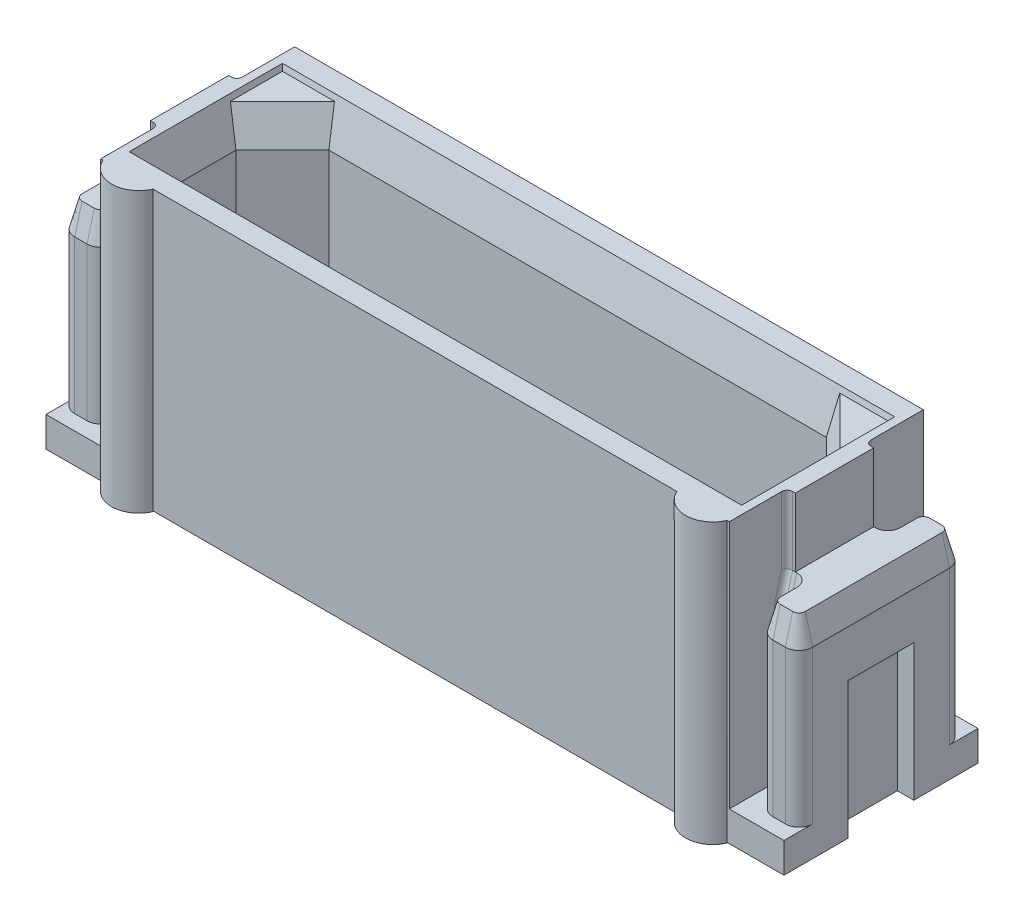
ISO-10303-21;
HEADER;
FILE_DESCRIPTION(('STEP AP214'),'2;1');
FILE_NAME('part.step','',(''),(''),'','','');
FILE_SCHEMA(('AUTOMOTIVE_DESIGN { 1 0 10303 214 1 1 1 1 }'));
ENDSEC;
DATA;
#1=APPLICATION_CONTEXT('core data for automotive mechanical design processes');
#2=APPLICATION_PROTOCOL_DEFINITION('international standard','automotive_design',2000,#1);
#3=PRODUCT_CONTEXT('',#1,'mechanical');
#4=PRODUCT('Part','Part','',(#3));
#5=PRODUCT_RELATED_PRODUCT_CATEGORY('part','',(#4));
#6=PRODUCT_DEFINITION_FORMATION('','',#4);
#7=PRODUCT_DEFINITION_CONTEXT('part definition',#1,'design');
#8=PRODUCT_DEFINITION('design','',#6,#7);
#9=PRODUCT_DEFINITION_SHAPE('','',#8);
#10=(LENGTH_UNIT() NAMED_UNIT(*) SI_UNIT(.MILLI.,.METRE.));
#11=(NAMED_UNIT(*) PLANE_ANGLE_UNIT() SI_UNIT($,.RADIAN.));
#12=(NAMED_UNIT(*) SI_UNIT($,.STERADIAN.) SOLID_ANGLE_UNIT());
#13=UNCERTAINTY_MEASURE_WITH_UNIT(LENGTH_MEASURE(1.E-05),#10,'distance_accuracy_value','');
#14=(GEOMETRIC_REPRESENTATION_CONTEXT(3) GLOBAL_UNCERTAINTY_ASSIGNED_CONTEXT((#13)) GLOBAL_UNIT_ASSIGNED_CONTEXT((#10,
#11,#12)) REPRESENTATION_CONTEXT('',''));
#15=CARTESIAN_POINT('',(0.,0.,0.));
#16=DIRECTION('',(0.,0.,1.));
#17=DIRECTION('',(1.,0.,0.));
#18=AXIS2_PLACEMENT_3D('',#15,#16,#17);
#19=CARTESIAN_POINT('',(-5.881950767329,3.85,1.420666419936));
#20=DIRECTION('',(0.,-1.,0.));
#21=DIRECTION('',(-1.,0.,0.));
#22=AXIS2_PLACEMENT_3D('',#19,#20,#21);
#23=PLANE('',#22);
#24=CARTESIAN_POINT('',(-5.925,3.84999999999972,-0.95));
#25=DIRECTION('',(0.,1.,0.));
#26=DIRECTION('',(0.,0.,1.));
#27=AXIS2_PLACEMENT_3D('',#24,#25,#26);
#28=CIRCLE('',#27,0.233974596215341);
#29=CARTESIAN_POINT('',(-6.15897459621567,3.84999999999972,-0.950000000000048));
#30=VERTEX_POINT('',#29);
#31=CARTESIAN_POINT('',(-5.92500000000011,3.84999999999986,-0.716025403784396));
#32=VERTEX_POINT('',#31);
#33=EDGE_CURVE('E1407',#30,#32,#28,.T.);
#34=ORIENTED_EDGE('',*,*,#33,.F.);
#35=DIRECTION('',(0.,0.,1.));
#36=VECTOR('',#35,1.);
#37=CARTESIAN_POINT('',(-6.158974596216,3.85,0.));
#38=LINE('',#37,#36);
#39=CARTESIAN_POINT('',(-6.15897459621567,3.84999999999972,-1.25000000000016));
#40=VERTEX_POINT('',#39);
#41=EDGE_CURVE('E1410',#40,#30,#38,.T.);
#42=ORIENTED_EDGE('',*,*,#41,.F.);
#43=CARTESIAN_POINT('',(-6.275,3.84999999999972,-1.25));
#44=DIRECTION('',(0.,-1.,0.));
#45=DIRECTION('',(0.,0.,-1.));
#46=AXIS2_PLACEMENT_3D('',#43,#44,#45);
#47=CIRCLE('',#46,0.116025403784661);
#48=CARTESIAN_POINT('',(-6.27499999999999,3.84999999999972,-1.36602540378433));
#49=VERTEX_POINT('',#48);
#50=EDGE_CURVE('E1413',#49,#40,#47,.T.);
#51=ORIENTED_EDGE('',*,*,#50,.F.);
#52=DIRECTION('',(1.,0.,0.));
#53=VECTOR('',#52,1.);
#54=CARTESIAN_POINT('',(-6.258012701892,3.85,-1.366025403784));
#55=LINE('',#54,#53);
#56=CARTESIAN_POINT('',(-6.50000000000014,3.84999999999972,-1.36602540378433));
#57=VERTEX_POINT('',#56);
#58=EDGE_CURVE('E1414',#57,#49,#55,.T.);
#59=ORIENTED_EDGE('',*,*,#58,.F.);
#60=CARTESIAN_POINT('',(-6.5,3.84999999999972,-1.25));
#61=DIRECTION('',(0.,-1.,0.));
#62=DIRECTION('',(0.,0.,-1.));
#63=AXIS2_PLACEMENT_3D('',#60,#61,#62);
#64=CIRCLE('',#63,0.11602540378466);
#65=CARTESIAN_POINT('',(-6.61602540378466,3.84999999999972,-1.25));
#66=VERTEX_POINT('',#65);
#67=EDGE_CURVE('E1417',#66,#57,#64,.T.);
#68=ORIENTED_EDGE('',*,*,#67,.F.);
#69=DIRECTION('',(0.,0.,1.));
#70=VECTOR('',#69,1.);
#71=CARTESIAN_POINT('',(-6.61602540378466,3.84999999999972,0.));
#72=LINE('',#71,#70);
#73=CARTESIAN_POINT('',(-6.61602540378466,3.84999999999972,1.25));
#74=VERTEX_POINT('',#73);
#75=EDGE_CURVE('E1277',#66,#74,#72,.T.);
#76=ORIENTED_EDGE('',*,*,#75,.T.);
#77=CARTESIAN_POINT('',(-6.5,3.84999999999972,1.25));
#78=DIRECTION('',(0.,-1.,0.));
#79=DIRECTION('',(0.,0.,-1.));
#80=AXIS2_PLACEMENT_3D('',#77,#78,#79);
#81=CIRCLE('',#80,0.11602540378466);
#82=CARTESIAN_POINT('',(-6.50000000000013,3.84999999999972,1.36602540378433));
#83=VERTEX_POINT('',#82);
#84=EDGE_CURVE('E1421',#83,#74,#81,.T.);
#85=ORIENTED_EDGE('',*,*,#84,.F.);
#86=DIRECTION('',(-1.,0.,0.));
#87=VECTOR('',#86,1.);
#88=CARTESIAN_POINT('',(-6.258012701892,3.85,1.366025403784));
#89=LINE('',#88,#87);
#90=CARTESIAN_POINT('',(-6.27500000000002,3.84999999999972,1.36602540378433));
#91=VERTEX_POINT('',#90);
#92=EDGE_CURVE('E1418',#91,#83,#89,.T.);
#93=ORIENTED_EDGE('',*,*,#92,.F.);
#94=CARTESIAN_POINT('',(-6.275,3.84999999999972,1.25));
#95=DIRECTION('',(0.,-1.,0.));
#96=DIRECTION('',(0.,0.,-1.));
#97=AXIS2_PLACEMENT_3D('',#94,#95,#96);
#98=CIRCLE('',#97,0.116025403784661);
#99=CARTESIAN_POINT('',(-6.15897459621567,3.84999999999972,1.25000000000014));
#100=VERTEX_POINT('',#99);
#101=EDGE_CURVE('E1422',#100,#91,#98,.T.);
#102=ORIENTED_EDGE('',*,*,#101,.F.);
#103=DIRECTION('',(0.,0.,1.));
#104=VECTOR('',#103,1.);
#105=CARTESIAN_POINT('',(-6.158974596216,3.85,0.));
#106=LINE('',#105,#104);
#107=CARTESIAN_POINT('',(-6.15897459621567,3.84999999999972,0.95));
#108=VERTEX_POINT('',#107);
#109=EDGE_CURVE('E1423',#108,#100,#106,.T.);
#110=ORIENTED_EDGE('',*,*,#109,.F.);
#111=CARTESIAN_POINT('',(-5.925,3.84999999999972,0.95));
#112=DIRECTION('',(0.,1.,0.));
#113=DIRECTION('',(0.,0.,1.));
#114=AXIS2_PLACEMENT_3D('',#111,#112,#113);
#115=CIRCLE('',#114,0.233974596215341);
#116=CARTESIAN_POINT('',(-5.9250000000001,3.84999999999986,0.716025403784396));
#117=VERTEX_POINT('',#116);
#118=EDGE_CURVE('E21',#117,#108,#115,.T.);
#119=ORIENTED_EDGE('',*,*,#118,.F.);
#120=DIRECTION('',(-1.,0.,0.));
#121=VECTOR('',#120,1.);
#122=CARTESIAN_POINT('',(-6.258012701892,3.85,0.7160254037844));
#123=LINE('',#122,#121);
#124=CARTESIAN_POINT('',(-5.90000000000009,3.85,0.7160254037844));
#125=VERTEX_POINT('',#124);
#126=EDGE_CURVE('E432',#125,#117,#123,.T.);
#127=ORIENTED_EDGE('',*,*,#126,.F.);
#128=DIRECTION('',(0.,0.,1.));
#129=VECTOR('',#128,1.);
#130=CARTESIAN_POINT('',(-5.9,3.85,0.));
#131=LINE('',#130,#129);
#132=CARTESIAN_POINT('',(-5.9,3.85,-0.716025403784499));
#133=VERTEX_POINT('',#132);
#134=EDGE_CURVE('E1427',#133,#125,#131,.T.);
#135=ORIENTED_EDGE('',*,*,#134,.F.);
#136=DIRECTION('',(1.,0.,0.));
#137=VECTOR('',#136,1.);
#138=CARTESIAN_POINT('',(-6.258012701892,3.85,-0.7160254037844));
#139=LINE('',#138,#137);
#140=EDGE_CURVE('E1390',#32,#133,#139,.T.);
#141=ORIENTED_EDGE('',*,*,#140,.F.);
#142=EDGE_LOOP('',(#34,#42,#51,#59,#68,#76,#85,#93,#102,#110,#119,#127,#135,#141));
#143=FACE_BOUND('',#142,.T.);
#144=ADVANCED_FACE('F17',(#143),#23,.F.);
#145=CARTESIAN_POINT('',(-6.45,2.601,-0.624));
#146=DIRECTION('',(-1.,0.,0.));
#147=DIRECTION('',(0.,-1.,0.));
#148=AXIS2_PLACEMENT_3D('',#145,#146,#147);
#149=PLANE('',#148);
#150=DIRECTION('',(0.,0.,1.));
#151=VECTOR('',#150,1.);
#152=CARTESIAN_POINT('',(-6.45000000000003,2.55000000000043,0.));
#153=LINE('',#152,#151);
#154=CARTESIAN_POINT('',(-6.45000000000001,2.55000000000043,-0.6));
#155=VERTEX_POINT('',#154);
#156=CARTESIAN_POINT('',(-6.45000000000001,2.55000000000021,0.6));
#157=VERTEX_POINT('',#156);
#158=EDGE_CURVE('E1298',#155,#157,#153,.T.);
#159=ORIENTED_EDGE('',*,*,#158,.F.);
#160=DIRECTION('',(0.,-1.,0.));
#161=VECTOR('',#160,1.);
#162=CARTESIAN_POINT('',(-6.45,1.275,-0.6));
#163=LINE('',#162,#161);
#164=CARTESIAN_POINT('',(-6.45,0.,-0.6));
#165=VERTEX_POINT('',#164);
#166=EDGE_CURVE('E1404',#155,#165,#163,.T.);
#167=ORIENTED_EDGE('',*,*,#166,.T.);
#168=DIRECTION('',(0.,0.,1.));
#169=VECTOR('',#168,1.);
#170=CARTESIAN_POINT('',(-6.45,0.,0.));
#171=LINE('',#170,#169);
#172=CARTESIAN_POINT('',(-6.45,0.,0.6));
#173=VERTEX_POINT('',#172);
#174=EDGE_CURVE('E1388',#165,#173,#171,.T.);
#175=ORIENTED_EDGE('',*,*,#174,.T.);
#176=DIRECTION('',(0.,-1.,0.));
#177=VECTOR('',#176,1.);
#178=CARTESIAN_POINT('',(-6.45,1.275,0.6));
#179=LINE('',#178,#177);
#180=EDGE_CURVE('E1251',#157,#173,#179,.T.);
#181=ORIENTED_EDGE('',*,*,#180,.F.);
#182=EDGE_LOOP('',(#159,#167,#175,#181));
#183=FACE_BOUND('',#182,.T.);
#184=ADVANCED_FACE('F2117',(#183),#149,.T.);
#185=CARTESIAN_POINT('',(5.881950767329,3.85,1.420666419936));
#186=DIRECTION('',(0.,1.,0.));
#187=DIRECTION('',(1.,0.,0.));
#188=AXIS2_PLACEMENT_3D('',#185,#186,#187);
#189=PLANE('',#188);
#190=CARTESIAN_POINT('',(5.925,3.84999999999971,-0.95));
#191=DIRECTION('',(0.,1.,0.));
#192=DIRECTION('',(0.,0.,1.));
#193=AXIS2_PLACEMENT_3D('',#190,#191,#192);
#194=CIRCLE('',#193,0.233974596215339);
#195=CARTESIAN_POINT('',(6.15897459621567,3.84999999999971,-0.950000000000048));
#196=VERTEX_POINT('',#195);
#197=CARTESIAN_POINT('',(5.92500000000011,3.84999999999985,-0.716025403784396));
#198=VERTEX_POINT('',#197);
#199=EDGE_CURVE('E1358',#196,#198,#194,.F.);
#200=ORIENTED_EDGE('',*,*,#199,.T.);
#201=DIRECTION('',(-1.,0.,0.));
#202=VECTOR('',#201,1.);
#203=CARTESIAN_POINT('',(6.258012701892,3.85,-0.7160254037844));
#204=LINE('',#203,#202);
#205=CARTESIAN_POINT('',(5.9000000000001,3.85,-0.7160254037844));
#206=VERTEX_POINT('',#205);
#207=EDGE_CURVE('E1344',#198,#206,#204,.T.);
#208=ORIENTED_EDGE('',*,*,#207,.T.);
#209=DIRECTION('',(0.,0.,1.));
#210=VECTOR('',#209,1.);
#211=CARTESIAN_POINT('',(5.9,3.85,0.));
#212=LINE('',#211,#210);
#213=CARTESIAN_POINT('',(5.9,3.85,0.716025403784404));
#214=VERTEX_POINT('',#213);
#215=EDGE_CURVE('E1376',#206,#214,#212,.T.);
#216=ORIENTED_EDGE('',*,*,#215,.T.);
#217=DIRECTION('',(1.,0.,0.));
#218=VECTOR('',#217,1.);
#219=CARTESIAN_POINT('',(6.258012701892,3.85,0.7160254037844));
#220=LINE('',#219,#218);
#221=CARTESIAN_POINT('',(5.9250000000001,3.84999999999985,0.716025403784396));
#222=VERTEX_POINT('',#221);
#223=EDGE_CURVE('E1374',#214,#222,#220,.T.);
#224=ORIENTED_EDGE('',*,*,#223,.T.);
#225=CARTESIAN_POINT('',(5.925,3.84999999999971,0.95));
#226=DIRECTION('',(0.,1.,0.));
#227=DIRECTION('',(0.,0.,1.));
#228=AXIS2_PLACEMENT_3D('',#225,#226,#227);
#229=CIRCLE('',#228,0.233974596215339);
#230=CARTESIAN_POINT('',(6.15897459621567,3.84999999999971,0.95));
#231=VERTEX_POINT('',#230);
#232=EDGE_CURVE('E1373',#222,#231,#229,.F.);
#233=ORIENTED_EDGE('',*,*,#232,.T.);
#234=DIRECTION('',(0.,0.,1.));
#235=VECTOR('',#234,1.);
#236=CARTESIAN_POINT('',(6.158974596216,3.85,0.));
#237=LINE('',#236,#235);
#238=CARTESIAN_POINT('',(6.15897459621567,3.84999999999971,1.25000000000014));
#239=VERTEX_POINT('',#238);
#240=EDGE_CURVE('E1371',#231,#239,#237,.T.);
#241=ORIENTED_EDGE('',*,*,#240,.T.);
#242=CARTESIAN_POINT('',(6.275,3.84999999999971,1.25));
#243=DIRECTION('',(0.,-1.,0.));
#244=DIRECTION('',(0.,0.,-1.));
#245=AXIS2_PLACEMENT_3D('',#242,#243,#244);
#246=CIRCLE('',#245,0.116025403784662);
#247=CARTESIAN_POINT('',(6.27500000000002,3.84999999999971,1.36602540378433));
#248=VERTEX_POINT('',#247);
#249=EDGE_CURVE('E1370',#239,#248,#246,.F.);
#250=ORIENTED_EDGE('',*,*,#249,.T.);
#251=DIRECTION('',(1.,0.,0.));
#252=VECTOR('',#251,1.);
#253=CARTESIAN_POINT('',(6.258012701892,3.85,1.366025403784));
#254=LINE('',#253,#252);
#255=CARTESIAN_POINT('',(6.50000000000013,3.84999999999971,1.36602540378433));
#256=VERTEX_POINT('',#255);
#257=EDGE_CURVE('E1367',#248,#256,#254,.T.);
#258=ORIENTED_EDGE('',*,*,#257,.T.);
#259=CARTESIAN_POINT('',(6.5,3.84999999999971,1.25));
#260=DIRECTION('',(0.,-1.,0.));
#261=DIRECTION('',(0.,0.,-1.));
#262=AXIS2_PLACEMENT_3D('',#259,#260,#261);
#263=CIRCLE('',#262,0.116025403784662);
#264=CARTESIAN_POINT('',(6.61602540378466,3.84999999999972,1.25));
#265=VERTEX_POINT('',#264);
#266=EDGE_CURVE('E1369',#256,#265,#263,.F.);
#267=ORIENTED_EDGE('',*,*,#266,.T.);
#268=DIRECTION('',(0.,0.,-1.));
#269=VECTOR('',#268,1.);
#270=CARTESIAN_POINT('',(6.61602540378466,3.84999999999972,0.));
#271=LINE('',#270,#269);
#272=CARTESIAN_POINT('',(6.61602540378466,3.84999999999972,-1.25));
#273=VERTEX_POINT('',#272);
#274=EDGE_CURVE('E1205',#265,#273,#271,.T.);
#275=ORIENTED_EDGE('',*,*,#274,.T.);
#276=CARTESIAN_POINT('',(6.5,3.84999999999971,-1.25));
#277=DIRECTION('',(0.,-1.,0.));
#278=DIRECTION('',(0.,0.,-1.));
#279=AXIS2_PLACEMENT_3D('',#276,#277,#278);
#280=CIRCLE('',#279,0.116025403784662);
#281=CARTESIAN_POINT('',(6.50000000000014,3.84999999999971,-1.36602540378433));
#282=VERTEX_POINT('',#281);
#283=EDGE_CURVE('E1366',#273,#282,#280,.F.);
#284=ORIENTED_EDGE('',*,*,#283,.T.);
#285=DIRECTION('',(-1.,0.,0.));
#286=VECTOR('',#285,1.);
#287=CARTESIAN_POINT('',(6.258012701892,3.85,-1.366025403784));
#288=LINE('',#287,#286);
#289=CARTESIAN_POINT('',(6.27499999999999,3.84999999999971,-1.36602540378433));
#290=VERTEX_POINT('',#289);
#291=EDGE_CURVE('E1364',#282,#290,#288,.T.);
#292=ORIENTED_EDGE('',*,*,#291,.T.);
#293=CARTESIAN_POINT('',(6.275,3.84999999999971,-1.25));
#294=DIRECTION('',(0.,-1.,0.));
#295=DIRECTION('',(0.,0.,-1.));
#296=AXIS2_PLACEMENT_3D('',#293,#294,#295);
#297=CIRCLE('',#296,0.116025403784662);
#298=CARTESIAN_POINT('',(6.15897459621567,3.84999999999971,-1.25000000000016));
#299=VERTEX_POINT('',#298);
#300=EDGE_CURVE('E1363',#290,#299,#297,.F.);
#301=ORIENTED_EDGE('',*,*,#300,.T.);
#302=DIRECTION('',(0.,0.,1.));
#303=VECTOR('',#302,1.);
#304=CARTESIAN_POINT('',(6.158974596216,3.85,0.));
#305=LINE('',#304,#303);
#306=EDGE_CURVE('E1361',#299,#196,#305,.T.);
#307=ORIENTED_EDGE('',*,*,#306,.T.);
#308=EDGE_LOOP('',(#200,#208,#216,#224,#233,#241,#250,#258,#267,#275,#284,#292,#301,#307));
#309=FACE_BOUND('',#308,.T.);
#310=ADVANCED_FACE('F2120',(#309),#189,.T.);
#311=CARTESIAN_POINT('',(6.45,2.601,-0.624));
#312=DIRECTION('',(-1.,0.,0.));
#313=DIRECTION('',(0.,-1.,0.));
#314=AXIS2_PLACEMENT_3D('',#311,#312,#313);
#315=PLANE('',#314);
#316=DIRECTION('',(0.,0.,1.));
#317=VECTOR('',#316,1.);
#318=CARTESIAN_POINT('',(6.45000000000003,2.55000000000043,0.));
#319=LINE('',#318,#317);
#320=CARTESIAN_POINT('',(6.45000000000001,2.55000000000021,-0.6));
#321=VERTEX_POINT('',#320);
#322=CARTESIAN_POINT('',(6.45000000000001,2.55000000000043,0.6));
#323=VERTEX_POINT('',#322);
#324=EDGE_CURVE('E1250',#321,#323,#319,.T.);
#325=ORIENTED_EDGE('',*,*,#324,.T.);
#326=DIRECTION('',(0.,-1.,0.));
#327=VECTOR('',#326,1.);
#328=CARTESIAN_POINT('',(6.45,1.275,0.6));
#329=LINE('',#328,#327);
#330=CARTESIAN_POINT('',(6.45,0.,0.6));
#331=VERTEX_POINT('',#330);
#332=EDGE_CURVE('E1337',#323,#331,#329,.T.);
#333=ORIENTED_EDGE('',*,*,#332,.T.);
#334=DIRECTION('',(0.,0.,1.));
#335=VECTOR('',#334,1.);
#336=CARTESIAN_POINT('',(6.45,0.,0.));
#337=LINE('',#336,#335);
#338=CARTESIAN_POINT('',(6.45,0.,-0.6));
#339=VERTEX_POINT('',#338);
#340=EDGE_CURVE('E1334',#339,#331,#337,.T.);
#341=ORIENTED_EDGE('',*,*,#340,.F.);
#342=DIRECTION('',(0.,-1.,0.));
#343=VECTOR('',#342,1.);
#344=CARTESIAN_POINT('',(6.45,1.275,-0.6));
#345=LINE('',#344,#343);
#346=EDGE_CURVE('E1228',#321,#339,#345,.T.);
#347=ORIENTED_EDGE('',*,*,#346,.F.);
#348=EDGE_LOOP('',(#325,#333,#341,#347));
#349=FACE_BOUND('',#348,.T.);
#350=ADVANCED_FACE('F2124',(#349),#315,.F.);
#351=CARTESIAN_POINT('',(-6.256950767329,0.494,1.5));
#352=DIRECTION('',(0.,0.,-1.));
#353=DIRECTION('',(-1.,0.,0.));
#354=AXIS2_PLACEMENT_3D('',#351,#352,#353);
#355=PLANE('',#354);
#356=DIRECTION('',(1.,0.,0.));
#357=VECTOR('',#356,1.);
#358=CARTESIAN_POINT('',(-6.3875,3.35,1.5));
#359=LINE('',#358,#357);
#360=CARTESIAN_POINT('',(-6.50000000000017,3.35000000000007,1.50000000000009));
#361=VERTEX_POINT('',#360);
#362=CARTESIAN_POINT('',(-6.27499999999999,3.35000000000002,1.5000000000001));
#363=VERTEX_POINT('',#362);
#364=EDGE_CURVE('E1318',#361,#363,#359,.T.);
#365=ORIENTED_EDGE('',*,*,#364,.F.);
#366=DIRECTION('',(0.,-1.,0.));
#367=VECTOR('',#366,1.);
#368=CARTESIAN_POINT('',(-6.50000000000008,1.95,1.5));
#369=LINE('',#368,#367);
#370=CARTESIAN_POINT('',(-6.50000000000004,0.550000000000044,1.5));
#371=VERTEX_POINT('',#370);
#372=EDGE_CURVE('E1265',#361,#371,#369,.T.);
#373=ORIENTED_EDGE('',*,*,#372,.T.);
#374=DIRECTION('',(-1.,0.,0.));
#375=VECTOR('',#374,1.);
#376=CARTESIAN_POINT('',(-6.3875,0.55,1.5));
#377=LINE('',#376,#375);
#378=CARTESIAN_POINT('',(-6.27500000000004,0.550000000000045,1.5));
#379=VERTEX_POINT('',#378);
#380=EDGE_CURVE('E1329',#379,#371,#377,.T.);
#381=ORIENTED_EDGE('',*,*,#380,.F.);
#382=DIRECTION('',(0.,1.,0.));
#383=VECTOR('',#382,1.);
#384=CARTESIAN_POINT('',(-6.27500000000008,1.95,1.5));
#385=LINE('',#384,#383);
#386=EDGE_CURVE('E1167',#379,#363,#385,.T.);
#387=ORIENTED_EDGE('',*,*,#386,.T.);
#388=EDGE_LOOP('',(#365,#373,#381,#387));
#389=FACE_BOUND('',#388,.T.);
#390=ADVANCED_FACE('F1693',(#389),#355,.F.);
#391=CARTESIAN_POINT('',(6.256950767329,0.494,1.5));
#392=DIRECTION('',(0.,0.,1.));
#393=DIRECTION('',(1.,0.,0.));
#394=AXIS2_PLACEMENT_3D('',#391,#392,#393);
#395=PLANE('',#394);
#396=DIRECTION('',(-1.,0.,0.));
#397=VECTOR('',#396,1.);
#398=CARTESIAN_POINT('',(6.3875,3.35,1.5));
#399=LINE('',#398,#397);
#400=CARTESIAN_POINT('',(6.50000000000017,3.35000000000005,1.50000000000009));
#401=VERTEX_POINT('',#400);
#402=CARTESIAN_POINT('',(6.27500000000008,3.34999999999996,1.5000000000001));
#403=VERTEX_POINT('',#402);
#404=EDGE_CURVE('E1312',#401,#403,#399,.T.);
#405=ORIENTED_EDGE('',*,*,#404,.T.);
#406=DIRECTION('',(0.,-1.,0.));
#407=VECTOR('',#406,1.);
#408=CARTESIAN_POINT('',(6.27500000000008,1.95,1.5));
#409=LINE('',#408,#407);
#410=CARTESIAN_POINT('',(6.27500000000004,0.550000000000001,1.5));
#411=VERTEX_POINT('',#410);
#412=EDGE_CURVE('E1153',#403,#411,#409,.T.);
#413=ORIENTED_EDGE('',*,*,#412,.T.);
#414=DIRECTION('',(1.,0.,0.));
#415=VECTOR('',#414,1.);
#416=CARTESIAN_POINT('',(6.3875,0.55,1.5));
#417=LINE('',#416,#415);
#418=CARTESIAN_POINT('',(6.50000000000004,0.550000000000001,1.5));
#419=VERTEX_POINT('',#418);
#420=EDGE_CURVE('E1314',#411,#419,#417,.T.);
#421=ORIENTED_EDGE('',*,*,#420,.T.);
#422=DIRECTION('',(0.,1.,0.));
#423=VECTOR('',#422,1.);
#424=CARTESIAN_POINT('',(6.50000000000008,1.95,1.5));
#425=LINE('',#424,#423);
#426=EDGE_CURVE('E1199',#419,#401,#425,.T.);
#427=ORIENTED_EDGE('',*,*,#426,.T.);
#428=EDGE_LOOP('',(#405,#413,#421,#427));
#429=FACE_BOUND('',#428,.T.);
#430=ADVANCED_FACE('F2131',(#429),#395,.T.);
#431=CARTESIAN_POINT('',(-6.76777502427,2.493967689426,-0.624));
#432=DIRECTION('',(0.173648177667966,-0.984807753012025,0.));
#433=DIRECTION('',(0.984807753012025,0.173648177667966,0.));
#434=AXIS2_PLACEMENT_3D('',#431,#432,#433);
#435=PLANE('',#434);
#436=ORIENTED_EDGE('',*,*,#158,.T.);
#437=DIRECTION('',(0.98480775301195,0.173648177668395,0.));
#438=VECTOR('',#437,1.);
#439=CARTESIAN_POINT('',(-6.75,2.497101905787,0.6));
#440=LINE('',#439,#438);
#441=CARTESIAN_POINT('',(-6.75,2.497101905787,0.6));
#442=VERTEX_POINT('',#441);
#443=EDGE_CURVE('E1385',#442,#157,#440,.T.);
#444=ORIENTED_EDGE('',*,*,#443,.F.);
#445=DIRECTION('',(0.,0.,-1.));
#446=VECTOR('',#445,1.);
#447=CARTESIAN_POINT('',(-6.75,2.497101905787,0.));
#448=LINE('',#447,#446);
#449=CARTESIAN_POINT('',(-6.75,2.49710190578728,-0.6));
#450=VERTEX_POINT('',#449);
#451=EDGE_CURVE('E1292',#442,#450,#448,.T.);
#452=ORIENTED_EDGE('',*,*,#451,.T.);
#453=DIRECTION('',(0.984807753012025,0.173648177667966,0.));
#454=VECTOR('',#453,1.);
#455=CARTESIAN_POINT('',(-6.76777502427,2.493967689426,-0.6));
#456=LINE('',#455,#454);
#457=EDGE_CURVE('E1297',#450,#155,#456,.T.);
#458=ORIENTED_EDGE('',*,*,#457,.T.);
#459=EDGE_LOOP('',(#436,#444,#452,#458));
#460=FACE_BOUND('',#459,.T.);
#461=ADVANCED_FACE('F1877',(#460),#435,.T.);
#462=CARTESIAN_POINT('',(-6.431950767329,-0.051,-0.6));
#463=DIRECTION('',(0.,0.,-1.));
#464=DIRECTION('',(-1.,0.,0.));
#465=AXIS2_PLACEMENT_3D('',#462,#463,#464);
#466=PLANE('',#465);
#467=ORIENTED_EDGE('',*,*,#457,.F.);
#468=DIRECTION('',(0.,-1.,0.));
#469=VECTOR('',#468,1.);
#470=CARTESIAN_POINT('',(-6.75,1.675,-0.599999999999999));
#471=LINE('',#470,#469);
#472=CARTESIAN_POINT('',(-6.75,0.,-0.6));
#473=VERTEX_POINT('',#472);
#474=EDGE_CURVE('E1287',#450,#473,#471,.T.);
#475=ORIENTED_EDGE('',*,*,#474,.T.);
#476=DIRECTION('',(-1.,0.,0.));
#477=VECTOR('',#476,1.);
#478=CARTESIAN_POINT('',(-6.6,0.,-0.6));
#479=LINE('',#478,#477);
#480=EDGE_CURVE('E1295',#165,#473,#479,.T.);
#481=ORIENTED_EDGE('',*,*,#480,.F.);
#482=ORIENTED_EDGE('',*,*,#166,.F.);
#483=EDGE_LOOP('',(#467,#475,#481,#482));
#484=FACE_BOUND('',#483,.T.);
#485=ADVANCED_FACE('F1874',(#484),#466,.F.);
#486=CARTESIAN_POINT('',(-6.61135391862,3.867434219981,-1.3));
#487=DIRECTION('',(0.965925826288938,-0.258819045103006,0.));
#488=DIRECTION('',(0.,0.,1.));
#489=AXIS2_PLACEMENT_3D('',#486,#487,#488);
#490=PLANE('',#489);
#491=DIRECTION('',(0.,0.,1.));
#492=VECTOR('',#491,1.);
#493=CARTESIAN_POINT('',(-6.75,3.35,0.));
#494=LINE('',#493,#492);
#495=CARTESIAN_POINT('',(-6.75000000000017,3.35000000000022,-1.25));
#496=VERTEX_POINT('',#495);
#497=CARTESIAN_POINT('',(-6.75000000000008,3.35000000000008,1.25));
#498=VERTEX_POINT('',#497);
#499=EDGE_CURVE('E1130',#496,#498,#494,.T.);
#500=ORIENTED_EDGE('',*,*,#499,.T.);
#501=DIRECTION('',(-0.258819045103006,-0.965925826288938,0.));
#502=VECTOR('',#501,1.);
#503=CARTESIAN_POINT('',(-6.6830127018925,3.6,1.25));
#504=LINE('',#503,#502);
#505=EDGE_CURVE('E1272',#74,#498,#504,.T.);
#506=ORIENTED_EDGE('',*,*,#505,.F.);
#507=ORIENTED_EDGE('',*,*,#75,.F.);
#508=DIRECTION('',(0.258819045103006,0.965925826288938,0.));
#509=VECTOR('',#508,1.);
#510=CARTESIAN_POINT('',(-6.6830127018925,3.6,-1.25));
#511=LINE('',#510,#509);
#512=EDGE_CURVE('E1269',#496,#66,#511,.T.);
#513=ORIENTED_EDGE('',*,*,#512,.F.);
#514=EDGE_LOOP('',(#500,#506,#507,#513));
#515=FACE_BOUND('',#514,.T.);
#516=ADVANCED_FACE('F1682',(#515),#490,.F.);
#517=CARTESIAN_POINT('',(-6.5,3.35,1.25));
#518=DIRECTION('',(0.,-1.,0.));
#519=DIRECTION('',(0.,0.,-1.));
#520=AXIS2_PLACEMENT_3D('',#517,#518,#519);
#521=CYLINDRICAL_SURFACE('',#520,0.249999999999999);
#522=CARTESIAN_POINT('',(-6.5,3.35,1.25));
#523=DIRECTION('',(0.,-1.,0.));
#524=DIRECTION('',(-1.,0.,0.));
#525=AXIS2_PLACEMENT_3D('',#522,#523,#524);
#526=CIRCLE('',#525,0.249999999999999);
#527=EDGE_CURVE('E1262',#498,#361,#526,.F.);
#528=ORIENTED_EDGE('',*,*,#527,.F.);
#529=DIRECTION('',(0.,-1.,0.));
#530=VECTOR('',#529,1.);
#531=CARTESIAN_POINT('',(-6.75,1.675,1.25));
#532=LINE('',#531,#530);
#533=CARTESIAN_POINT('',(-6.75,0.550000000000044,1.25));
#534=VERTEX_POINT('',#533);
#535=EDGE_CURVE('E1133',#498,#534,#532,.T.);
#536=ORIENTED_EDGE('',*,*,#535,.T.);
#537=CARTESIAN_POINT('',(-6.5,0.550000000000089,1.25));
#538=DIRECTION('',(0.,-1.,0.));
#539=DIRECTION('',(0.,0.,-1.));
#540=AXIS2_PLACEMENT_3D('',#537,#538,#539);
#541=CIRCLE('',#540,0.249999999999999);
#542=EDGE_CURVE('E1266',#371,#534,#541,.T.);
#543=ORIENTED_EDGE('',*,*,#542,.F.);
#544=ORIENTED_EDGE('',*,*,#372,.F.);
#545=EDGE_LOOP('',(#528,#536,#543,#544));
#546=FACE_BOUND('',#545,.T.);
#547=ADVANCED_FACE('F1692',(#546),#521,.T.);
#548=CARTESIAN_POINT('',(-6.431950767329,-0.051,0.6));
#549=DIRECTION('',(0.,0.,-1.));
#550=DIRECTION('',(-1.,0.,0.));
#551=AXIS2_PLACEMENT_3D('',#548,#549,#550);
#552=PLANE('',#551);
#553=ORIENTED_EDGE('',*,*,#180,.T.);
#554=DIRECTION('',(-1.,0.,0.));
#555=VECTOR('',#554,1.);
#556=CARTESIAN_POINT('',(-6.6,0.,0.6));
#557=LINE('',#556,#555);
#558=CARTESIAN_POINT('',(-6.75,0.,0.6));
#559=VERTEX_POINT('',#558);
#560=EDGE_CURVE('E1248',#173,#559,#557,.T.);
#561=ORIENTED_EDGE('',*,*,#560,.T.);
#562=DIRECTION('',(0.,1.,0.));
#563=VECTOR('',#562,1.);
#564=CARTESIAN_POINT('',(-6.75,1.675,0.6));
#565=LINE('',#564,#563);
#566=EDGE_CURVE('E1232',#559,#442,#565,.T.);
#567=ORIENTED_EDGE('',*,*,#566,.T.);
#568=ORIENTED_EDGE('',*,*,#443,.T.);
#569=EDGE_LOOP('',(#553,#561,#567,#568));
#570=FACE_BOUND('',#569,.T.);
#571=ADVANCED_FACE('F2114',(#570),#552,.T.);
#572=CARTESIAN_POINT('',(6.76777502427,2.493967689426,-0.624));
#573=DIRECTION('',(0.173648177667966,0.984807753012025,0.));
#574=DIRECTION('',(-0.984807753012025,0.173648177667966,0.));
#575=AXIS2_PLACEMENT_3D('',#572,#573,#574);
#576=PLANE('',#575);
#577=ORIENTED_EDGE('',*,*,#324,.F.);
#578=DIRECTION('',(-0.98480775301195,0.173648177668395,0.));
#579=VECTOR('',#578,1.);
#580=CARTESIAN_POINT('',(6.75,2.497101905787,-0.6));
#581=LINE('',#580,#579);
#582=CARTESIAN_POINT('',(6.75,2.497101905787,-0.6));
#583=VERTEX_POINT('',#582);
#584=EDGE_CURVE('E1336',#583,#321,#581,.T.);
#585=ORIENTED_EDGE('',*,*,#584,.F.);
#586=DIRECTION('',(0.,0.,-1.));
#587=VECTOR('',#586,1.);
#588=CARTESIAN_POINT('',(6.75,2.497101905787,0.));
#589=LINE('',#588,#587);
#590=CARTESIAN_POINT('',(6.75,2.49710190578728,0.6));
#591=VERTEX_POINT('',#590);
#592=EDGE_CURVE('E1223',#591,#583,#589,.T.);
#593=ORIENTED_EDGE('',*,*,#592,.F.);
#594=DIRECTION('',(-0.984807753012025,0.173648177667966,0.));
#595=VECTOR('',#594,1.);
#596=CARTESIAN_POINT('',(6.76777502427,2.493967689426,0.600000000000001));
#597=LINE('',#596,#595);
#598=EDGE_CURVE('E1182',#591,#323,#597,.T.);
#599=ORIENTED_EDGE('',*,*,#598,.T.);
#600=EDGE_LOOP('',(#577,#585,#593,#599));
#601=FACE_BOUND('',#600,.T.);
#602=ADVANCED_FACE('F2143',(#601),#576,.F.);
#603=CARTESIAN_POINT('',(6.431950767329,-0.051,-0.6));
#604=DIRECTION('',(0.,0.,1.));
#605=DIRECTION('',(1.,0.,0.));
#606=AXIS2_PLACEMENT_3D('',#603,#604,#605);
#607=PLANE('',#606);
#608=ORIENTED_EDGE('',*,*,#346,.T.);
#609=DIRECTION('',(1.,0.,0.));
#610=VECTOR('',#609,1.);
#611=CARTESIAN_POINT('',(6.6,0.,-0.6));
#612=LINE('',#611,#610);
#613=CARTESIAN_POINT('',(6.75,0.,-0.6));
#614=VERTEX_POINT('',#613);
#615=EDGE_CURVE('E1226',#339,#614,#612,.T.);
#616=ORIENTED_EDGE('',*,*,#615,.T.);
#617=DIRECTION('',(0.,-1.,0.));
#618=VECTOR('',#617,1.);
#619=CARTESIAN_POINT('',(6.75,1.675,-0.599999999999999));
#620=LINE('',#619,#618);
#621=EDGE_CURVE('E1218',#583,#614,#620,.T.);
#622=ORIENTED_EDGE('',*,*,#621,.F.);
#623=ORIENTED_EDGE('',*,*,#584,.T.);
#624=EDGE_LOOP('',(#608,#616,#622,#623));
#625=FACE_BOUND('',#624,.T.);
#626=ADVANCED_FACE('F2146',(#625),#607,.T.);
#627=CARTESIAN_POINT('',(6.61135391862,3.867434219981,1.3));
#628=DIRECTION('',(-0.965925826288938,-0.258819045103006,0.));
#629=DIRECTION('',(0.,0.,-1.));
#630=AXIS2_PLACEMENT_3D('',#627,#628,#629);
#631=PLANE('',#630);
#632=DIRECTION('',(0.,0.,1.));
#633=VECTOR('',#632,1.);
#634=CARTESIAN_POINT('',(6.75,3.35,0.));
#635=LINE('',#634,#633);
#636=CARTESIAN_POINT('',(6.75000000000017,3.35000000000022,-1.25));
#637=VERTEX_POINT('',#636);
#638=CARTESIAN_POINT('',(6.75000000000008,3.35000000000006,1.25));
#639=VERTEX_POINT('',#638);
#640=EDGE_CURVE('E1115',#637,#639,#635,.T.);
#641=ORIENTED_EDGE('',*,*,#640,.F.);
#642=DIRECTION('',(0.258819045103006,-0.965925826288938,0.));
#643=VECTOR('',#642,1.);
#644=CARTESIAN_POINT('',(6.6830127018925,3.6,-1.25));
#645=LINE('',#644,#643);
#646=EDGE_CURVE('E1202',#273,#637,#645,.T.);
#647=ORIENTED_EDGE('',*,*,#646,.F.);
#648=ORIENTED_EDGE('',*,*,#274,.F.);
#649=DIRECTION('',(-0.258819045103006,0.965925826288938,0.));
#650=VECTOR('',#649,1.);
#651=CARTESIAN_POINT('',(6.6830127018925,3.6,1.25));
#652=LINE('',#651,#650);
#653=EDGE_CURVE('E1204',#639,#265,#652,.T.);
#654=ORIENTED_EDGE('',*,*,#653,.F.);
#655=EDGE_LOOP('',(#641,#647,#648,#654));
#656=FACE_BOUND('',#655,.T.);
#657=ADVANCED_FACE('F2110',(#656),#631,.F.);
#658=CARTESIAN_POINT('',(6.5,0.550000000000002,1.25));
#659=DIRECTION('',(0.,1.,0.));
#660=DIRECTION('',(0.,0.,1.));
#661=AXIS2_PLACEMENT_3D('',#658,#659,#660);
#662=CYLINDRICAL_SURFACE('',#661,0.249999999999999);
#663=CARTESIAN_POINT('',(6.5,3.34999999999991,1.25));
#664=DIRECTION('',(0.,1.,0.));
#665=DIRECTION('',(1.,0.,0.));
#666=AXIS2_PLACEMENT_3D('',#663,#664,#665);
#667=CIRCLE('',#666,0.249999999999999);
#668=EDGE_CURVE('E1183',#401,#639,#667,.T.);
#669=ORIENTED_EDGE('',*,*,#668,.F.);
#670=ORIENTED_EDGE('',*,*,#426,.F.);
#671=CARTESIAN_POINT('',(6.5,0.550000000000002,1.25));
#672=DIRECTION('',(0.,1.,0.));
#673=DIRECTION('',(0.,0.,1.));
#674=AXIS2_PLACEMENT_3D('',#671,#672,#673);
#675=CIRCLE('',#674,0.249999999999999);
#676=CARTESIAN_POINT('',(6.75,0.550000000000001,1.25));
#677=VERTEX_POINT('',#676);
#678=EDGE_CURVE('E1210',#677,#419,#675,.F.);
#679=ORIENTED_EDGE('',*,*,#678,.F.);
#680=DIRECTION('',(0.,-1.,0.));
#681=VECTOR('',#680,1.);
#682=CARTESIAN_POINT('',(6.75,1.675,1.25));
#683=LINE('',#682,#681);
#684=EDGE_CURVE('E1118',#639,#677,#683,.T.);
#685=ORIENTED_EDGE('',*,*,#684,.F.);
#686=EDGE_LOOP('',(#669,#670,#679,#685));
#687=FACE_BOUND('',#686,.T.);
#688=ADVANCED_FACE('F2107',(#687),#662,.T.);
#689=CARTESIAN_POINT('',(6.431950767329,-0.051,0.6));
#690=DIRECTION('',(0.,0.,1.));
#691=DIRECTION('',(1.,0.,0.));
#692=AXIS2_PLACEMENT_3D('',#689,#690,#691);
#693=PLANE('',#692);
#694=ORIENTED_EDGE('',*,*,#598,.F.);
#695=DIRECTION('',(0.,1.,0.));
#696=VECTOR('',#695,1.);
#697=CARTESIAN_POINT('',(6.75,1.675,0.6));
#698=LINE('',#697,#696);
#699=CARTESIAN_POINT('',(6.75,0.,0.6));
#700=VERTEX_POINT('',#699);
#701=EDGE_CURVE('E1110',#700,#591,#698,.T.);
#702=ORIENTED_EDGE('',*,*,#701,.F.);
#703=DIRECTION('',(1.,0.,0.));
#704=VECTOR('',#703,1.);
#705=CARTESIAN_POINT('',(6.6,0.,0.6));
#706=LINE('',#705,#704);
#707=EDGE_CURVE('E1179',#331,#700,#706,.T.);
#708=ORIENTED_EDGE('',*,*,#707,.F.);
#709=ORIENTED_EDGE('',*,*,#332,.F.);
#710=EDGE_LOOP('',(#694,#702,#708,#709));
#711=FACE_BOUND('',#710,.T.);
#712=ADVANCED_FACE('F2106',(#711),#693,.F.);
#713=CARTESIAN_POINT('',(-6.275,3.35,1.25));
#714=DIRECTION('',(0.,-1.,0.));
#715=DIRECTION('',(0.,0.,-1.));
#716=AXIS2_PLACEMENT_3D('',#713,#714,#715);
#717=CYLINDRICAL_SURFACE('',#716,0.249999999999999);
#718=CARTESIAN_POINT('',(-6.275,3.35,1.25));
#719=DIRECTION('',(0.,-1.,0.));
#720=DIRECTION('',(-1.,0.,0.));
#721=AXIS2_PLACEMENT_3D('',#718,#719,#720);
#722=CIRCLE('',#721,0.249999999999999);
#723=CARTESIAN_POINT('',(-6.0249999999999,3.35000000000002,1.25000000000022));
#724=VERTEX_POINT('',#723);
#725=EDGE_CURVE('E1165',#363,#724,#722,.F.);
#726=ORIENTED_EDGE('',*,*,#725,.F.);
#727=ORIENTED_EDGE('',*,*,#386,.F.);
#728=CARTESIAN_POINT('',(-6.275,0.550000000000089,1.25));
#729=DIRECTION('',(0.,-1.,0.));
#730=DIRECTION('',(0.,0.,-1.));
#731=AXIS2_PLACEMENT_3D('',#728,#729,#730);
#732=CIRCLE('',#731,0.249999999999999);
#733=CARTESIAN_POINT('',(-6.025,0.550000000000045,1.25000000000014));
#734=VERTEX_POINT('',#733);
#735=EDGE_CURVE('E1325',#734,#379,#732,.T.);
#736=ORIENTED_EDGE('',*,*,#735,.F.);
#737=DIRECTION('',(0.,1.,0.));
#738=VECTOR('',#737,1.);
#739=CARTESIAN_POINT('',(-6.025,1.95,1.25000000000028));
#740=LINE('',#739,#738);
#741=EDGE_CURVE('E1100',#734,#724,#740,.T.);
#742=ORIENTED_EDGE('',*,*,#741,.T.);
#743=EDGE_LOOP('',(#726,#727,#736,#742));
#744=FACE_BOUND('',#743,.T.);
#745=ADVANCED_FACE('F1630',(#744),#717,.T.);
#746=CARTESIAN_POINT('',(6.275,0.550000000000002,1.25));
#747=DIRECTION('',(0.,1.,0.));
#748=DIRECTION('',(0.,0.,1.));
#749=AXIS2_PLACEMENT_3D('',#746,#747,#748);
#750=CYLINDRICAL_SURFACE('',#749,0.249999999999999);
#751=CARTESIAN_POINT('',(6.275,3.34999999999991,1.25));
#752=DIRECTION('',(0.,1.,0.));
#753=DIRECTION('',(1.,0.,0.));
#754=AXIS2_PLACEMENT_3D('',#751,#752,#753);
#755=CIRCLE('',#754,0.249999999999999);
#756=CARTESIAN_POINT('',(6.0249999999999,3.35,1.25000000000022));
#757=VERTEX_POINT('',#756);
#758=EDGE_CURVE('E1150',#757,#403,#755,.T.);
#759=ORIENTED_EDGE('',*,*,#758,.F.);
#760=DIRECTION('',(0.,1.,0.));
#761=VECTOR('',#760,1.);
#762=CARTESIAN_POINT('',(6.025,1.95,1.25000000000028));
#763=LINE('',#762,#761);
#764=CARTESIAN_POINT('',(6.025,0.550000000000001,1.25000000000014));
#765=VERTEX_POINT('',#764);
#766=EDGE_CURVE('E1088',#765,#757,#763,.T.);
#767=ORIENTED_EDGE('',*,*,#766,.F.);
#768=CARTESIAN_POINT('',(6.275,0.550000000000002,1.25));
#769=DIRECTION('',(0.,1.,0.));
#770=DIRECTION('',(0.,0.,1.));
#771=AXIS2_PLACEMENT_3D('',#768,#769,#770);
#772=CIRCLE('',#771,0.249999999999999);
#773=EDGE_CURVE('E1154',#411,#765,#772,.F.);
#774=ORIENTED_EDGE('',*,*,#773,.F.);
#775=ORIENTED_EDGE('',*,*,#412,.F.);
#776=EDGE_LOOP('',(#759,#767,#774,#775));
#777=FACE_BOUND('',#776,.T.);
#778=ADVANCED_FACE('F2100',(#777),#750,.T.);
#779=CARTESIAN_POINT('',(-6.75,-0.067,1.846));
#780=DIRECTION('',(1.,0.,0.));
#781=DIRECTION('',(0.,0.,-1.));
#782=AXIS2_PLACEMENT_3D('',#779,#780,#781);
#783=PLANE('',#782);
#784=DIRECTION('',(0.,0.,-1.));
#785=VECTOR('',#784,1.);
#786=CARTESIAN_POINT('',(-6.75,0.,0.));
#787=LINE('',#786,#785);
#788=CARTESIAN_POINT('',(-6.75,0.,1.775));
#789=VERTEX_POINT('',#788);
#790=EDGE_CURVE('E1236',#789,#559,#787,.T.);
#791=ORIENTED_EDGE('',*,*,#790,.F.);
#792=DIRECTION('',(0.,-1.,0.));
#793=VECTOR('',#792,1.);
#794=CARTESIAN_POINT('',(-6.75,1.675,1.775));
#795=LINE('',#794,#793);
#796=CARTESIAN_POINT('',(-6.75,0.549999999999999,1.775));
#797=VERTEX_POINT('',#796);
#798=EDGE_CURVE('E1233',#797,#789,#795,.T.);
#799=ORIENTED_EDGE('',*,*,#798,.F.);
#800=DIRECTION('',(0.,0.,1.));
#801=VECTOR('',#800,1.);
#802=CARTESIAN_POINT('',(-6.75,0.549999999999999,0.));
#803=LINE('',#802,#801);
#804=EDGE_CURVE('E1237',#534,#797,#803,.T.);
#805=ORIENTED_EDGE('',*,*,#804,.F.);
#806=ORIENTED_EDGE('',*,*,#535,.F.);
#807=ORIENTED_EDGE('',*,*,#499,.F.);
#808=DIRECTION('',(0.,-1.,0.));
#809=VECTOR('',#808,1.);
#810=CARTESIAN_POINT('',(-6.75,1.95,-1.25));
#811=LINE('',#810,#809);
#812=CARTESIAN_POINT('',(-6.75,0.550000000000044,-1.25));
#813=VERTEX_POINT('',#812);
#814=EDGE_CURVE('E1067',#496,#813,#811,.T.);
#815=ORIENTED_EDGE('',*,*,#814,.T.);
#816=DIRECTION('',(0.,0.,1.));
#817=VECTOR('',#816,1.);
#818=CARTESIAN_POINT('',(-6.75,0.549999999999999,0.));
#819=LINE('',#818,#817);
#820=CARTESIAN_POINT('',(-6.75,0.549999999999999,-1.775));
#821=VERTEX_POINT('',#820);
#822=EDGE_CURVE('E1134',#821,#813,#819,.T.);
#823=ORIENTED_EDGE('',*,*,#822,.F.);
#824=DIRECTION('',(0.,1.,0.));
#825=VECTOR('',#824,1.);
#826=CARTESIAN_POINT('',(-6.75,1.675,-1.775));
#827=LINE('',#826,#825);
#828=CARTESIAN_POINT('',(-6.75,0.,-1.775));
#829=VERTEX_POINT('',#828);
#830=EDGE_CURVE('E1139',#829,#821,#827,.T.);
#831=ORIENTED_EDGE('',*,*,#830,.F.);
#832=DIRECTION('',(0.,0.,-1.));
#833=VECTOR('',#832,1.);
#834=CARTESIAN_POINT('',(-6.75,0.,0.));
#835=LINE('',#834,#833);
#836=EDGE_CURVE('E1282',#473,#829,#835,.T.);
#837=ORIENTED_EDGE('',*,*,#836,.F.);
#838=ORIENTED_EDGE('',*,*,#474,.F.);
#839=ORIENTED_EDGE('',*,*,#451,.F.);
#840=ORIENTED_EDGE('',*,*,#566,.F.);
#841=EDGE_LOOP('',(#791,#799,#805,#806,#807,#815,#823,#831,#837,#838,#839,#840));
#842=FACE_BOUND('',#841,.T.);
#843=ADVANCED_FACE('F1689',(#842),#783,.F.);
#844=CARTESIAN_POINT('',(6.75,-0.067,1.846));
#845=DIRECTION('',(1.,0.,0.));
#846=DIRECTION('',(0.,0.,-1.));
#847=AXIS2_PLACEMENT_3D('',#844,#845,#846);
#848=PLANE('',#847);
#849=DIRECTION('',(0.,0.,-1.));
#850=VECTOR('',#849,1.);
#851=CARTESIAN_POINT('',(6.75,0.,0.));
#852=LINE('',#851,#850);
#853=CARTESIAN_POINT('',(6.75,0.,1.775));
#854=VERTEX_POINT('',#853);
#855=EDGE_CURVE('E1172',#854,#700,#852,.T.);
#856=ORIENTED_EDGE('',*,*,#855,.T.);
#857=ORIENTED_EDGE('',*,*,#701,.T.);
#858=ORIENTED_EDGE('',*,*,#592,.T.);
#859=ORIENTED_EDGE('',*,*,#621,.T.);
#860=DIRECTION('',(0.,0.,-1.));
#861=VECTOR('',#860,1.);
#862=CARTESIAN_POINT('',(6.75,0.,0.));
#863=LINE('',#862,#861);
#864=CARTESIAN_POINT('',(6.75,0.,-1.775));
#865=VERTEX_POINT('',#864);
#866=EDGE_CURVE('E1214',#614,#865,#863,.T.);
#867=ORIENTED_EDGE('',*,*,#866,.T.);
#868=DIRECTION('',(0.,1.,0.));
#869=VECTOR('',#868,1.);
#870=CARTESIAN_POINT('',(6.75,1.675,-1.775));
#871=LINE('',#870,#869);
#872=CARTESIAN_POINT('',(6.75,0.55,-1.775));
#873=VERTEX_POINT('',#872);
#874=EDGE_CURVE('E1123',#865,#873,#871,.T.);
#875=ORIENTED_EDGE('',*,*,#874,.T.);
#876=DIRECTION('',(0.,0.,1.));
#877=VECTOR('',#876,1.);
#878=CARTESIAN_POINT('',(6.75,0.549999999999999,0.));
#879=LINE('',#878,#877);
#880=CARTESIAN_POINT('',(6.75,0.550000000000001,-1.25));
#881=VERTEX_POINT('',#880);
#882=EDGE_CURVE('E1119',#873,#881,#879,.T.);
#883=ORIENTED_EDGE('',*,*,#882,.T.);
#884=DIRECTION('',(0.,1.,0.));
#885=VECTOR('',#884,1.);
#886=CARTESIAN_POINT('',(6.75,1.95,-1.25));
#887=LINE('',#886,#885);
#888=EDGE_CURVE('E1056',#881,#637,#887,.T.);
#889=ORIENTED_EDGE('',*,*,#888,.T.);
#890=ORIENTED_EDGE('',*,*,#640,.T.);
#891=ORIENTED_EDGE('',*,*,#684,.T.);
#892=DIRECTION('',(0.,0.,1.));
#893=VECTOR('',#892,1.);
#894=CARTESIAN_POINT('',(6.75,0.549999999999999,0.));
#895=LINE('',#894,#893);
#896=CARTESIAN_POINT('',(6.75,0.549999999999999,1.775));
#897=VERTEX_POINT('',#896);
#898=EDGE_CURVE('E1173',#677,#897,#895,.T.);
#899=ORIENTED_EDGE('',*,*,#898,.T.);
#900=DIRECTION('',(0.,-1.,0.));
#901=VECTOR('',#900,1.);
#902=CARTESIAN_POINT('',(6.75,1.675,1.775));
#903=LINE('',#902,#901);
#904=EDGE_CURVE('E1170',#897,#854,#903,.T.);
#905=ORIENTED_EDGE('',*,*,#904,.T.);
#906=EDGE_LOOP('',(#856,#857,#858,#859,#867,#875,#883,#889,#890,#891,#899,#905));
#907=FACE_BOUND('',#906,.T.);
#908=ADVANCED_FACE('F2159',(#907),#848,.T.);
#909=CARTESIAN_POINT('',(-6.025,0.494,0.9319507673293));
#910=DIRECTION('',(-1.,0.,0.));
#911=DIRECTION('',(0.,0.,1.));
#912=AXIS2_PLACEMENT_3D('',#909,#910,#911);
#913=PLANE('',#912);
#914=DIRECTION('',(0.,0.,-1.));
#915=VECTOR('',#914,1.);
#916=CARTESIAN_POINT('',(-6.025,3.35,1.10000000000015));
#917=LINE('',#916,#915);
#918=CARTESIAN_POINT('',(-6.0249999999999,3.35000000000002,0.95));
#919=VERTEX_POINT('',#918);
#920=EDGE_CURVE('E1093',#724,#919,#917,.T.);
#921=ORIENTED_EDGE('',*,*,#920,.F.);
#922=ORIENTED_EDGE('',*,*,#741,.F.);
#923=DIRECTION('',(0.,0.,1.));
#924=VECTOR('',#923,1.);
#925=CARTESIAN_POINT('',(-6.025,0.55,1.10000000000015));
#926=LINE('',#925,#924);
#927=CARTESIAN_POINT('',(-6.025,0.550000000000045,0.950000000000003));
#928=VERTEX_POINT('',#927);
#929=EDGE_CURVE('E1107',#928,#734,#926,.T.);
#930=ORIENTED_EDGE('',*,*,#929,.F.);
#931=DIRECTION('',(0.,-1.,0.));
#932=VECTOR('',#931,1.);
#933=CARTESIAN_POINT('',(-6.025,1.95,0.95));
#934=LINE('',#933,#932);
#935=EDGE_CURVE('E1041',#919,#928,#934,.T.);
#936=ORIENTED_EDGE('',*,*,#935,.F.);
#937=EDGE_LOOP('',(#921,#922,#930,#936));
#938=FACE_BOUND('',#937,.T.);
#939=ADVANCED_FACE('F1635',(#938),#913,.F.);
#940=CARTESIAN_POINT('',(6.025,0.494,0.9319507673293));
#941=DIRECTION('',(-1.,0.,0.));
#942=DIRECTION('',(0.,0.,1.));
#943=AXIS2_PLACEMENT_3D('',#940,#941,#942);
#944=PLANE('',#943);
#945=DIRECTION('',(0.,0.,-1.));
#946=VECTOR('',#945,1.);
#947=CARTESIAN_POINT('',(6.025,3.35,1.10000000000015));
#948=LINE('',#947,#946);
#949=CARTESIAN_POINT('',(6.0249999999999,3.34999999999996,0.949999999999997));
#950=VERTEX_POINT('',#949);
#951=EDGE_CURVE('E1085',#757,#950,#948,.T.);
#952=ORIENTED_EDGE('',*,*,#951,.T.);
#953=DIRECTION('',(0.,1.,0.));
#954=VECTOR('',#953,1.);
#955=CARTESIAN_POINT('',(6.025,1.95,0.95));
#956=LINE('',#955,#954);
#957=CARTESIAN_POINT('',(6.025,0.550000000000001,0.95));
#958=VERTEX_POINT('',#957);
#959=EDGE_CURVE('E1028',#958,#950,#956,.T.);
#960=ORIENTED_EDGE('',*,*,#959,.F.);
#961=DIRECTION('',(0.,0.,1.));
#962=VECTOR('',#961,1.);
#963=CARTESIAN_POINT('',(6.025,0.55,1.10000000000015));
#964=LINE('',#963,#962);
#965=EDGE_CURVE('E1091',#958,#765,#964,.T.);
#966=ORIENTED_EDGE('',*,*,#965,.T.);
#967=ORIENTED_EDGE('',*,*,#766,.T.);
#968=EDGE_LOOP('',(#952,#960,#966,#967));
#969=FACE_BOUND('',#968,.T.);
#970=ADVANCED_FACE('F2099',(#969),#944,.T.);
#971=CARTESIAN_POINT('',(-6.5,3.35,-1.25));
#972=DIRECTION('',(0.,-1.,0.));
#973=DIRECTION('',(0.,0.,-1.));
#974=AXIS2_PLACEMENT_3D('',#971,#972,#973);
#975=CYLINDRICAL_SURFACE('',#974,0.249999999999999);
#976=CARTESIAN_POINT('',(-6.5,3.35000000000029,-1.25));
#977=DIRECTION('',(0.,-1.,0.));
#978=DIRECTION('',(-1.,0.,0.));
#979=AXIS2_PLACEMENT_3D('',#976,#977,#978);
#980=CIRCLE('',#979,0.250000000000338);
#981=CARTESIAN_POINT('',(-6.50000000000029,3.3500000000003,-1.50000000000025));
#982=VERTEX_POINT('',#981);
#983=EDGE_CURVE('E1063',#496,#982,#980,.T.);
#984=ORIENTED_EDGE('',*,*,#983,.T.);
#985=DIRECTION('',(0.,-1.,0.));
#986=VECTOR('',#985,1.);
#987=CARTESIAN_POINT('',(-6.50000000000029,1.95,-1.5));
#988=LINE('',#987,#986);
#989=CARTESIAN_POINT('',(-6.50000000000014,0.550000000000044,-1.5));
#990=VERTEX_POINT('',#989);
#991=EDGE_CURVE('E1011',#982,#990,#988,.T.);
#992=ORIENTED_EDGE('',*,*,#991,.T.);
#993=CARTESIAN_POINT('',(-6.5,0.550000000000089,-1.25));
#994=DIRECTION('',(0.,-1.,0.));
#995=DIRECTION('',(0.,0.,-1.));
#996=AXIS2_PLACEMENT_3D('',#993,#994,#995);
#997=CIRCLE('',#996,0.249999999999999);
#998=EDGE_CURVE('E1087',#813,#990,#997,.T.);
#999=ORIENTED_EDGE('',*,*,#998,.F.);
#1000=ORIENTED_EDGE('',*,*,#814,.F.);
#1001=EDGE_LOOP('',(#984,#992,#999,#1000));
#1002=FACE_BOUND('',#1001,.T.);
#1003=ADVANCED_FACE('F1861',(#1002),#975,.T.);
#1004=CARTESIAN_POINT('',(-6.5,3.84999999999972,-1.25));
#1005=DIRECTION('',(0.,-1.,0.));
#1006=DIRECTION('',(0.,0.,-1.));
#1007=AXIS2_PLACEMENT_3D('',#1004,#1005,#1006);
#1008=CONICAL_SURFACE('',#1007,0.11602540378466,0.261799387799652);
#1009=ORIENTED_EDGE('',*,*,#983,.F.);
#1010=ORIENTED_EDGE('',*,*,#512,.T.);
#1011=ORIENTED_EDGE('',*,*,#67,.T.);
#1012=DIRECTION('',(0.,0.965925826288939,0.258819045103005));
#1013=VECTOR('',#1012,1.);
#1014=CARTESIAN_POINT('',(-6.50000000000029,3.6,-1.4330127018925));
#1015=LINE('',#1014,#1013);
#1016=EDGE_CURVE('E1010',#982,#57,#1015,.T.);
#1017=ORIENTED_EDGE('',*,*,#1016,.F.);
#1018=EDGE_LOOP('',(#1009,#1010,#1011,#1017));
#1019=FACE_BOUND('',#1018,.T.);
#1020=ADVANCED_FACE('F1678',(#1019),#1008,.T.);
#1021=CARTESIAN_POINT('',(-6.5,3.84999999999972,1.25));
#1022=DIRECTION('',(0.,-1.,0.));
#1023=DIRECTION('',(0.,0.,-1.));
#1024=AXIS2_PLACEMENT_3D('',#1021,#1022,#1023);
#1025=CONICAL_SURFACE('',#1024,0.11602540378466,0.261799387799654);
#1026=ORIENTED_EDGE('',*,*,#527,.T.);
#1027=DIRECTION('',(0.,-0.965925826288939,0.258819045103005));
#1028=VECTOR('',#1027,1.);
#1029=CARTESIAN_POINT('',(-6.50000000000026,3.6,1.4330127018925));
#1030=LINE('',#1029,#1028);
#1031=EDGE_CURVE('E1072',#83,#361,#1030,.T.);
#1032=ORIENTED_EDGE('',*,*,#1031,.F.);
#1033=ORIENTED_EDGE('',*,*,#84,.T.);
#1034=ORIENTED_EDGE('',*,*,#505,.T.);
#1035=EDGE_LOOP('',(#1026,#1032,#1033,#1034));
#1036=FACE_BOUND('',#1035,.T.);
#1037=ADVANCED_FACE('F1686',(#1036),#1025,.T.);
#1038=CARTESIAN_POINT('',(6.5,3.35000000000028,1.25));
#1039=DIRECTION('',(0.,-1.,0.));
#1040=DIRECTION('',(0.,0.,-1.));
#1041=AXIS2_PLACEMENT_3D('',#1038,#1039,#1040);
#1042=CONICAL_SURFACE('',#1041,0.250000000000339,0.261799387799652);
#1043=ORIENTED_EDGE('',*,*,#668,.T.);
#1044=ORIENTED_EDGE('',*,*,#653,.T.);
#1045=ORIENTED_EDGE('',*,*,#266,.F.);
#1046=DIRECTION('',(0.,-0.965925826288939,0.258819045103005));
#1047=VECTOR('',#1046,1.);
#1048=CARTESIAN_POINT('',(6.50000000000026,3.6,1.4330127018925));
#1049=LINE('',#1048,#1047);
#1050=EDGE_CURVE('E997',#256,#401,#1049,.T.);
#1051=ORIENTED_EDGE('',*,*,#1050,.T.);
#1052=EDGE_LOOP('',(#1043,#1044,#1045,#1051));
#1053=FACE_BOUND('',#1052,.T.);
#1054=ADVANCED_FACE('F2088',(#1053),#1042,.T.);
#1055=CARTESIAN_POINT('',(6.5,0.550000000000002,-1.25));
#1056=DIRECTION('',(0.,1.,0.));
#1057=DIRECTION('',(0.,0.,1.));
#1058=AXIS2_PLACEMENT_3D('',#1055,#1056,#1057);
#1059=CYLINDRICAL_SURFACE('',#1058,0.249999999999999);
#1060=CARTESIAN_POINT('',(6.5,3.35000000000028,-1.25));
#1061=DIRECTION('',(0.,1.,0.));
#1062=DIRECTION('',(1.,0.,0.));
#1063=AXIS2_PLACEMENT_3D('',#1060,#1061,#1062);
#1064=CIRCLE('',#1063,0.250000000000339);
#1065=CARTESIAN_POINT('',(6.50000000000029,3.3500000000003,-1.50000000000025));
#1066=VERTEX_POINT('',#1065);
#1067=EDGE_CURVE('E1053',#1066,#637,#1064,.F.);
#1068=ORIENTED_EDGE('',*,*,#1067,.T.);
#1069=ORIENTED_EDGE('',*,*,#888,.F.);
#1070=CARTESIAN_POINT('',(6.5,0.550000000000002,-1.25));
#1071=DIRECTION('',(0.,1.,0.));
#1072=DIRECTION('',(0.,0.,1.));
#1073=AXIS2_PLACEMENT_3D('',#1070,#1071,#1072);
#1074=CIRCLE('',#1073,0.249999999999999);
#1075=CARTESIAN_POINT('',(6.50000000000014,0.550000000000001,-1.5));
#1076=VERTEX_POINT('',#1075);
#1077=EDGE_CURVE('E1066',#1076,#881,#1074,.F.);
#1078=ORIENTED_EDGE('',*,*,#1077,.F.);
#1079=DIRECTION('',(0.,-1.,0.));
#1080=VECTOR('',#1079,1.);
#1081=CARTESIAN_POINT('',(6.50000000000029,1.95,-1.5));
#1082=LINE('',#1081,#1080);
#1083=EDGE_CURVE('E992',#1066,#1076,#1082,.T.);
#1084=ORIENTED_EDGE('',*,*,#1083,.F.);
#1085=EDGE_LOOP('',(#1068,#1069,#1078,#1084));
#1086=FACE_BOUND('',#1085,.T.);
#1087=ADVANCED_FACE('F2084',(#1086),#1059,.T.);
#1088=CARTESIAN_POINT('',(6.5,3.35000000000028,-1.25));
#1089=DIRECTION('',(0.,-1.,0.));
#1090=DIRECTION('',(0.,0.,-1.));
#1091=AXIS2_PLACEMENT_3D('',#1088,#1089,#1090);
#1092=CONICAL_SURFACE('',#1091,0.250000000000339,0.261799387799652);
#1093=ORIENTED_EDGE('',*,*,#1067,.F.);
#1094=DIRECTION('',(0.,0.965925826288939,0.258819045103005));
#1095=VECTOR('',#1094,1.);
#1096=CARTESIAN_POINT('',(6.50000000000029,3.6,-1.4330127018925));
#1097=LINE('',#1096,#1095);
#1098=EDGE_CURVE('E975',#1066,#282,#1097,.T.);
#1099=ORIENTED_EDGE('',*,*,#1098,.T.);
#1100=ORIENTED_EDGE('',*,*,#283,.F.);
#1101=ORIENTED_EDGE('',*,*,#646,.T.);
#1102=EDGE_LOOP('',(#1093,#1099,#1100,#1101));
#1103=FACE_BOUND('',#1102,.T.);
#1104=ADVANCED_FACE('F2081',(#1103),#1092,.T.);
#1105=CARTESIAN_POINT('',(-5.925,3.35,0.95));
#1106=DIRECTION('',(0.,-1.,0.));
#1107=DIRECTION('',(0.,0.,-1.));
#1108=AXIS2_PLACEMENT_3D('',#1105,#1106,#1107);
#1109=CYLINDRICAL_SURFACE('',#1108,0.1);
#1110=CARTESIAN_POINT('',(-5.925,3.35,0.95));
#1111=DIRECTION('',(0.,-1.,0.));
#1112=DIRECTION('',(-1.,0.,0.));
#1113=AXIS2_PLACEMENT_3D('',#1110,#1111,#1112);
#1114=CIRCLE('',#1113,0.1);
#1115=CARTESIAN_POINT('',(-5.92500000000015,3.35000000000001,0.850000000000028));
#1116=VERTEX_POINT('',#1115);
#1117=EDGE_CURVE('E1039',#1116,#919,#1114,.F.);
#1118=ORIENTED_EDGE('',*,*,#1117,.T.);
#1119=ORIENTED_EDGE('',*,*,#935,.T.);
#1120=CARTESIAN_POINT('',(-5.925,0.550000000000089,0.950000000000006));
#1121=DIRECTION('',(0.,-1.,0.));
#1122=DIRECTION('',(0.,0.,-1.));
#1123=AXIS2_PLACEMENT_3D('',#1120,#1121,#1122);
#1124=CIRCLE('',#1123,0.1);
#1125=CARTESIAN_POINT('',(-5.9250000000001,0.550000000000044,0.85));
#1126=VERTEX_POINT('',#1125);
#1127=EDGE_CURVE('E1042',#928,#1126,#1124,.T.);
#1128=ORIENTED_EDGE('',*,*,#1127,.T.);
#1129=DIRECTION('',(0.,1.,0.));
#1130=VECTOR('',#1129,1.);
#1131=CARTESIAN_POINT('',(-5.9250000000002,1.95,0.85));
#1132=LINE('',#1131,#1130);
#1133=EDGE_CURVE('E974',#1126,#1116,#1132,.T.);
#1134=ORIENTED_EDGE('',*,*,#1133,.T.);
#1135=EDGE_LOOP('',(#1118,#1119,#1128,#1134));
#1136=FACE_BOUND('',#1135,.T.);
#1137=ADVANCED_FACE('F1698',(#1136),#1109,.F.);
#1138=CARTESIAN_POINT('',(5.925,0.550000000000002,0.95));
#1139=DIRECTION('',(0.,1.,0.));
#1140=DIRECTION('',(0.,0.,1.));
#1141=AXIS2_PLACEMENT_3D('',#1138,#1139,#1140);
#1142=CYLINDRICAL_SURFACE('',#1141,0.1);
#1143=CARTESIAN_POINT('',(5.925,3.34999999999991,0.95));
#1144=DIRECTION('',(0.,1.,0.));
#1145=DIRECTION('',(1.,0.,0.));
#1146=AXIS2_PLACEMENT_3D('',#1143,#1144,#1145);
#1147=CIRCLE('',#1146,0.1);
#1148=CARTESIAN_POINT('',(5.92500000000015,3.34999999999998,0.850000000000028));
#1149=VERTEX_POINT('',#1148);
#1150=EDGE_CURVE('E1017',#950,#1149,#1147,.T.);
#1151=ORIENTED_EDGE('',*,*,#1150,.T.);
#1152=DIRECTION('',(0.,1.,0.));
#1153=VECTOR('',#1152,1.);
#1154=CARTESIAN_POINT('',(5.9250000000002,1.95,0.85));
#1155=LINE('',#1154,#1153);
#1156=CARTESIAN_POINT('',(5.9250000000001,0.550000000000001,0.85));
#1157=VERTEX_POINT('',#1156);
#1158=EDGE_CURVE('E960',#1157,#1149,#1155,.T.);
#1159=ORIENTED_EDGE('',*,*,#1158,.F.);
#1160=CARTESIAN_POINT('',(5.925,0.550000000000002,0.95));
#1161=DIRECTION('',(0.,1.,0.));
#1162=DIRECTION('',(0.,0.,1.));
#1163=AXIS2_PLACEMENT_3D('',#1160,#1161,#1162);
#1164=CIRCLE('',#1163,0.1);
#1165=EDGE_CURVE('E1082',#1157,#958,#1164,.F.);
#1166=ORIENTED_EDGE('',*,*,#1165,.T.);
#1167=ORIENTED_EDGE('',*,*,#959,.T.);
#1168=EDGE_LOOP('',(#1151,#1159,#1166,#1167));
#1169=FACE_BOUND('',#1168,.T.);
#1170=ADVANCED_FACE('F2075',(#1169),#1142,.F.);
#1171=CARTESIAN_POINT('',(-6.518049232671,0.494,-1.5));
#1172=DIRECTION('',(0.,0.,1.));
#1173=DIRECTION('',(1.,0.,0.));
#1174=AXIS2_PLACEMENT_3D('',#1171,#1172,#1173);
#1175=PLANE('',#1174);
#1176=DIRECTION('',(-1.,0.,0.));
#1177=VECTOR('',#1176,1.);
#1178=CARTESIAN_POINT('',(-6.3875,3.35000000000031,-1.50000000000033));
#1179=LINE('',#1178,#1177);
#1180=CARTESIAN_POINT('',(-6.27499999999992,3.35000000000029,-1.50000000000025));
#1181=VERTEX_POINT('',#1180);
#1182=EDGE_CURVE('E1007',#1181,#982,#1179,.T.);
#1183=ORIENTED_EDGE('',*,*,#1182,.F.);
#1184=DIRECTION('',(0.,-1.,0.));
#1185=VECTOR('',#1184,1.);
#1186=CARTESIAN_POINT('',(-6.27499999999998,1.95,-1.5));
#1187=LINE('',#1186,#1185);
#1188=CARTESIAN_POINT('',(-6.27499999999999,0.550000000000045,-1.5));
#1189=VERTEX_POINT('',#1188);
#1190=EDGE_CURVE('E998',#1181,#1189,#1187,.T.);
#1191=ORIENTED_EDGE('',*,*,#1190,.T.);
#1192=DIRECTION('',(1.,0.,0.));
#1193=VECTOR('',#1192,1.);
#1194=CARTESIAN_POINT('',(-6.3875,0.55,-1.5));
#1195=LINE('',#1194,#1193);
#1196=EDGE_CURVE('E1014',#990,#1189,#1195,.T.);
#1197=ORIENTED_EDGE('',*,*,#1196,.F.);
#1198=ORIENTED_EDGE('',*,*,#991,.F.);
#1199=EDGE_LOOP('',(#1183,#1191,#1197,#1198));
#1200=FACE_BOUND('',#1199,.T.);
#1201=ADVANCED_FACE('F1859',(#1200),#1175,.F.);
#1202=CARTESIAN_POINT('',(-6.518049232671,3.867434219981,-1.36135391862));
#1203=DIRECTION('',(0.,0.258819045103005,-0.965925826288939));
#1204=DIRECTION('',(1.,0.,0.));
#1205=AXIS2_PLACEMENT_3D('',#1202,#1203,#1204);
#1206=PLANE('',#1205);
#1207=ORIENTED_EDGE('',*,*,#1182,.T.);
#1208=ORIENTED_EDGE('',*,*,#1016,.T.);
#1209=ORIENTED_EDGE('',*,*,#58,.T.);
#1210=DIRECTION('',(0.,-0.965925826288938,-0.258819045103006));
#1211=VECTOR('',#1210,1.);
#1212=CARTESIAN_POINT('',(-6.27499999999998,3.6,-1.4330127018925));
#1213=LINE('',#1212,#1211);
#1214=EDGE_CURVE('E945',#49,#1181,#1213,.T.);
#1215=ORIENTED_EDGE('',*,*,#1214,.T.);
#1216=EDGE_LOOP('',(#1207,#1208,#1209,#1215));
#1217=FACE_BOUND('',#1216,.T.);
#1218=ADVANCED_FACE('F1673',(#1217),#1206,.T.);
#1219=CARTESIAN_POINT('',(-6.256950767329,3.867434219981,1.36135391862));
#1220=DIRECTION('',(0.,0.258819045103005,0.965925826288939));
#1221=DIRECTION('',(-1.,0.,0.));
#1222=AXIS2_PLACEMENT_3D('',#1219,#1220,#1221);
#1223=PLANE('',#1222);
#1224=ORIENTED_EDGE('',*,*,#364,.T.);
#1225=DIRECTION('',(0.,0.965925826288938,-0.258819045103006));
#1226=VECTOR('',#1225,1.);
#1227=CARTESIAN_POINT('',(-6.27500000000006,3.6,1.4330127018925));
#1228=LINE('',#1227,#1226);
#1229=EDGE_CURVE('E944',#363,#91,#1228,.T.);
#1230=ORIENTED_EDGE('',*,*,#1229,.T.);
#1231=ORIENTED_EDGE('',*,*,#92,.T.);
#1232=ORIENTED_EDGE('',*,*,#1031,.T.);
#1233=EDGE_LOOP('',(#1224,#1230,#1231,#1232));
#1234=FACE_BOUND('',#1233,.T.);
#1235=ADVANCED_FACE('F1624',(#1234),#1223,.T.);
#1236=CARTESIAN_POINT('',(6.256950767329,3.867434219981,1.36135391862));
#1237=DIRECTION('',(0.,-0.258819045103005,-0.965925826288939));
#1238=DIRECTION('',(1.,0.,0.));
#1239=AXIS2_PLACEMENT_3D('',#1236,#1237,#1238);
#1240=PLANE('',#1239);
#1241=ORIENTED_EDGE('',*,*,#404,.F.);
#1242=ORIENTED_EDGE('',*,*,#1050,.F.);
#1243=ORIENTED_EDGE('',*,*,#257,.F.);
#1244=DIRECTION('',(0.,-0.965925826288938,0.258819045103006));
#1245=VECTOR('',#1244,1.);
#1246=CARTESIAN_POINT('',(6.27500000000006,3.6,1.4330127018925));
#1247=LINE('',#1246,#1245);
#1248=EDGE_CURVE('E1303',#248,#403,#1247,.T.);
#1249=ORIENTED_EDGE('',*,*,#1248,.T.);
#1250=EDGE_LOOP('',(#1241,#1242,#1243,#1249));
#1251=FACE_BOUND('',#1250,.T.);
#1252=ADVANCED_FACE('F2174',(#1251),#1240,.F.);
#1253=CARTESIAN_POINT('',(6.518049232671,0.494,-1.5));
#1254=DIRECTION('',(0.,0.,-1.));
#1255=DIRECTION('',(-1.,0.,0.));
#1256=AXIS2_PLACEMENT_3D('',#1253,#1254,#1255);
#1257=PLANE('',#1256);
#1258=DIRECTION('',(1.,0.,0.));
#1259=VECTOR('',#1258,1.);
#1260=CARTESIAN_POINT('',(6.3875,3.35000000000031,-1.50000000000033));
#1261=LINE('',#1260,#1259);
#1262=CARTESIAN_POINT('',(6.27499999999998,3.35000000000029,-1.50000000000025));
#1263=VERTEX_POINT('',#1262);
#1264=EDGE_CURVE('E989',#1263,#1066,#1261,.T.);
#1265=ORIENTED_EDGE('',*,*,#1264,.T.);
#1266=ORIENTED_EDGE('',*,*,#1083,.T.);
#1267=DIRECTION('',(-1.,0.,0.));
#1268=VECTOR('',#1267,1.);
#1269=CARTESIAN_POINT('',(6.3875,0.55,-1.5));
#1270=LINE('',#1269,#1268);
#1271=CARTESIAN_POINT('',(6.27499999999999,0.550000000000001,-1.5));
#1272=VERTEX_POINT('',#1271);
#1273=EDGE_CURVE('E995',#1076,#1272,#1270,.T.);
#1274=ORIENTED_EDGE('',*,*,#1273,.T.);
#1275=DIRECTION('',(0.,1.,0.));
#1276=VECTOR('',#1275,1.);
#1277=CARTESIAN_POINT('',(6.27499999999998,1.95,-1.5));
#1278=LINE('',#1277,#1276);
#1279=EDGE_CURVE('E934',#1272,#1263,#1278,.T.);
#1280=ORIENTED_EDGE('',*,*,#1279,.T.);
#1281=EDGE_LOOP('',(#1265,#1266,#1274,#1280));
#1282=FACE_BOUND('',#1281,.T.);
#1283=ADVANCED_FACE('F2177',(#1282),#1257,.T.);
#1284=CARTESIAN_POINT('',(6.518049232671,3.867434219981,-1.36135391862));
#1285=DIRECTION('',(0.,-0.258819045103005,0.965925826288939));
#1286=DIRECTION('',(-1.,0.,0.));
#1287=AXIS2_PLACEMENT_3D('',#1284,#1285,#1286);
#1288=PLANE('',#1287);
#1289=ORIENTED_EDGE('',*,*,#1264,.F.);
#1290=DIRECTION('',(0.,0.965925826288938,0.258819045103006));
#1291=VECTOR('',#1290,1.);
#1292=CARTESIAN_POINT('',(6.27499999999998,3.6,-1.4330127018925));
#1293=LINE('',#1292,#1291);
#1294=EDGE_CURVE('E933',#1263,#290,#1293,.T.);
#1295=ORIENTED_EDGE('',*,*,#1294,.T.);
#1296=ORIENTED_EDGE('',*,*,#291,.F.);
#1297=ORIENTED_EDGE('',*,*,#1098,.F.);
#1298=EDGE_LOOP('',(#1289,#1295,#1296,#1297));
#1299=FACE_BOUND('',#1298,.T.);
#1300=ADVANCED_FACE('F2181',(#1299),#1288,.F.);
#1301=CARTESIAN_POINT('',(-5.831950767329,0.494,0.85));
#1302=DIRECTION('',(0.,0.,-1.));
#1303=DIRECTION('',(-1.,0.,0.));
#1304=AXIS2_PLACEMENT_3D('',#1301,#1302,#1303);
#1305=PLANE('',#1304);
#1306=ORIENTED_EDGE('',*,*,#1133,.F.);
#1307=DIRECTION('',(-1.,0.,0.));
#1308=VECTOR('',#1307,1.);
#1309=CARTESIAN_POINT('',(-5.8875,0.55,0.85));
#1310=LINE('',#1309,#1308);
#1311=CARTESIAN_POINT('',(-5.85000000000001,0.549999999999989,0.85));
#1312=VERTEX_POINT('',#1311);
#1313=EDGE_CURVE('E971',#1312,#1126,#1310,.T.);
#1314=ORIENTED_EDGE('',*,*,#1313,.F.);
#1315=DIRECTION('',(0.,-1.,0.));
#1316=VECTOR('',#1315,1.);
#1317=CARTESIAN_POINT('',(-5.85000000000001,1.9565826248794,0.85));
#1318=LINE('',#1317,#1316);
#1319=CARTESIAN_POINT('',(-5.85000000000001,3.34999999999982,0.85));
#1320=VERTEX_POINT('',#1319);
#1321=EDGE_CURVE('E966',#1320,#1312,#1318,.T.);
#1322=ORIENTED_EDGE('',*,*,#1321,.F.);
#1323=DIRECTION('',(1.,0.,0.));
#1324=VECTOR('',#1323,1.);
#1325=CARTESIAN_POINT('',(-5.8875,3.35,0.85));
#1326=LINE('',#1325,#1324);
#1327=EDGE_CURVE('E965',#1116,#1320,#1326,.T.);
#1328=ORIENTED_EDGE('',*,*,#1327,.F.);
#1329=EDGE_LOOP('',(#1306,#1314,#1322,#1328));
#1330=FACE_BOUND('',#1329,.T.);
#1331=ADVANCED_FACE('F1701',(#1330),#1305,.F.);
#1332=CARTESIAN_POINT('',(5.831950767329,0.494,0.85));
#1333=DIRECTION('',(0.,0.,1.));
#1334=DIRECTION('',(1.,0.,0.));
#1335=AXIS2_PLACEMENT_3D('',#1332,#1333,#1334);
#1336=PLANE('',#1335);
#1337=ORIENTED_EDGE('',*,*,#1158,.T.);
#1338=DIRECTION('',(-1.,0.,0.));
#1339=VECTOR('',#1338,1.);
#1340=CARTESIAN_POINT('',(5.8875,3.35,0.85));
#1341=LINE('',#1340,#1339);
#1342=CARTESIAN_POINT('',(5.84999999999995,3.34999999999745,0.85));
#1343=VERTEX_POINT('',#1342);
#1344=EDGE_CURVE('E957',#1149,#1343,#1341,.T.);
#1345=ORIENTED_EDGE('',*,*,#1344,.T.);
#1346=DIRECTION('',(0.,1.,0.));
#1347=VECTOR('',#1346,1.);
#1348=CARTESIAN_POINT('',(5.85000000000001,1.9565826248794,0.85));
#1349=LINE('',#1348,#1347);
#1350=CARTESIAN_POINT('',(5.85000000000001,0.550000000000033,0.85));
#1351=VERTEX_POINT('',#1350);
#1352=EDGE_CURVE('E953',#1351,#1343,#1349,.T.);
#1353=ORIENTED_EDGE('',*,*,#1352,.F.);
#1354=DIRECTION('',(1.,0.,0.));
#1355=VECTOR('',#1354,1.);
#1356=CARTESIAN_POINT('',(5.8875,0.55,0.85));
#1357=LINE('',#1356,#1355);
#1358=EDGE_CURVE('E963',#1351,#1157,#1357,.T.);
#1359=ORIENTED_EDGE('',*,*,#1358,.T.);
#1360=EDGE_LOOP('',(#1337,#1345,#1353,#1359));
#1361=FACE_BOUND('',#1360,.T.);
#1362=ADVANCED_FACE('F2074',(#1361),#1336,.T.);
#1363=CARTESIAN_POINT('',(-6.275,3.35,-1.25));
#1364=DIRECTION('',(0.,-1.,0.));
#1365=DIRECTION('',(0.,0.,-1.));
#1366=AXIS2_PLACEMENT_3D('',#1363,#1364,#1365);
#1367=CYLINDRICAL_SURFACE('',#1366,0.249999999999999);
#1368=CARTESIAN_POINT('',(-6.275,3.35000000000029,-1.25));
#1369=DIRECTION('',(0.,-1.,0.));
#1370=DIRECTION('',(-1.,0.,0.));
#1371=AXIS2_PLACEMENT_3D('',#1368,#1369,#1370);
#1372=CIRCLE('',#1371,0.250000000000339);
#1373=CARTESIAN_POINT('',(-6.02499999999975,3.3500000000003,-1.25000000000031));
#1374=VERTEX_POINT('',#1373);
#1375=EDGE_CURVE('E941',#1181,#1374,#1372,.T.);
#1376=ORIENTED_EDGE('',*,*,#1375,.T.);
#1377=DIRECTION('',(0.,-1.,0.));
#1378=VECTOR('',#1377,1.);
#1379=CARTESIAN_POINT('',(-6.025,1.95,-1.25000000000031));
#1380=LINE('',#1379,#1378);
#1381=CARTESIAN_POINT('',(-6.025,0.550000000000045,-1.25000000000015));
#1382=VERTEX_POINT('',#1381);
#1383=EDGE_CURVE('E899',#1374,#1382,#1380,.T.);
#1384=ORIENTED_EDGE('',*,*,#1383,.T.);
#1385=CARTESIAN_POINT('',(-6.275,0.55000000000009,-1.25));
#1386=DIRECTION('',(0.,-1.,0.));
#1387=DIRECTION('',(0.,0.,-1.));
#1388=AXIS2_PLACEMENT_3D('',#1385,#1386,#1387);
#1389=CIRCLE('',#1388,0.249999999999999);
#1390=EDGE_CURVE('E959',#1189,#1382,#1389,.T.);
#1391=ORIENTED_EDGE('',*,*,#1390,.F.);
#1392=ORIENTED_EDGE('',*,*,#1190,.F.);
#1393=EDGE_LOOP('',(#1376,#1384,#1391,#1392));
#1394=FACE_BOUND('',#1393,.T.);
#1395=ADVANCED_FACE('F1857',(#1394),#1367,.T.);
#1396=CARTESIAN_POINT('',(-6.275,3.84999999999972,-1.25));
#1397=DIRECTION('',(0.,-1.,0.));
#1398=DIRECTION('',(0.,0.,-1.));
#1399=AXIS2_PLACEMENT_3D('',#1396,#1397,#1398);
#1400=CONICAL_SURFACE('',#1399,0.116025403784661,0.261799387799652);
#1401=ORIENTED_EDGE('',*,*,#1375,.F.);
#1402=ORIENTED_EDGE('',*,*,#1214,.F.);
#1403=ORIENTED_EDGE('',*,*,#50,.T.);
#1404=DIRECTION('',(-0.258819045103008,0.965925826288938,0.));
#1405=VECTOR('',#1404,1.);
#1406=CARTESIAN_POINT('',(-6.0919872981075,3.6,-1.25000000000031));
#1407=LINE('',#1406,#1405);
#1408=EDGE_CURVE('E898',#1374,#40,#1407,.T.);
#1409=ORIENTED_EDGE('',*,*,#1408,.F.);
#1410=EDGE_LOOP('',(#1401,#1402,#1403,#1409));
#1411=FACE_BOUND('',#1410,.T.);
#1412=ADVANCED_FACE('F1671',(#1411),#1400,.T.);
#1413=CARTESIAN_POINT('',(-6.275,3.84999999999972,1.25));
#1414=DIRECTION('',(0.,-1.,0.));
#1415=DIRECTION('',(0.,0.,-1.));
#1416=AXIS2_PLACEMENT_3D('',#1413,#1414,#1415);
#1417=CONICAL_SURFACE('',#1416,0.116025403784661,0.261799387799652);
#1418=ORIENTED_EDGE('',*,*,#725,.T.);
#1419=DIRECTION('',(0.258819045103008,-0.965925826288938,0.));
#1420=VECTOR('',#1419,1.);
#1421=CARTESIAN_POINT('',(-6.0919872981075,3.6,1.25000000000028));
#1422=LINE('',#1421,#1420);
#1423=EDGE_CURVE('E950',#100,#724,#1422,.T.);
#1424=ORIENTED_EDGE('',*,*,#1423,.F.);
#1425=ORIENTED_EDGE('',*,*,#101,.T.);
#1426=ORIENTED_EDGE('',*,*,#1229,.F.);
#1427=EDGE_LOOP('',(#1418,#1424,#1425,#1426));
#1428=FACE_BOUND('',#1427,.T.);
#1429=ADVANCED_FACE('F1620',(#1428),#1417,.T.);
#1430=CARTESIAN_POINT('',(6.275,3.35000000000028,1.25));
#1431=DIRECTION('',(0.,-1.,0.));
#1432=DIRECTION('',(0.,0.,-1.));
#1433=AXIS2_PLACEMENT_3D('',#1430,#1431,#1432);
#1434=CONICAL_SURFACE('',#1433,0.25000000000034,0.261799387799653);
#1435=ORIENTED_EDGE('',*,*,#758,.T.);
#1436=ORIENTED_EDGE('',*,*,#1248,.F.);
#1437=ORIENTED_EDGE('',*,*,#249,.F.);
#1438=DIRECTION('',(-0.258819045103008,-0.965925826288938,0.));
#1439=VECTOR('',#1438,1.);
#1440=CARTESIAN_POINT('',(6.0919872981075,3.6,1.25000000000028));
#1441=LINE('',#1440,#1439);
#1442=EDGE_CURVE('E891',#239,#757,#1441,.T.);
#1443=ORIENTED_EDGE('',*,*,#1442,.T.);
#1444=EDGE_LOOP('',(#1435,#1436,#1437,#1443));
#1445=FACE_BOUND('',#1444,.T.);
#1446=ADVANCED_FACE('F2063',(#1445),#1434,.T.);
#1447=CARTESIAN_POINT('',(6.275,0.550000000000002,-1.25));
#1448=DIRECTION('',(0.,1.,0.));
#1449=DIRECTION('',(0.,0.,1.));
#1450=AXIS2_PLACEMENT_3D('',#1447,#1448,#1449);
#1451=CYLINDRICAL_SURFACE('',#1450,0.249999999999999);
#1452=CARTESIAN_POINT('',(6.275,3.35000000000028,-1.25));
#1453=DIRECTION('',(0.,1.,0.));
#1454=DIRECTION('',(1.,0.,0.));
#1455=AXIS2_PLACEMENT_3D('',#1452,#1453,#1454);
#1456=CIRCLE('',#1455,0.25000000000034);
#1457=CARTESIAN_POINT('',(6.02499999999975,3.3500000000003,-1.25000000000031));
#1458=VERTEX_POINT('',#1457);
#1459=EDGE_CURVE('E930',#1458,#1263,#1456,.F.);
#1460=ORIENTED_EDGE('',*,*,#1459,.T.);
#1461=ORIENTED_EDGE('',*,*,#1279,.F.);
#1462=CARTESIAN_POINT('',(6.275,0.550000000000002,-1.25));
#1463=DIRECTION('',(0.,1.,0.));
#1464=DIRECTION('',(0.,0.,1.));
#1465=AXIS2_PLACEMENT_3D('',#1462,#1463,#1464);
#1466=CIRCLE('',#1465,0.249999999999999);
#1467=CARTESIAN_POINT('',(6.025,0.550000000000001,-1.25000000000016));
#1468=VERTEX_POINT('',#1467);
#1469=EDGE_CURVE('E982',#1468,#1272,#1466,.F.);
#1470=ORIENTED_EDGE('',*,*,#1469,.F.);
#1471=DIRECTION('',(0.,-1.,0.));
#1472=VECTOR('',#1471,1.);
#1473=CARTESIAN_POINT('',(6.025,1.95,-1.25000000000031));
#1474=LINE('',#1473,#1472);
#1475=EDGE_CURVE('E886',#1458,#1468,#1474,.T.);
#1476=ORIENTED_EDGE('',*,*,#1475,.F.);
#1477=EDGE_LOOP('',(#1460,#1461,#1470,#1476));
#1478=FACE_BOUND('',#1477,.T.);
#1479=ADVANCED_FACE('F2059',(#1478),#1451,.T.);
#1480=CARTESIAN_POINT('',(6.275,3.35000000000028,-1.25));
#1481=DIRECTION('',(0.,-1.,0.));
#1482=DIRECTION('',(0.,0.,-1.));
#1483=AXIS2_PLACEMENT_3D('',#1480,#1481,#1482);
#1484=CONICAL_SURFACE('',#1483,0.25000000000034,0.261799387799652);
#1485=ORIENTED_EDGE('',*,*,#1459,.F.);
#1486=DIRECTION('',(0.258819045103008,0.965925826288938,0.));
#1487=VECTOR('',#1486,1.);
#1488=CARTESIAN_POINT('',(6.0919872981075,3.6,-1.25000000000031));
#1489=LINE('',#1488,#1487);
#1490=EDGE_CURVE('E885',#1458,#299,#1489,.T.);
#1491=ORIENTED_EDGE('',*,*,#1490,.T.);
#1492=ORIENTED_EDGE('',*,*,#300,.F.);
#1493=ORIENTED_EDGE('',*,*,#1294,.F.);
#1494=EDGE_LOOP('',(#1485,#1491,#1492,#1493));
#1495=FACE_BOUND('',#1494,.T.);
#1496=ADVANCED_FACE('F2056',(#1495),#1484,.T.);
#1497=CARTESIAN_POINT('',(-5.85,0.549999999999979,0.95));
#1498=DIRECTION('',(0.,1.,0.));
#1499=DIRECTION('',(0.,0.,1.));
#1500=AXIS2_PLACEMENT_3D('',#1497,#1498,#1499);
#1501=CYLINDRICAL_SURFACE('',#1500,0.1);
#1502=CARTESIAN_POINT('',(-5.85,0.549999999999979,0.95));
#1503=DIRECTION('',(0.,1.,0.));
#1504=DIRECTION('',(0.,0.,1.));
#1505=AXIS2_PLACEMENT_3D('',#1502,#1503,#1504);
#1506=CIRCLE('',#1505,0.1);
#1507=CARTESIAN_POINT('',(-5.75,0.549999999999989,0.95));
#1508=VERTEX_POINT('',#1507);
#1509=EDGE_CURVE('E969',#1312,#1508,#1506,.F.);
#1510=ORIENTED_EDGE('',*,*,#1509,.T.);
#1511=DIRECTION('',(0.,-1.,0.));
#1512=VECTOR('',#1511,1.);
#1513=CARTESIAN_POINT('',(-5.75,2.825,0.950000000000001));
#1514=LINE('',#1513,#1512);
#1515=CARTESIAN_POINT('',(-5.75,3.36316524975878,0.950000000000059));
#1516=VERTEX_POINT('',#1515);
#1517=EDGE_CURVE('E866',#1516,#1508,#1514,.T.);
#1518=ORIENTED_EDGE('',*,*,#1517,.F.);
#1519=CARTESIAN_POINT('',(-5.85,3.36316524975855,0.950000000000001));
#1520=DIRECTION('',(0.,0.991444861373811,-0.130526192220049));
#1521=DIRECTION('',(0.,0.130526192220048,0.991444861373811));
#1522=AXIS2_PLACEMENT_3D('',#1519,#1520,#1521);
#1523=ELLIPSE('',#1522,0.100862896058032,0.100000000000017);
#1524=EDGE_CURVE('E970',#1516,#1320,#1523,.T.);
#1525=ORIENTED_EDGE('',*,*,#1524,.T.);
#1526=ORIENTED_EDGE('',*,*,#1321,.T.);
#1527=EDGE_LOOP('',(#1510,#1518,#1525,#1526));
#1528=FACE_BOUND('',#1527,.T.);
#1529=ADVANCED_FACE('F1708',(#1528),#1501,.F.);
#1530=CARTESIAN_POINT('',(5.85,3.38004424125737,0.95));
#1531=DIRECTION('',(0.,-1.,0.));
#1532=DIRECTION('',(0.,0.,-1.));
#1533=AXIS2_PLACEMENT_3D('',#1530,#1531,#1532);
#1534=CYLINDRICAL_SURFACE('',#1533,0.1);
#1535=ORIENTED_EDGE('',*,*,#1352,.T.);
#1536=CARTESIAN_POINT('',(5.85,3.36316524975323,0.95));
#1537=DIRECTION('',(0.,-0.991444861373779,0.130526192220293));
#1538=DIRECTION('',(0.,-0.130526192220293,-0.991444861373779));
#1539=AXIS2_PLACEMENT_3D('',#1536,#1537,#1538);
#1540=ELLIPSE('',#1539,0.100862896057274,0.0999999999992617);
#1541=CARTESIAN_POINT('',(5.75,3.36316524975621,0.950000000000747));
#1542=VERTEX_POINT('',#1541);
#1543=EDGE_CURVE('E910',#1343,#1542,#1540,.F.);
#1544=ORIENTED_EDGE('',*,*,#1543,.T.);
#1545=DIRECTION('',(0.,1.,0.));
#1546=VECTOR('',#1545,1.);
#1547=CARTESIAN_POINT('',(5.75,2.825,0.95));
#1548=LINE('',#1547,#1546);
#1549=CARTESIAN_POINT('',(5.75,0.550000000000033,0.95));
#1550=VERTEX_POINT('',#1549);
#1551=EDGE_CURVE('E859',#1550,#1542,#1548,.T.);
#1552=ORIENTED_EDGE('',*,*,#1551,.F.);
#1553=CARTESIAN_POINT('',(5.85,0.550000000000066,0.95));
#1554=DIRECTION('',(0.,-1.,0.));
#1555=DIRECTION('',(0.,0.,-1.));
#1556=AXIS2_PLACEMENT_3D('',#1553,#1554,#1555);
#1557=CIRCLE('',#1556,0.1);
#1558=EDGE_CURVE('E956',#1550,#1351,#1557,.T.);
#1559=ORIENTED_EDGE('',*,*,#1558,.T.);
#1560=EDGE_LOOP('',(#1535,#1544,#1552,#1559));
#1561=FACE_BOUND('',#1560,.T.);
#1562=ADVANCED_FACE('F2050',(#1561),#1534,.F.);
#1563=CARTESIAN_POINT('',(-6.025,0.494,-1.268049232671));
#1564=DIRECTION('',(-1.,0.,0.));
#1565=DIRECTION('',(0.,0.,1.));
#1566=AXIS2_PLACEMENT_3D('',#1563,#1564,#1565);
#1567=PLANE('',#1566);
#1568=DIRECTION('',(0.,0.,-1.));
#1569=VECTOR('',#1568,1.);
#1570=CARTESIAN_POINT('',(-6.02499999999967,3.35000000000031,-1.10000000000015));
#1571=LINE('',#1570,#1569);
#1572=CARTESIAN_POINT('',(-6.02499999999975,3.35000000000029,-0.950000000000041));
#1573=VERTEX_POINT('',#1572);
#1574=EDGE_CURVE('E895',#1573,#1374,#1571,.T.);
#1575=ORIENTED_EDGE('',*,*,#1574,.F.);
#1576=DIRECTION('',(0.,1.,0.));
#1577=VECTOR('',#1576,1.);
#1578=CARTESIAN_POINT('',(-6.025,1.95,-0.950000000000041));
#1579=LINE('',#1578,#1577);
#1580=CARTESIAN_POINT('',(-6.025,0.550000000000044,-0.950000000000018));
#1581=VERTEX_POINT('',#1580);
#1582=EDGE_CURVE('E830',#1581,#1573,#1579,.T.);
#1583=ORIENTED_EDGE('',*,*,#1582,.F.);
#1584=DIRECTION('',(0.,0.,1.));
#1585=VECTOR('',#1584,1.);
#1586=CARTESIAN_POINT('',(-6.025,0.55,-1.10000000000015));
#1587=LINE('',#1586,#1585);
#1588=EDGE_CURVE('E907',#1382,#1581,#1587,.T.);
#1589=ORIENTED_EDGE('',*,*,#1588,.F.);
#1590=ORIENTED_EDGE('',*,*,#1383,.F.);
#1591=EDGE_LOOP('',(#1575,#1583,#1589,#1590));
#1592=FACE_BOUND('',#1591,.T.);
#1593=ADVANCED_FACE('F1855',(#1592),#1567,.F.);
#1594=CARTESIAN_POINT('',(-6.16364608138,3.867434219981,-1.268049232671));
#1595=DIRECTION('',(0.965925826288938,0.258819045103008,0.));
#1596=DIRECTION('',(0.,0.,1.));
#1597=AXIS2_PLACEMENT_3D('',#1594,#1595,#1596);
#1598=PLANE('',#1597);
#1599=ORIENTED_EDGE('',*,*,#1574,.T.);
#1600=ORIENTED_EDGE('',*,*,#1408,.T.);
#1601=ORIENTED_EDGE('',*,*,#41,.T.);
#1602=DIRECTION('',(-0.258819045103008,0.965925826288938,-1.06905419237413E-13));
#1603=VECTOR('',#1602,1.);
#1604=CARTESIAN_POINT('',(-6.0919872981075,3.6,-0.950000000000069));
#1605=LINE('',#1604,#1603);
#1606=EDGE_CURVE('E829',#1573,#30,#1605,.T.);
#1607=ORIENTED_EDGE('',*,*,#1606,.F.);
#1608=EDGE_LOOP('',(#1599,#1600,#1601,#1607));
#1609=FACE_BOUND('',#1608,.T.);
#1610=ADVANCED_FACE('F1666',(#1609),#1598,.T.);
#1611=CARTESIAN_POINT('',(-6.16364608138,3.867434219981,0.9319507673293));
#1612=DIRECTION('',(0.965925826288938,0.258819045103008,0.));
#1613=DIRECTION('',(0.,0.,1.));
#1614=AXIS2_PLACEMENT_3D('',#1611,#1612,#1613);
#1615=PLANE('',#1614);
#1616=ORIENTED_EDGE('',*,*,#920,.T.);
#1617=DIRECTION('',(0.258819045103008,-0.965925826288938,0.));
#1618=VECTOR('',#1617,1.);
#1619=CARTESIAN_POINT('',(-6.0919872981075,3.6,0.95));
#1620=LINE('',#1619,#1618);
#1621=EDGE_CURVE('E904',#108,#919,#1620,.T.);
#1622=ORIENTED_EDGE('',*,*,#1621,.F.);
#1623=ORIENTED_EDGE('',*,*,#109,.T.);
#1624=ORIENTED_EDGE('',*,*,#1423,.T.);
#1625=EDGE_LOOP('',(#1616,#1622,#1623,#1624));
#1626=FACE_BOUND('',#1625,.T.);
#1627=ADVANCED_FACE('F1637',(#1626),#1615,.T.);
#1628=CARTESIAN_POINT('',(6.16364608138,3.867434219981,0.9319507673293));
#1629=DIRECTION('',(0.965925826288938,-0.258819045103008,0.));
#1630=DIRECTION('',(0.,0.,1.));
#1631=AXIS2_PLACEMENT_3D('',#1628,#1629,#1630);
#1632=PLANE('',#1631);
#1633=ORIENTED_EDGE('',*,*,#951,.F.);
#1634=ORIENTED_EDGE('',*,*,#1442,.F.);
#1635=ORIENTED_EDGE('',*,*,#240,.F.);
#1636=DIRECTION('',(0.258819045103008,0.965925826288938,0.));
#1637=VECTOR('',#1636,1.);
#1638=CARTESIAN_POINT('',(6.0919872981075,3.6,0.95));
#1639=LINE('',#1638,#1637);
#1640=EDGE_CURVE('E1075',#950,#231,#1639,.T.);
#1641=ORIENTED_EDGE('',*,*,#1640,.F.);
#1642=EDGE_LOOP('',(#1633,#1634,#1635,#1641));
#1643=FACE_BOUND('',#1642,.T.);
#1644=ADVANCED_FACE('F2197',(#1643),#1632,.F.);
#1645=CARTESIAN_POINT('',(6.025,0.494,-1.268049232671));
#1646=DIRECTION('',(-1.,0.,0.));
#1647=DIRECTION('',(0.,0.,1.));
#1648=AXIS2_PLACEMENT_3D('',#1645,#1646,#1647);
#1649=PLANE('',#1648);
#1650=DIRECTION('',(0.,0.,-1.));
#1651=VECTOR('',#1650,1.);
#1652=CARTESIAN_POINT('',(6.02499999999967,3.35000000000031,-1.10000000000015));
#1653=LINE('',#1652,#1651);
#1654=CARTESIAN_POINT('',(6.02499999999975,3.35000000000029,-0.950000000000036));
#1655=VERTEX_POINT('',#1654);
#1656=EDGE_CURVE('E882',#1655,#1458,#1653,.T.);
#1657=ORIENTED_EDGE('',*,*,#1656,.T.);
#1658=ORIENTED_EDGE('',*,*,#1475,.T.);
#1659=DIRECTION('',(0.,0.,1.));
#1660=VECTOR('',#1659,1.);
#1661=CARTESIAN_POINT('',(6.025,0.55,-1.10000000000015));
#1662=LINE('',#1661,#1660);
#1663=CARTESIAN_POINT('',(6.025,0.550000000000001,-0.950000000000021));
#1664=VERTEX_POINT('',#1663);
#1665=EDGE_CURVE('E889',#1468,#1664,#1662,.T.);
#1666=ORIENTED_EDGE('',*,*,#1665,.T.);
#1667=DIRECTION('',(0.,-1.,0.));
#1668=VECTOR('',#1667,1.);
#1669=CARTESIAN_POINT('',(6.025,1.95,-0.950000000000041));
#1670=LINE('',#1669,#1668);
#1671=EDGE_CURVE('E872',#1655,#1664,#1670,.T.);
#1672=ORIENTED_EDGE('',*,*,#1671,.F.);
#1673=EDGE_LOOP('',(#1657,#1658,#1666,#1672));
#1674=FACE_BOUND('',#1673,.T.);
#1675=ADVANCED_FACE('F2200',(#1674),#1649,.T.);
#1676=CARTESIAN_POINT('',(6.16364608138,3.867434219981,-1.268049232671));
#1677=DIRECTION('',(0.965925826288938,-0.258819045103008,0.));
#1678=DIRECTION('',(0.,0.,1.));
#1679=AXIS2_PLACEMENT_3D('',#1676,#1677,#1678);
#1680=PLANE('',#1679);
#1681=ORIENTED_EDGE('',*,*,#1656,.F.);
#1682=DIRECTION('',(-0.258819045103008,-0.965925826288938,1.06905419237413E-13));
#1683=VECTOR('',#1682,1.);
#1684=CARTESIAN_POINT('',(6.0919872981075,3.6,-0.950000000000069));
#1685=LINE('',#1684,#1683);
#1686=EDGE_CURVE('E819',#196,#1655,#1685,.T.);
#1687=ORIENTED_EDGE('',*,*,#1686,.F.);
#1688=ORIENTED_EDGE('',*,*,#306,.F.);
#1689=ORIENTED_EDGE('',*,*,#1490,.F.);
#1690=EDGE_LOOP('',(#1681,#1687,#1688,#1689));
#1691=FACE_BOUND('',#1690,.T.);
#1692=ADVANCED_FACE('F2204',(#1691),#1680,.F.);
#1693=CARTESIAN_POINT('',(-5.75,0.459,-1.846));
#1694=DIRECTION('',(-1.,0.,0.));
#1695=DIRECTION('',(0.,0.,1.));
#1696=AXIS2_PLACEMENT_3D('',#1693,#1694,#1695);
#1697=PLANE('',#1696);
#1698=DIRECTION('',(0.,-1.,0.));
#1699=VECTOR('',#1698,1.);
#1700=CARTESIAN_POINT('',(-5.75,2.825,0.816025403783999));
#1701=LINE('',#1700,#1699);
#1702=CARTESIAN_POINT('',(-5.75,5.09999999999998,0.816025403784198));
#1703=VERTEX_POINT('',#1702);
#1704=CARTESIAN_POINT('',(-5.75,3.86316524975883,0.816025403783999));
#1705=VERTEX_POINT('',#1704);
#1706=EDGE_CURVE('E865',#1703,#1705,#1701,.T.);
#1707=ORIENTED_EDGE('',*,*,#1706,.T.);
#1708=DIRECTION('',(0.,-0.965925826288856,0.258819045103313));
#1709=VECTOR('',#1708,1.);
#1710=CARTESIAN_POINT('',(-5.75,3.863165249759,0.816025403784));
#1711=LINE('',#1710,#1709);
#1712=EDGE_CURVE('E860',#1705,#1516,#1711,.T.);
#1713=ORIENTED_EDGE('',*,*,#1712,.T.);
#1714=ORIENTED_EDGE('',*,*,#1517,.T.);
#1715=DIRECTION('',(0.,0.,1.));
#1716=VECTOR('',#1715,1.);
#1717=CARTESIAN_POINT('',(-5.75,0.55,0.));
#1718=LINE('',#1717,#1716);
#1719=CARTESIAN_POINT('',(-5.75,0.55,1.775));
#1720=VERTEX_POINT('',#1719);
#1721=EDGE_CURVE('E856',#1508,#1720,#1718,.T.);
#1722=ORIENTED_EDGE('',*,*,#1721,.T.);
#1723=DIRECTION('',(0.,-1.,0.));
#1724=VECTOR('',#1723,1.);
#1725=CARTESIAN_POINT('',(-5.75,2.55,1.775));
#1726=LINE('',#1725,#1724);
#1727=CARTESIAN_POINT('',(-5.75,5.1,1.775));
#1728=VERTEX_POINT('',#1727);
#1729=EDGE_CURVE('E793',#1728,#1720,#1726,.T.);
#1730=ORIENTED_EDGE('',*,*,#1729,.F.);
#1731=DIRECTION('',(0.,0.,-1.));
#1732=VECTOR('',#1731,1.);
#1733=CARTESIAN_POINT('',(-5.75,5.1,0.));
#1734=LINE('',#1733,#1732);
#1735=EDGE_CURVE('E863',#1728,#1703,#1734,.T.);
#1736=ORIENTED_EDGE('',*,*,#1735,.T.);
#1737=EDGE_LOOP('',(#1707,#1713,#1714,#1722,#1730,#1736));
#1738=FACE_BOUND('',#1737,.T.);
#1739=ADVANCED_FACE('F1710',(#1738),#1697,.T.);
#1740=CARTESIAN_POINT('',(-5.73,0.55,-1.846));
#1741=DIRECTION('',(0.,-1.,0.));
#1742=DIRECTION('',(0.,0.,1.));
#1743=AXIS2_PLACEMENT_3D('',#1740,#1741,#1742);
#1744=PLANE('',#1743);
#1745=ORIENTED_EDGE('',*,*,#1127,.F.);
#1746=ORIENTED_EDGE('',*,*,#929,.T.);
#1747=ORIENTED_EDGE('',*,*,#735,.T.);
#1748=ORIENTED_EDGE('',*,*,#380,.T.);
#1749=ORIENTED_EDGE('',*,*,#542,.T.);
#1750=ORIENTED_EDGE('',*,*,#804,.T.);
#1751=DIRECTION('',(-1.,0.,0.));
#1752=VECTOR('',#1751,1.);
#1753=CARTESIAN_POINT('',(0.,0.55,1.775));
#1754=LINE('',#1753,#1752);
#1755=EDGE_CURVE('E845',#1720,#797,#1754,.T.);
#1756=ORIENTED_EDGE('',*,*,#1755,.F.);
#1757=ORIENTED_EDGE('',*,*,#1721,.F.);
#1758=ORIENTED_EDGE('',*,*,#1509,.F.);
#1759=ORIENTED_EDGE('',*,*,#1313,.T.);
#1760=EDGE_LOOP('',(#1745,#1746,#1747,#1748,#1749,#1750,#1756,#1757,#1758,#1759));
#1761=FACE_BOUND('',#1760,.T.);
#1762=ADVANCED_FACE('F1696',(#1761),#1744,.F.);
#1763=CARTESIAN_POINT('',(5.75,0.459,1.846));
#1764=DIRECTION('',(1.,0.,0.));
#1765=DIRECTION('',(0.,0.,-1.));
#1766=AXIS2_PLACEMENT_3D('',#1763,#1764,#1765);
#1767=PLANE('',#1766);
#1768=DIRECTION('',(0.,1.,0.));
#1769=VECTOR('',#1768,1.);
#1770=CARTESIAN_POINT('',(5.75,2.55,1.775));
#1771=LINE('',#1770,#1769);
#1772=CARTESIAN_POINT('',(5.75,0.55,1.775));
#1773=VERTEX_POINT('',#1772);
#1774=CARTESIAN_POINT('',(5.75,5.1,1.775));
#1775=VERTEX_POINT('',#1774);
#1776=EDGE_CURVE('E781',#1773,#1775,#1771,.T.);
#1777=ORIENTED_EDGE('',*,*,#1776,.F.);
#1778=DIRECTION('',(0.,0.,1.));
#1779=VECTOR('',#1778,1.);
#1780=CARTESIAN_POINT('',(5.75,0.55,0.));
#1781=LINE('',#1780,#1779);
#1782=EDGE_CURVE('E837',#1550,#1773,#1781,.T.);
#1783=ORIENTED_EDGE('',*,*,#1782,.F.);
#1784=ORIENTED_EDGE('',*,*,#1551,.T.);
#1785=DIRECTION('',(0.,0.96592582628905,-0.258819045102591));
#1786=VECTOR('',#1785,1.);
#1787=CARTESIAN_POINT('',(5.75,3.363165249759,0.95));
#1788=LINE('',#1787,#1786);
#1789=CARTESIAN_POINT('',(5.75,3.8631652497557,0.8160254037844));
#1790=VERTEX_POINT('',#1789);
#1791=EDGE_CURVE('E913',#1542,#1790,#1788,.T.);
#1792=ORIENTED_EDGE('',*,*,#1791,.T.);
#1793=DIRECTION('',(0.,1.,0.));
#1794=VECTOR('',#1793,1.);
#1795=CARTESIAN_POINT('',(5.75,2.825,0.8160254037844));
#1796=LINE('',#1795,#1794);
#1797=CARTESIAN_POINT('',(5.75,5.1,0.8160254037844));
#1798=VERTEX_POINT('',#1797);
#1799=EDGE_CURVE('E849',#1790,#1798,#1796,.T.);
#1800=ORIENTED_EDGE('',*,*,#1799,.T.);
#1801=DIRECTION('',(0.,0.,1.));
#1802=VECTOR('',#1801,1.);
#1803=CARTESIAN_POINT('',(5.75,5.1,0.));
#1804=LINE('',#1803,#1802);
#1805=EDGE_CURVE('E840',#1798,#1775,#1804,.T.);
#1806=ORIENTED_EDGE('',*,*,#1805,.T.);
#1807=EDGE_LOOP('',(#1777,#1783,#1784,#1792,#1800,#1806));
#1808=FACE_BOUND('',#1807,.T.);
#1809=ADVANCED_FACE('F2213',(#1808),#1767,.T.);
#1810=CARTESIAN_POINT('',(5.73,0.55,-1.846));
#1811=DIRECTION('',(0.,1.,0.));
#1812=DIRECTION('',(0.,0.,1.));
#1813=AXIS2_PLACEMENT_3D('',#1810,#1811,#1812);
#1814=PLANE('',#1813);
#1815=ORIENTED_EDGE('',*,*,#1165,.F.);
#1816=ORIENTED_EDGE('',*,*,#1358,.F.);
#1817=ORIENTED_EDGE('',*,*,#1558,.F.);
#1818=ORIENTED_EDGE('',*,*,#1782,.T.);
#1819=DIRECTION('',(-1.,0.,0.));
#1820=VECTOR('',#1819,1.);
#1821=CARTESIAN_POINT('',(0.,0.55,1.775));
#1822=LINE('',#1821,#1820);
#1823=EDGE_CURVE('E786',#897,#1773,#1822,.T.);
#1824=ORIENTED_EDGE('',*,*,#1823,.F.);
#1825=ORIENTED_EDGE('',*,*,#898,.F.);
#1826=ORIENTED_EDGE('',*,*,#678,.T.);
#1827=ORIENTED_EDGE('',*,*,#420,.F.);
#1828=ORIENTED_EDGE('',*,*,#773,.T.);
#1829=ORIENTED_EDGE('',*,*,#965,.F.);
#1830=EDGE_LOOP('',(#1815,#1816,#1817,#1818,#1824,#1825,#1826,#1827,#1828,#1829));
#1831=FACE_BOUND('',#1830,.T.);
#1832=ADVANCED_FACE('F2049',(#1831),#1814,.T.);
#1833=CARTESIAN_POINT('',(-5.925,3.35,-0.95));
#1834=DIRECTION('',(0.,-1.,0.));
#1835=DIRECTION('',(0.,0.,-1.));
#1836=AXIS2_PLACEMENT_3D('',#1833,#1834,#1835);
#1837=CYLINDRICAL_SURFACE('',#1836,0.1);
#1838=CARTESIAN_POINT('',(-5.925,3.35000000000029,-0.95));
#1839=DIRECTION('',(0.,-1.,0.));
#1840=DIRECTION('',(-1.,0.,0.));
#1841=AXIS2_PLACEMENT_3D('',#1838,#1839,#1840);
#1842=CIRCLE('',#1841,0.099999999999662);
#1843=CARTESIAN_POINT('',(-5.92500000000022,3.3500000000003,-0.850000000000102));
#1844=VERTEX_POINT('',#1843);
#1845=EDGE_CURVE('E826',#1844,#1573,#1842,.T.);
#1846=ORIENTED_EDGE('',*,*,#1845,.F.);
#1847=DIRECTION('',(0.,-1.,0.));
#1848=VECTOR('',#1847,1.);
#1849=CARTESIAN_POINT('',(-5.92500000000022,1.95,-0.85));
#1850=LINE('',#1849,#1848);
#1851=CARTESIAN_POINT('',(-5.92500000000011,0.550000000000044,-0.85));
#1852=VERTEX_POINT('',#1851);
#1853=EDGE_CURVE('E772',#1844,#1852,#1850,.T.);
#1854=ORIENTED_EDGE('',*,*,#1853,.T.);
#1855=CARTESIAN_POINT('',(-5.925,0.550000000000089,-0.949999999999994));
#1856=DIRECTION('',(0.,-1.,0.));
#1857=DIRECTION('',(0.,0.,-1.));
#1858=AXIS2_PLACEMENT_3D('',#1855,#1856,#1857);
#1859=CIRCLE('',#1858,0.1);
#1860=EDGE_CURVE('E839',#1852,#1581,#1859,.T.);
#1861=ORIENTED_EDGE('',*,*,#1860,.T.);
#1862=ORIENTED_EDGE('',*,*,#1582,.T.);
#1863=EDGE_LOOP('',(#1846,#1854,#1861,#1862));
#1864=FACE_BOUND('',#1863,.T.);
#1865=ADVANCED_FACE('F1852',(#1864),#1837,.F.);
#1866=CARTESIAN_POINT('',(-5.925,3.84999999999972,-0.95));
#1867=DIRECTION('',(0.,1.,0.));
#1868=DIRECTION('',(0.,0.,1.));
#1869=AXIS2_PLACEMENT_3D('',#1866,#1867,#1868);
#1870=CONICAL_SURFACE('',#1869,0.233974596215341,0.261799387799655);
#1871=ORIENTED_EDGE('',*,*,#1845,.T.);
#1872=ORIENTED_EDGE('',*,*,#1606,.T.);
#1873=ORIENTED_EDGE('',*,*,#33,.T.);
#1874=DIRECTION('',(0.,0.965925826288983,0.258819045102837));
#1875=VECTOR('',#1874,1.);
#1876=CARTESIAN_POINT('',(-5.92500000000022,3.6,-0.78301270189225));
#1877=LINE('',#1876,#1875);
#1878=EDGE_CURVE('E763',#1844,#32,#1877,.T.);
#1879=ORIENTED_EDGE('',*,*,#1878,.F.);
#1880=EDGE_LOOP('',(#1871,#1872,#1873,#1879));
#1881=FACE_BOUND('',#1880,.T.);
#1882=ADVANCED_FACE('F1662',(#1881),#1870,.F.);
#1883=CARTESIAN_POINT('',(-5.925,3.84999999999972,0.95));
#1884=DIRECTION('',(0.,1.,0.));
#1885=DIRECTION('',(0.,0.,1.));
#1886=AXIS2_PLACEMENT_3D('',#1883,#1884,#1885);
#1887=CONICAL_SURFACE('',#1886,0.233974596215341,0.261799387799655);
#1888=ORIENTED_EDGE('',*,*,#1117,.F.);
#1889=DIRECTION('',(0.,-0.965925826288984,0.258819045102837));
#1890=VECTOR('',#1889,1.);
#1891=CARTESIAN_POINT('',(-5.9250000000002,3.6,0.78301270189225));
#1892=LINE('',#1891,#1890);
#1893=EDGE_CURVE('E749',#117,#1116,#1892,.T.);
#1894=ORIENTED_EDGE('',*,*,#1893,.F.);
#1895=ORIENTED_EDGE('',*,*,#118,.T.);
#1896=ORIENTED_EDGE('',*,*,#1621,.T.);
#1897=EDGE_LOOP('',(#1888,#1894,#1895,#1896));
#1898=FACE_BOUND('',#1897,.T.);
#1899=ADVANCED_FACE('F1639',(#1898),#1887,.F.);
#1900=CARTESIAN_POINT('',(5.925,3.35000000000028,0.95));
#1901=DIRECTION('',(0.,1.,0.));
#1902=DIRECTION('',(0.,0.,1.));
#1903=AXIS2_PLACEMENT_3D('',#1900,#1901,#1902);
#1904=CONICAL_SURFACE('',#1903,0.0999999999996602,0.261799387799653);
#1905=ORIENTED_EDGE('',*,*,#1150,.F.);
#1906=ORIENTED_EDGE('',*,*,#1640,.T.);
#1907=ORIENTED_EDGE('',*,*,#232,.F.);
#1908=DIRECTION('',(0.,-0.965925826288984,0.258819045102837));
#1909=VECTOR('',#1908,1.);
#1910=CARTESIAN_POINT('',(5.9250000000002,3.6,0.78301270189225));
#1911=LINE('',#1910,#1909);
#1912=EDGE_CURVE('E745',#222,#1149,#1911,.T.);
#1913=ORIENTED_EDGE('',*,*,#1912,.T.);
#1914=EDGE_LOOP('',(#1905,#1906,#1907,#1913));
#1915=FACE_BOUND('',#1914,.T.);
#1916=ADVANCED_FACE('F2038',(#1915),#1904,.F.);
#1917=CARTESIAN_POINT('',(5.925,0.550000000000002,-0.95));
#1918=DIRECTION('',(0.,1.,0.));
#1919=DIRECTION('',(0.,0.,1.));
#1920=AXIS2_PLACEMENT_3D('',#1917,#1918,#1919);
#1921=CYLINDRICAL_SURFACE('',#1920,0.1);
#1922=CARTESIAN_POINT('',(5.925,3.35000000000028,-0.95));
#1923=DIRECTION('',(0.,1.,0.));
#1924=DIRECTION('',(1.,0.,0.));
#1925=AXIS2_PLACEMENT_3D('',#1922,#1923,#1924);
#1926=CIRCLE('',#1925,0.0999999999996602);
#1927=CARTESIAN_POINT('',(5.92500000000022,3.3500000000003,-0.850000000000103));
#1928=VERTEX_POINT('',#1927);
#1929=EDGE_CURVE('E807',#1655,#1928,#1926,.F.);
#1930=ORIENTED_EDGE('',*,*,#1929,.F.);
#1931=ORIENTED_EDGE('',*,*,#1671,.T.);
#1932=CARTESIAN_POINT('',(5.925,0.550000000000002,-0.95));
#1933=DIRECTION('',(0.,1.,0.));
#1934=DIRECTION('',(0.,0.,1.));
#1935=AXIS2_PLACEMENT_3D('',#1932,#1933,#1934);
#1936=CIRCLE('',#1935,0.1);
#1937=CARTESIAN_POINT('',(5.92500000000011,0.550000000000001,-0.85));
#1938=VERTEX_POINT('',#1937);
#1939=EDGE_CURVE('E875',#1664,#1938,#1936,.F.);
#1940=ORIENTED_EDGE('',*,*,#1939,.T.);
#1941=DIRECTION('',(0.,-1.,0.));
#1942=VECTOR('',#1941,1.);
#1943=CARTESIAN_POINT('',(5.92500000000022,1.95,-0.85));
#1944=LINE('',#1943,#1942);
#1945=EDGE_CURVE('E737',#1928,#1938,#1944,.T.);
#1946=ORIENTED_EDGE('',*,*,#1945,.F.);
#1947=EDGE_LOOP('',(#1930,#1931,#1940,#1946));
#1948=FACE_BOUND('',#1947,.T.);
#1949=ADVANCED_FACE('F2034',(#1948),#1921,.F.);
#1950=CARTESIAN_POINT('',(5.925,3.35000000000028,-0.95));
#1951=DIRECTION('',(0.,1.,0.));
#1952=DIRECTION('',(0.,0.,1.));
#1953=AXIS2_PLACEMENT_3D('',#1950,#1951,#1952);
#1954=CONICAL_SURFACE('',#1953,0.0999999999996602,0.261799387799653);
#1955=ORIENTED_EDGE('',*,*,#1929,.T.);
#1956=DIRECTION('',(0.,0.965925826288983,0.258819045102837));
#1957=VECTOR('',#1956,1.);
#1958=CARTESIAN_POINT('',(5.92500000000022,3.6,-0.78301270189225));
#1959=LINE('',#1958,#1957);
#1960=EDGE_CURVE('E728',#1928,#198,#1959,.T.);
#1961=ORIENTED_EDGE('',*,*,#1960,.T.);
#1962=ORIENTED_EDGE('',*,*,#199,.F.);
#1963=ORIENTED_EDGE('',*,*,#1686,.T.);
#1964=EDGE_LOOP('',(#1955,#1961,#1962,#1963));
#1965=FACE_BOUND('',#1964,.T.);
#1966=ADVANCED_FACE('F2030',(#1965),#1954,.F.);
#1967=CARTESIAN_POINT('',(-4.533,1.902,-1.217));
#1968=DIRECTION('',(-0.707106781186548,0.,-0.707106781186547));
#1969=DIRECTION('',(-0.707106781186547,0.,0.707106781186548));
#1970=AXIS2_PLACEMENT_3D('',#1967,#1968,#1969);
#1971=PLANE('',#1970);
#1972=DIRECTION('',(0.,1.,0.));
#1973=VECTOR('',#1972,1.);
#1974=CARTESIAN_POINT('',(-4.55,3.15,-1.2));
#1975=LINE('',#1974,#1973);
#1976=CARTESIAN_POINT('',(-4.55000000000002,1.95,-1.19999999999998));
#1977=VERTEX_POINT('',#1976);
#1978=CARTESIAN_POINT('',(-4.55000000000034,4.35000000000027,-1.19999999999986));
#1979=VERTEX_POINT('',#1978);
#1980=EDGE_CURVE('E815',#1977,#1979,#1975,.T.);
#1981=ORIENTED_EDGE('',*,*,#1980,.T.);
#1982=DIRECTION('',(0.707106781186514,0.,-0.707106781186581));
#1983=VECTOR('',#1982,1.);
#1984=CARTESIAN_POINT('',(-4.97500000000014,4.35000000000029,-0.775000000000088));
#1985=LINE('',#1984,#1983);
#1986=CARTESIAN_POINT('',(-5.39999999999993,4.35000000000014,-0.350000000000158));
#1987=VERTEX_POINT('',#1986);
#1988=EDGE_CURVE('E1020',#1987,#1979,#1985,.T.);
#1989=ORIENTED_EDGE('',*,*,#1988,.F.);
#1990=DIRECTION('',(0.,-1.,0.));
#1991=VECTOR('',#1990,1.);
#1992=CARTESIAN_POINT('',(-5.4,3.15,-0.35));
#1993=LINE('',#1992,#1991);
#1994=CARTESIAN_POINT('',(-5.39999999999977,1.95,-0.35000000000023));
#1995=VERTEX_POINT('',#1994);
#1996=EDGE_CURVE('E589',#1987,#1995,#1993,.T.);
#1997=ORIENTED_EDGE('',*,*,#1996,.T.);
#1998=DIRECTION('',(-0.707106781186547,0.,0.707106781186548));
#1999=VECTOR('',#1998,1.);
#2000=CARTESIAN_POINT('',(-4.975,1.95,-0.775));
#2001=LINE('',#2000,#1999);
#2002=EDGE_CURVE('E585',#1977,#1995,#2001,.T.);
#2003=ORIENTED_EDGE('',*,*,#2002,.F.);
#2004=EDGE_LOOP('',(#1981,#1989,#1997,#2003));
#2005=FACE_BOUND('',#2004,.T.);
#2006=ADVANCED_FACE('F2033',(#2005),#1971,.F.);
#2007=CARTESIAN_POINT('',(4.533,1.902,-1.217));
#2008=DIRECTION('',(-0.707106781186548,0.,0.707106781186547));
#2009=DIRECTION('',(0.707106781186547,0.,0.707106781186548));
#2010=AXIS2_PLACEMENT_3D('',#2007,#2008,#2009);
#2011=PLANE('',#2010);
#2012=DIRECTION('',(0.707106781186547,0.,0.707106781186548));
#2013=VECTOR('',#2012,1.);
#2014=CARTESIAN_POINT('',(4.975,1.95,-0.775));
#2015=LINE('',#2014,#2013);
#2016=CARTESIAN_POINT('',(4.55000000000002,1.95,-1.19999999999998));
#2017=VERTEX_POINT('',#2016);
#2018=CARTESIAN_POINT('',(5.39999999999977,1.95,-0.35000000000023));
#2019=VERTEX_POINT('',#2018);
#2020=EDGE_CURVE('E804',#2017,#2019,#2015,.T.);
#2021=ORIENTED_EDGE('',*,*,#2020,.T.);
#2022=DIRECTION('',(0.,1.,0.));
#2023=VECTOR('',#2022,1.);
#2024=CARTESIAN_POINT('',(5.4,3.15,-0.35));
#2025=LINE('',#2024,#2023);
#2026=CARTESIAN_POINT('',(5.40000000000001,4.35000000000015,-0.350000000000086));
#2027=VERTEX_POINT('',#2026);
#2028=EDGE_CURVE('E1462',#2019,#2027,#2025,.T.);
#2029=ORIENTED_EDGE('',*,*,#2028,.T.);
#2030=DIRECTION('',(0.707106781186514,0.,0.707106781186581));
#2031=VECTOR('',#2030,1.);
#2032=CARTESIAN_POINT('',(4.97500000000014,4.35000000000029,-0.775000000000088));
#2033=LINE('',#2032,#2031);
#2034=CARTESIAN_POINT('',(4.54999999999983,4.34999999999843,-1.20000000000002));
#2035=VERTEX_POINT('',#2034);
#2036=EDGE_CURVE('E1465',#2035,#2027,#2033,.T.);
#2037=ORIENTED_EDGE('',*,*,#2036,.F.);
#2038=DIRECTION('',(0.,-1.,0.));
#2039=VECTOR('',#2038,1.);
#2040=CARTESIAN_POINT('',(4.55,3.15,-1.2));
#2041=LINE('',#2040,#2039);
#2042=EDGE_CURVE('E599',#2035,#2017,#2041,.T.);
#2043=ORIENTED_EDGE('',*,*,#2042,.T.);
#2044=EDGE_LOOP('',(#2021,#2029,#2037,#2043));
#2045=FACE_BOUND('',#2044,.T.);
#2046=ADVANCED_FACE('F2222',(#2045),#2011,.T.);
#2047=CARTESIAN_POINT('',(-5.4,4.398,1.231));
#2048=DIRECTION('',(-1.,0.,0.));
#2049=DIRECTION('',(0.,0.,-1.));
#2050=AXIS2_PLACEMENT_3D('',#2047,#2048,#2049);
#2051=PLANE('',#2050);
#2052=DIRECTION('',(0.,-1.,0.));
#2053=VECTOR('',#2052,1.);
#2054=CARTESIAN_POINT('',(-5.4,3.15,1.2));
#2055=LINE('',#2054,#2053);
#2056=CARTESIAN_POINT('',(-5.39999999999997,4.35000000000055,1.20000000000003));
#2057=VERTEX_POINT('',#2056);
#2058=CARTESIAN_POINT('',(-5.4,1.95,1.2));
#2059=VERTEX_POINT('',#2058);
#2060=EDGE_CURVE('E592',#2057,#2059,#2055,.T.);
#2061=ORIENTED_EDGE('',*,*,#2060,.T.);
#2062=DIRECTION('',(0.,0.,1.));
#2063=VECTOR('',#2062,1.);
#2064=CARTESIAN_POINT('',(-5.4,1.95,0.425));
#2065=LINE('',#2064,#2063);
#2066=EDGE_CURVE('E578',#1995,#2059,#2065,.T.);
#2067=ORIENTED_EDGE('',*,*,#2066,.F.);
#2068=ORIENTED_EDGE('',*,*,#1996,.F.);
#2069=DIRECTION('',(0.,0.,-1.));
#2070=VECTOR('',#2069,1.);
#2071=CARTESIAN_POINT('',(-5.4,4.35,0.425));
#2072=LINE('',#2071,#2070);
#2073=EDGE_CURVE('E588',#2057,#1987,#2072,.T.);
#2074=ORIENTED_EDGE('',*,*,#2073,.F.);
#2075=EDGE_LOOP('',(#2061,#2067,#2068,#2074));
#2076=FACE_BOUND('',#2075,.T.);
#2077=ADVANCED_FACE('F593',(#2076),#2051,.F.);
#2078=CARTESIAN_POINT('',(5.4,4.398,-0.381));
#2079=DIRECTION('',(1.,0.,0.));
#2080=DIRECTION('',(0.,0.,1.));
#2081=AXIS2_PLACEMENT_3D('',#2078,#2079,#2080);
#2082=PLANE('',#2081);
#2083=DIRECTION('',(0.,1.,0.));
#2084=VECTOR('',#2083,1.);
#2085=CARTESIAN_POINT('',(5.4,3.15,1.2));
#2086=LINE('',#2085,#2084);
#2087=CARTESIAN_POINT('',(5.4,1.95,1.2));
#2088=VERTEX_POINT('',#2087);
#2089=CARTESIAN_POINT('',(5.3999999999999,4.35000000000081,1.1999999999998));
#2090=VERTEX_POINT('',#2089);
#2091=EDGE_CURVE('E598',#2088,#2090,#2086,.T.);
#2092=ORIENTED_EDGE('',*,*,#2091,.T.);
#2093=DIRECTION('',(0.,0.,1.));
#2094=VECTOR('',#2093,1.);
#2095=CARTESIAN_POINT('',(5.4,4.35,0.425));
#2096=LINE('',#2095,#2094);
#2097=EDGE_CURVE('E802',#2027,#2090,#2096,.T.);
#2098=ORIENTED_EDGE('',*,*,#2097,.F.);
#2099=ORIENTED_EDGE('',*,*,#2028,.F.);
#2100=DIRECTION('',(0.,0.,-1.));
#2101=VECTOR('',#2100,1.);
#2102=CARTESIAN_POINT('',(5.4,1.95,0.425));
#2103=LINE('',#2102,#2101);
#2104=EDGE_CURVE('E799',#2088,#2019,#2103,.T.);
#2105=ORIENTED_EDGE('',*,*,#2104,.F.);
#2106=EDGE_LOOP('',(#2092,#2098,#2099,#2105));
#2107=FACE_BOUND('',#2106,.T.);
#2108=ADVANCED_FACE('F2229',(#2107),#2082,.F.);
#2109=CARTESIAN_POINT('',(-7.02,-0.102,1.775));
#2110=DIRECTION('',(0.,0.,1.));
#2111=DIRECTION('',(1.,0.,0.));
#2112=AXIS2_PLACEMENT_3D('',#2109,#2110,#2111);
#2113=PLANE('',#2112);
#2114=ORIENTED_EDGE('',*,*,#1755,.T.);
#2115=ORIENTED_EDGE('',*,*,#798,.T.);
#2116=DIRECTION('',(1.,0.,0.));
#2117=VECTOR('',#2116,1.);
#2118=CARTESIAN_POINT('',(0.,0.,1.775));
#2119=LINE('',#2118,#2117);
#2120=CARTESIAN_POINT('',(-5.70825756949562,-1.3834419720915E-13,1.77499999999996));
#2121=VERTEX_POINT('',#2120);
#2122=EDGE_CURVE('E794',#789,#2121,#2119,.T.);
#2123=ORIENTED_EDGE('',*,*,#2122,.T.);
#2124=DIRECTION('',(0.,1.,0.));
#2125=VECTOR('',#2124,1.);
#2126=CARTESIAN_POINT('',(-5.70825756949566,2.54433756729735,1.77499999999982));
#2127=LINE('',#2126,#2125);
#2128=CARTESIAN_POINT('',(-5.70825756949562,5.09999999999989,1.77499999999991));
#2129=VERTEX_POINT('',#2128);
#2130=EDGE_CURVE('E776',#2121,#2129,#2127,.T.);
#2131=ORIENTED_EDGE('',*,*,#2130,.T.);
#2132=DIRECTION('',(-1.,0.,0.));
#2133=VECTOR('',#2132,1.);
#2134=CARTESIAN_POINT('',(0.,5.1,1.775));
#2135=LINE('',#2134,#2133);
#2136=EDGE_CURVE('E791',#2129,#1728,#2135,.T.);
#2137=ORIENTED_EDGE('',*,*,#2136,.T.);
#2138=ORIENTED_EDGE('',*,*,#1729,.T.);
#2139=EDGE_LOOP('',(#2114,#2115,#2123,#2131,#2137,#2138));
#2140=FACE_BOUND('',#2139,.T.);
#2141=ADVANCED_FACE('F1886',(#2140),#2113,.T.);
#2142=CARTESIAN_POINT('',(-7.02,-0.102,1.775));
#2143=DIRECTION('',(0.,0.,1.));
#2144=DIRECTION('',(1.,0.,0.));
#2145=AXIS2_PLACEMENT_3D('',#2142,#2143,#2144);
#2146=PLANE('',#2145);
#2147=ORIENTED_EDGE('',*,*,#904,.F.);
#2148=ORIENTED_EDGE('',*,*,#1823,.T.);
#2149=ORIENTED_EDGE('',*,*,#1776,.T.);
#2150=DIRECTION('',(-1.,0.,0.));
#2151=VECTOR('',#2150,1.);
#2152=CARTESIAN_POINT('',(0.,5.1,1.775));
#2153=LINE('',#2152,#2151);
#2154=CARTESIAN_POINT('',(5.70825756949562,5.09999999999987,1.77499999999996));
#2155=VERTEX_POINT('',#2154);
#2156=EDGE_CURVE('E777',#1775,#2155,#2153,.T.);
#2157=ORIENTED_EDGE('',*,*,#2156,.T.);
#2158=DIRECTION('',(0.,-1.,0.));
#2159=VECTOR('',#2158,1.);
#2160=CARTESIAN_POINT('',(5.70825756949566,2.54433756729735,1.77499999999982));
#2161=LINE('',#2160,#2159);
#2162=CARTESIAN_POINT('',(5.70825756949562,0.,1.77499999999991));
#2163=VERTEX_POINT('',#2162);
#2164=EDGE_CURVE('E773',#2155,#2163,#2161,.T.);
#2165=ORIENTED_EDGE('',*,*,#2164,.T.);
#2166=DIRECTION('',(1.,0.,0.));
#2167=VECTOR('',#2166,1.);
#2168=CARTESIAN_POINT('',(0.,0.,1.775));
#2169=LINE('',#2168,#2167);
#2170=EDGE_CURVE('E780',#2163,#854,#2169,.T.);
#2171=ORIENTED_EDGE('',*,*,#2170,.T.);
#2172=EDGE_LOOP('',(#2147,#2148,#2149,#2157,#2165,#2171));
#2173=FACE_BOUND('',#2172,.T.);
#2174=ADVANCED_FACE('F2235',(#2173),#2146,.T.);
#2175=CARTESIAN_POINT('',(-5.943049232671,0.494,-0.85));
#2176=DIRECTION('',(0.,0.,1.));
#2177=DIRECTION('',(1.,0.,0.));
#2178=AXIS2_PLACEMENT_3D('',#2175,#2176,#2177);
#2179=PLANE('',#2178);
#2180=ORIENTED_EDGE('',*,*,#1853,.F.);
#2181=DIRECTION('',(-1.,0.,0.));
#2182=VECTOR('',#2181,1.);
#2183=CARTESIAN_POINT('',(-5.8875,3.35000000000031,-0.850000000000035));
#2184=LINE('',#2183,#2182);
#2185=CARTESIAN_POINT('',(-5.85000000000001,3.34999999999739,-0.850000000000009));
#2186=VERTEX_POINT('',#2185);
#2187=EDGE_CURVE('E760',#2186,#1844,#2184,.T.);
#2188=ORIENTED_EDGE('',*,*,#2187,.F.);
#2189=DIRECTION('',(0.,1.,0.));
#2190=VECTOR('',#2189,1.);
#2191=CARTESIAN_POINT('',(-5.85000000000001,1.9565826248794,-0.85));
#2192=LINE('',#2191,#2190);
#2193=CARTESIAN_POINT('',(-5.85000000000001,0.550000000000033,-0.85));
#2194=VERTEX_POINT('',#2193);
#2195=EDGE_CURVE('E767',#2194,#2186,#2192,.T.);
#2196=ORIENTED_EDGE('',*,*,#2195,.F.);
#2197=DIRECTION('',(1.,0.,0.));
#2198=VECTOR('',#2197,1.);
#2199=CARTESIAN_POINT('',(-5.8875,0.55,-0.85));
#2200=LINE('',#2199,#2198);
#2201=EDGE_CURVE('E764',#1852,#2194,#2200,.T.);
#2202=ORIENTED_EDGE('',*,*,#2201,.F.);
#2203=EDGE_LOOP('',(#2180,#2188,#2196,#2202));
#2204=FACE_BOUND('',#2203,.T.);
#2205=ADVANCED_FACE('F1849',(#2204),#2179,.F.);
#2206=CARTESIAN_POINT('',(-5.943049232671,3.867434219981,-0.7113539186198));
#2207=DIRECTION('',(0.,0.258819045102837,-0.965925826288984));
#2208=DIRECTION('',(1.,0.,0.));
#2209=AXIS2_PLACEMENT_3D('',#2206,#2207,#2208);
#2210=PLANE('',#2209);
#2211=ORIENTED_EDGE('',*,*,#140,.T.);
#2212=DIRECTION('',(1.,0.,0.));
#2213=VECTOR('',#2212,1.);
#2214=CARTESIAN_POINT('',(-5.875,3.85,-0.7160254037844));
#2215=LINE('',#2214,#2213);
#2216=CARTESIAN_POINT('',(-5.8499999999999,3.84999999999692,-0.716025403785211));
#2217=VERTEX_POINT('',#2216);
#2218=EDGE_CURVE('E703',#133,#2217,#2215,.T.);
#2219=ORIENTED_EDGE('',*,*,#2218,.T.);
#2220=DIRECTION('',(0.,0.965925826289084,0.258819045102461));
#2221=VECTOR('',#2220,1.);
#2222=CARTESIAN_POINT('',(-5.85,3.593641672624,-0.78471641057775));
#2223=LINE('',#2222,#2221);
#2224=EDGE_CURVE('E757',#2186,#2217,#2223,.T.);
#2225=ORIENTED_EDGE('',*,*,#2224,.F.);
#2226=ORIENTED_EDGE('',*,*,#2187,.T.);
#2227=ORIENTED_EDGE('',*,*,#1878,.T.);
#2228=EDGE_LOOP('',(#2211,#2219,#2225,#2226,#2227));
#2229=FACE_BOUND('',#2228,.T.);
#2230=ADVANCED_FACE('F1657',(#2229),#2210,.T.);
#2231=CARTESIAN_POINT('',(-5.831950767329,3.867434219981,0.7113539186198));
#2232=DIRECTION('',(0.,0.258819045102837,0.965925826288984));
#2233=DIRECTION('',(-1.,0.,0.));
#2234=AXIS2_PLACEMENT_3D('',#2231,#2232,#2233);
#2235=PLANE('',#2234);
#2236=ORIENTED_EDGE('',*,*,#1893,.T.);
#2237=ORIENTED_EDGE('',*,*,#1327,.T.);
#2238=DIRECTION('',(0.,-0.965925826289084,0.258819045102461));
#2239=VECTOR('',#2238,1.);
#2240=CARTESIAN_POINT('',(-5.85,3.593641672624,0.78471641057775));
#2241=LINE('',#2240,#2239);
#2242=CARTESIAN_POINT('',(-5.85000000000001,3.84999999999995,0.7160254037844));
#2243=VERTEX_POINT('',#2242);
#2244=EDGE_CURVE('E746',#2243,#1320,#2241,.T.);
#2245=ORIENTED_EDGE('',*,*,#2244,.F.);
#2246=DIRECTION('',(-1.,0.,0.));
#2247=VECTOR('',#2246,1.);
#2248=CARTESIAN_POINT('',(-5.875,3.85,0.7160254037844));
#2249=LINE('',#2248,#2247);
#2250=EDGE_CURVE('E691',#2243,#125,#2249,.T.);
#2251=ORIENTED_EDGE('',*,*,#2250,.T.);
#2252=ORIENTED_EDGE('',*,*,#126,.T.);
#2253=EDGE_LOOP('',(#2236,#2237,#2245,#2251,#2252));
#2254=FACE_BOUND('',#2253,.T.);
#2255=ADVANCED_FACE('F1642',(#2254),#2235,.T.);
#2256=CARTESIAN_POINT('',(-5.85,3.87897530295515,0.811789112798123));
#2257=DIRECTION('',(0.,-0.96592582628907,0.258819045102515));
#2258=DIRECTION('',(0.,-0.258819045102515,-0.96592582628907));
#2259=AXIS2_PLACEMENT_3D('',#2256,#2257,#2258);
#2260=CYLINDRICAL_SURFACE('',#2259,0.100000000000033);
#2261=ORIENTED_EDGE('',*,*,#1524,.F.);
#2262=ORIENTED_EDGE('',*,*,#1712,.F.);
#2263=CARTESIAN_POINT('',(-5.85,3.86316524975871,0.8160254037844));
#2264=DIRECTION('',(0.,-0.991444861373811,0.13052619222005));
#2265=DIRECTION('',(0.,0.13052619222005,0.991444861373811));
#2266=AXIS2_PLACEMENT_3D('',#2263,#2264,#2265);
#2267=ELLIPSE('',#2266,0.100862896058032,0.100000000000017);
#2268=EDGE_CURVE('E687',#2243,#1705,#2267,.T.);
#2269=ORIENTED_EDGE('',*,*,#2268,.F.);
#2270=ORIENTED_EDGE('',*,*,#2244,.T.);
#2271=EDGE_LOOP('',(#2261,#2262,#2269,#2270));
#2272=FACE_BOUND('',#2271,.T.);
#2273=ADVANCED_FACE('F1715',(#2272),#2260,.F.);
#2274=CARTESIAN_POINT('',(5.85,3.36008884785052,0.950824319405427));
#2275=DIRECTION('',(0.,0.965925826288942,-0.258819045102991));
#2276=DIRECTION('',(0.,0.258819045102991,0.965925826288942));
#2277=AXIS2_PLACEMENT_3D('',#2274,#2275,#2276);
#2278=CYLINDRICAL_SURFACE('',#2277,0.0999999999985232);
#2279=DIRECTION('',(0.,0.965925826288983,-0.258819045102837));
#2280=VECTOR('',#2279,1.);
#2281=CARTESIAN_POINT('',(5.84999999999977,3.6,0.78301270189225));
#2282=LINE('',#2281,#2280);
#2283=CARTESIAN_POINT('',(5.84999999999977,3.84999999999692,0.716025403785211));
#2284=VERTEX_POINT('',#2283);
#2285=EDGE_CURVE('E742',#1343,#2284,#2282,.T.);
#2286=ORIENTED_EDGE('',*,*,#2285,.T.);
#2287=CARTESIAN_POINT('',(5.85,3.8631652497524,0.8160254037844));
#2288=DIRECTION('',(0.,0.991444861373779,-0.130526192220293));
#2289=DIRECTION('',(0.,-0.130526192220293,-0.991444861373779));
#2290=AXIS2_PLACEMENT_3D('',#2287,#2288,#2289);
#2291=ELLIPSE('',#2290,0.100862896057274,0.0999999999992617);
#2292=EDGE_CURVE('E683',#1790,#2284,#2291,.F.);
#2293=ORIENTED_EDGE('',*,*,#2292,.F.);
#2294=ORIENTED_EDGE('',*,*,#1791,.F.);
#2295=ORIENTED_EDGE('',*,*,#1543,.F.);
#2296=EDGE_LOOP('',(#2286,#2293,#2294,#2295));
#2297=FACE_BOUND('',#2296,.T.);
#2298=ADVANCED_FACE('F2023',(#2297),#2278,.F.);
#2299=CARTESIAN_POINT('',(5.831950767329,3.867434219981,0.7113539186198));
#2300=DIRECTION('',(0.,-0.258819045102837,-0.965925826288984));
#2301=DIRECTION('',(1.,0.,0.));
#2302=AXIS2_PLACEMENT_3D('',#2299,#2300,#2301);
#2303=PLANE('',#2302);
#2304=ORIENTED_EDGE('',*,*,#1912,.F.);
#2305=ORIENTED_EDGE('',*,*,#223,.F.);
#2306=DIRECTION('',(1.,0.,0.));
#2307=VECTOR('',#2306,1.);
#2308=CARTESIAN_POINT('',(5.875,3.85,0.7160254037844));
#2309=LINE('',#2308,#2307);
#2310=EDGE_CURVE('E677',#2284,#214,#2309,.T.);
#2311=ORIENTED_EDGE('',*,*,#2310,.F.);
#2312=ORIENTED_EDGE('',*,*,#2285,.F.);
#2313=ORIENTED_EDGE('',*,*,#1344,.F.);
#2314=EDGE_LOOP('',(#2304,#2305,#2311,#2312,#2313));
#2315=FACE_BOUND('',#2314,.T.);
#2316=ADVANCED_FACE('F2026',(#2315),#2303,.F.);
#2317=CARTESIAN_POINT('',(-5.466749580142,4.332565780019,-0.2766439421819));
#2318=DIRECTION('',(0.683012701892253,0.258819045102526,0.683012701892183));
#2319=DIRECTION('',(0.707106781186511,0.,-0.707106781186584));
#2320=AXIS2_PLACEMENT_3D('',#2317,#2318,#2319);
#2321=PLANE('',#2320);
#2322=DIRECTION('',(0.707106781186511,0.,-0.707106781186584));
#2323=VECTOR('',#2322,1.);
#2324=CARTESIAN_POINT('',(-5.59320746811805,4.99999999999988,-0.403101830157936));
#2325=LINE('',#2324,#2323);
#2326=CARTESIAN_POINT('',(-4.62214232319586,4.99999999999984,-1.3741669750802));
#2327=VERTEX_POINT('',#2326);
#2328=CARTESIAN_POINT('',(-5.57416697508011,4.99999999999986,-0.422142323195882));
#2329=VERTEX_POINT('',#2328);
#2330=EDGE_CURVE('E1460',#2327,#2329,#2325,.F.);
#2331=ORIENTED_EDGE('',*,*,#2330,.T.);
#2332=DIRECTION('',(0.257344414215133,-0.960422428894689,0.106595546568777));
#2333=VECTOR('',#2332,1.);
#2334=CARTESIAN_POINT('',(-5.57416697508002,4.99999999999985,-0.422142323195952));
#2335=LINE('',#2334,#2333);
#2336=EDGE_CURVE('E733',#2329,#1987,#2335,.T.);
#2337=ORIENTED_EDGE('',*,*,#2336,.T.);
#2338=ORIENTED_EDGE('',*,*,#1988,.T.);
#2339=DIRECTION('',(-0.106595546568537,0.960422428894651,-0.257344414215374));
#2340=VECTOR('',#2339,1.);
#2341=CARTESIAN_POINT('',(-4.55000000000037,4.35000000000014,-1.19999999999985));
#2342=LINE('',#2341,#2340);
#2343=EDGE_CURVE('E1445',#1979,#2327,#2342,.T.);
#2344=ORIENTED_EDGE('',*,*,#2343,.T.);
#2345=EDGE_LOOP('',(#2331,#2337,#2338,#2344));
#2346=FACE_BOUND('',#2345,.T.);
#2347=ADVANCED_FACE('F2247',(#2346),#2321,.T.);
#2348=CARTESIAN_POINT('',(-5.593207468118,5.,-1.393207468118));
#2349=DIRECTION('',(0.,-1.,0.));
#2350=DIRECTION('',(1.,0.,0.));
#2351=AXIS2_PLACEMENT_3D('',#2348,#2349,#2350);
#2352=PLANE('',#2351);
#2353=ORIENTED_EDGE('',*,*,#2330,.F.);
#2354=DIRECTION('',(-1.,0.,0.));
#2355=VECTOR('',#2354,1.);
#2356=CARTESIAN_POINT('',(0.,4.99999999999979,-1.37416697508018));
#2357=LINE('',#2356,#2355);
#2358=CARTESIAN_POINT('',(-5.57416697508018,4.99999999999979,-1.37416697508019));
#2359=VERTEX_POINT('',#2358);
#2360=EDGE_CURVE('E1441',#2327,#2359,#2357,.T.);
#2361=ORIENTED_EDGE('',*,*,#2360,.T.);
#2362=DIRECTION('',(0.,0.,1.));
#2363=VECTOR('',#2362,1.);
#2364=CARTESIAN_POINT('',(-5.57416697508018,4.99999999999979,0.));
#2365=LINE('',#2364,#2363);
#2366=EDGE_CURVE('E1446',#2359,#2329,#2365,.T.);
#2367=ORIENTED_EDGE('',*,*,#2366,.T.);
#2368=EDGE_LOOP('',(#2353,#2361,#2367));
#2369=FACE_BOUND('',#2368,.T.);
#2370=ADVANCED_FACE('F2251',(#2369),#2352,.F.);
#2371=CARTESIAN_POINT('',(4.476643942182,4.332565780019,-1.266749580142));
#2372=DIRECTION('',(-0.683012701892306,0.258819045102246,0.683012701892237));
#2373=DIRECTION('',(0.707106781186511,0.,0.707106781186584));
#2374=AXIS2_PLACEMENT_3D('',#2371,#2372,#2373);
#2375=PLANE('',#2374);
#2376=DIRECTION('',(0.707106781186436,0.,0.707106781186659));
#2377=VECTOR('',#2376,1.);
#2378=CARTESIAN_POINT('',(4.622142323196,5.,-1.37416697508));
#2379=LINE('',#2378,#2377);
#2380=CARTESIAN_POINT('',(4.62214232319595,4.99999999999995,-1.37416697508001));
#2381=VERTEX_POINT('',#2380);
#2382=CARTESIAN_POINT('',(5.57416697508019,4.9999999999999,-0.422142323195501));
#2383=VERTEX_POINT('',#2382);
#2384=EDGE_CURVE('E810',#2381,#2383,#2379,.T.);
#2385=ORIENTED_EDGE('',*,*,#2384,.F.);
#2386=DIRECTION('',(-0.106595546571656,-0.960422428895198,0.257344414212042));
#2387=VECTOR('',#2386,1.);
#2388=CARTESIAN_POINT('',(4.62214232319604,4.99999999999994,-1.37416697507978));
#2389=LINE('',#2388,#2387);
#2390=EDGE_CURVE('E1452',#2381,#2035,#2389,.T.);
#2391=ORIENTED_EDGE('',*,*,#2390,.T.);
#2392=ORIENTED_EDGE('',*,*,#2036,.T.);
#2393=DIRECTION('',(0.257344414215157,0.96042242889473,-0.106595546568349));
#2394=VECTOR('',#2393,1.);
#2395=CARTESIAN_POINT('',(5.39999999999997,4.3500000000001,-0.350000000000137));
#2396=LINE('',#2395,#2394);
#2397=EDGE_CURVE('E1457',#2027,#2383,#2396,.T.);
#2398=ORIENTED_EDGE('',*,*,#2397,.T.);
#2399=EDGE_LOOP('',(#2385,#2391,#2392,#2398));
#2400=FACE_BOUND('',#2399,.T.);
#2401=ADVANCED_FACE('F2255',(#2400),#2375,.T.);
#2402=CARTESIAN_POINT('',(5.593207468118,5.,-1.393207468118));
#2403=DIRECTION('',(0.,1.,0.));
#2404=DIRECTION('',(-1.,0.,0.));
#2405=AXIS2_PLACEMENT_3D('',#2402,#2403,#2404);
#2406=PLANE('',#2405);
#2407=DIRECTION('',(-1.,0.,0.));
#2408=VECTOR('',#2407,1.);
#2409=CARTESIAN_POINT('',(0.,4.99999999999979,-1.37416697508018));
#2410=LINE('',#2409,#2408);
#2411=CARTESIAN_POINT('',(5.57416697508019,4.99999999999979,-1.37416697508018));
#2412=VERTEX_POINT('',#2411);
#2413=EDGE_CURVE('E1449',#2412,#2381,#2410,.T.);
#2414=ORIENTED_EDGE('',*,*,#2413,.T.);
#2415=ORIENTED_EDGE('',*,*,#2384,.T.);
#2416=DIRECTION('',(0.,0.,-1.));
#2417=VECTOR('',#2416,1.);
#2418=CARTESIAN_POINT('',(5.57416697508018,4.99999999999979,0.));
#2419=LINE('',#2418,#2417);
#2420=EDGE_CURVE('E1453',#2383,#2412,#2419,.T.);
#2421=ORIENTED_EDGE('',*,*,#2420,.T.);
#2422=EDGE_LOOP('',(#2414,#2415,#2421));
#2423=FACE_BOUND('',#2422,.T.);
#2424=ADVANCED_FACE('F2259',(#2423),#2406,.T.);
#2425=CARTESIAN_POINT('',(5.943049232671,0.494,-0.85));
#2426=DIRECTION('',(0.,0.,-1.));
#2427=DIRECTION('',(-1.,0.,0.));
#2428=AXIS2_PLACEMENT_3D('',#2425,#2426,#2427);
#2429=PLANE('',#2428);
#2430=ORIENTED_EDGE('',*,*,#1945,.T.);
#2431=DIRECTION('',(-1.,0.,0.));
#2432=VECTOR('',#2431,1.);
#2433=CARTESIAN_POINT('',(5.8875,0.55,-0.85));
#2434=LINE('',#2433,#2432);
#2435=CARTESIAN_POINT('',(5.85000000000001,0.54999999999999,-0.85));
#2436=VERTEX_POINT('',#2435);
#2437=EDGE_CURVE('E729',#1938,#2436,#2434,.T.);
#2438=ORIENTED_EDGE('',*,*,#2437,.T.);
#2439=DIRECTION('',(0.,-1.,0.));
#2440=VECTOR('',#2439,1.);
#2441=CARTESIAN_POINT('',(5.85000000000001,1.9565826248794,-0.85));
#2442=LINE('',#2441,#2440);
#2443=CARTESIAN_POINT('',(5.85000000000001,3.34999999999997,-0.850000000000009));
#2444=VERTEX_POINT('',#2443);
#2445=EDGE_CURVE('E721',#2444,#2436,#2442,.T.);
#2446=ORIENTED_EDGE('',*,*,#2445,.F.);
#2447=DIRECTION('',(1.,0.,0.));
#2448=VECTOR('',#2447,1.);
#2449=CARTESIAN_POINT('',(5.8875,3.35000000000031,-0.850000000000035));
#2450=LINE('',#2449,#2448);
#2451=EDGE_CURVE('E725',#2444,#1928,#2450,.T.);
#2452=ORIENTED_EDGE('',*,*,#2451,.T.);
#2453=EDGE_LOOP('',(#2430,#2438,#2446,#2452));
#2454=FACE_BOUND('',#2453,.T.);
#2455=ADVANCED_FACE('F2263',(#2454),#2429,.T.);
#2456=CARTESIAN_POINT('',(5.943049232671,3.867434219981,-0.7113539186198));
#2457=DIRECTION('',(0.,-0.258819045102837,0.965925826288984));
#2458=DIRECTION('',(-1.,0.,0.));
#2459=AXIS2_PLACEMENT_3D('',#2456,#2457,#2458);
#2460=PLANE('',#2459);
#2461=ORIENTED_EDGE('',*,*,#207,.F.);
#2462=ORIENTED_EDGE('',*,*,#1960,.F.);
#2463=ORIENTED_EDGE('',*,*,#2451,.F.);
#2464=DIRECTION('',(0.,-0.965925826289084,-0.258819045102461));
#2465=VECTOR('',#2464,1.);
#2466=CARTESIAN_POINT('',(5.85,3.593641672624,-0.78471641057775));
#2467=LINE('',#2466,#2465);
#2468=CARTESIAN_POINT('',(5.85000000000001,3.84999999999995,-0.7160254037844));
#2469=VERTEX_POINT('',#2468);
#2470=EDGE_CURVE('E660',#2469,#2444,#2467,.T.);
#2471=ORIENTED_EDGE('',*,*,#2470,.F.);
#2472=DIRECTION('',(-1.,0.,0.));
#2473=VECTOR('',#2472,1.);
#2474=CARTESIAN_POINT('',(5.875,3.85,-0.7160254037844));
#2475=LINE('',#2474,#2473);
#2476=EDGE_CURVE('E665',#206,#2469,#2475,.T.);
#2477=ORIENTED_EDGE('',*,*,#2476,.F.);
#2478=EDGE_LOOP('',(#2461,#2462,#2463,#2471,#2477));
#2479=FACE_BOUND('',#2478,.T.);
#2480=ADVANCED_FACE('F2267',(#2479),#2460,.F.);
#2481=CARTESIAN_POINT('',(-4.732,4.398,-1.2));
#2482=DIRECTION('',(0.,0.,-1.));
#2483=DIRECTION('',(1.,0.,0.));
#2484=AXIS2_PLACEMENT_3D('',#2481,#2482,#2483);
#2485=PLANE('',#2484);
#2486=ORIENTED_EDGE('',*,*,#2042,.F.);
#2487=DIRECTION('',(-1.,0.,0.));
#2488=VECTOR('',#2487,1.);
#2489=CARTESIAN_POINT('',(0.,4.35000000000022,-1.19999999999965));
#2490=LINE('',#2489,#2488);
#2491=EDGE_CURVE('E1468',#2035,#1979,#2490,.T.);
#2492=ORIENTED_EDGE('',*,*,#2491,.T.);
#2493=ORIENTED_EDGE('',*,*,#1980,.F.);
#2494=DIRECTION('',(1.,0.,0.));
#2495=VECTOR('',#2494,1.);
#2496=CARTESIAN_POINT('',(0.,1.95,-1.2));
#2497=LINE('',#2496,#2495);
#2498=EDGE_CURVE('E605',#1977,#2017,#2497,.T.);
#2499=ORIENTED_EDGE('',*,*,#2498,.T.);
#2500=EDGE_LOOP('',(#2486,#2492,#2493,#2499));
#2501=FACE_BOUND('',#2500,.T.);
#2502=ADVANCED_FACE('F2271',(#2501),#2485,.F.);
#2503=CARTESIAN_POINT('',(5.616,4.398,1.2));
#2504=DIRECTION('',(0.,0.,1.));
#2505=DIRECTION('',(-1.,0.,0.));
#2506=AXIS2_PLACEMENT_3D('',#2503,#2504,#2505);
#2507=PLANE('',#2506);
#2508=DIRECTION('',(-1.,0.,0.));
#2509=VECTOR('',#2508,1.);
#2510=CARTESIAN_POINT('',(0.,1.95,1.2));
#2511=LINE('',#2510,#2509);
#2512=EDGE_CURVE('E583',#2088,#2059,#2511,.T.);
#2513=ORIENTED_EDGE('',*,*,#2512,.T.);
#2514=ORIENTED_EDGE('',*,*,#2060,.F.);
#2515=DIRECTION('',(1.,0.,0.));
#2516=VECTOR('',#2515,1.);
#2517=CARTESIAN_POINT('',(0.,4.35000000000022,1.19999999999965));
#2518=LINE('',#2517,#2516);
#2519=EDGE_CURVE('E1485',#2057,#2090,#2518,.T.);
#2520=ORIENTED_EDGE('',*,*,#2519,.T.);
#2521=ORIENTED_EDGE('',*,*,#2091,.F.);
#2522=EDGE_LOOP('',(#2513,#2514,#2520,#2521));
#2523=FACE_BOUND('',#2522,.T.);
#2524=ADVANCED_FACE('F602',(#2523),#2507,.F.);
#2525=CARTESIAN_POINT('',(-5.25,-0.0113248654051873,1.575));
#2526=DIRECTION('',(0.,1.,0.));
#2527=DIRECTION('',(0.,0.,1.));
#2528=AXIS2_PLACEMENT_3D('',#2525,#2526,#2527);
#2529=CONICAL_SURFACE('',#2528,0.500000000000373,1.04719755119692);
#2530=CARTESIAN_POINT('',(-5.25,-0.0113248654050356,1.575));
#2531=DIRECTION('',(0.,-1.,0.));
#2532=DIRECTION('',(0.,0.,-1.));
#2533=AXIS2_PLACEMENT_3D('',#2530,#2531,#2532);
#2534=CIRCLE('',#2533,0.5);
#2535=CARTESIAN_POINT('',(-5.25,-0.0113248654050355,1.075));
#2536=VERTEX_POINT('',#2535);
#2537=EDGE_CURVE('E607',#2536,#2536,#2534,.T.);
#2538=ORIENTED_EDGE('',*,*,#2537,.T.);
#2539=EDGE_LOOP('',(#2538));
#2540=FACE_BOUND('',#2539,.T.);
#2541=CARTESIAN_POINT('',(-5.25,-0.3,1.575));
#2542=VERTEX_POINT('',#2541);
#2543=VERTEX_LOOP('',#2542);
#2544=FACE_BOUND('',#2543,.T.);
#2545=ADVANCED_FACE('F2018',(#2540,#2544),#2529,.T.);
#2546=CARTESIAN_POINT('',(5.25,-0.3,1.575));
#2547=DIRECTION('',(0.,1.,0.));
#2548=DIRECTION('',(0.,0.,1.));
#2549=AXIS2_PLACEMENT_3D('',#2546,#2547,#2548);
#2550=CONICAL_SURFACE('',#2549,0.,1.04719755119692);
#2551=CARTESIAN_POINT('',(5.25,-0.3,1.575));
#2552=VERTEX_POINT('',#2551);
#2553=VERTEX_LOOP('',#2552);
#2554=FACE_BOUND('',#2553,.T.);
#2555=CARTESIAN_POINT('',(5.25,-0.011324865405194,1.575));
#2556=DIRECTION('',(0.,1.,0.));
#2557=DIRECTION('',(0.,0.,-1.));
#2558=AXIS2_PLACEMENT_3D('',#2555,#2556,#2557);
#2559=CIRCLE('',#2558,0.5);
#2560=CARTESIAN_POINT('',(5.25,-0.011324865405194,1.075));
#2561=VERTEX_POINT('',#2560);
#2562=EDGE_CURVE('E619',#2561,#2561,#2559,.F.);
#2563=ORIENTED_EDGE('',*,*,#2562,.T.);
#2564=EDGE_LOOP('',(#2563));
#2565=FACE_BOUND('',#2564,.T.);
#2566=ADVANCED_FACE('F2015',(#2554,#2565),#2550,.T.);
#2567=CARTESIAN_POINT('',(-5.85,3.38004424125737,-0.95));
#2568=DIRECTION('',(0.,-1.,0.));
#2569=DIRECTION('',(0.,0.,-1.));
#2570=AXIS2_PLACEMENT_3D('',#2567,#2568,#2569);
#2571=CYLINDRICAL_SURFACE('',#2570,0.1);
#2572=ORIENTED_EDGE('',*,*,#2195,.T.);
#2573=CARTESIAN_POINT('',(-5.85,3.36316524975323,-0.95));
#2574=DIRECTION('',(0.,0.991444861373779,0.130526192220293));
#2575=DIRECTION('',(0.,-0.130526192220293,0.991444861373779));
#2576=AXIS2_PLACEMENT_3D('',#2573,#2574,#2575);
#2577=ELLIPSE('',#2576,0.100862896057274,0.0999999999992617);
#2578=CARTESIAN_POINT('',(-5.75,3.36316524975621,-0.950000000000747));
#2579=VERTEX_POINT('',#2578);
#2580=EDGE_CURVE('E759',#2579,#2186,#2577,.F.);
#2581=ORIENTED_EDGE('',*,*,#2580,.F.);
#2582=DIRECTION('',(0.,1.,0.));
#2583=VECTOR('',#2582,1.);
#2584=CARTESIAN_POINT('',(-5.75,2.825,-0.95));
#2585=LINE('',#2584,#2583);
#2586=CARTESIAN_POINT('',(-5.75,0.550000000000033,-0.95));
#2587=VERTEX_POINT('',#2586);
#2588=EDGE_CURVE('E616',#2587,#2579,#2585,.T.);
#2589=ORIENTED_EDGE('',*,*,#2588,.F.);
#2590=CARTESIAN_POINT('',(-5.85,0.550000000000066,-0.95));
#2591=DIRECTION('',(0.,-1.,0.));
#2592=DIRECTION('',(0.,0.,-1.));
#2593=AXIS2_PLACEMENT_3D('',#2590,#2591,#2592);
#2594=CIRCLE('',#2593,0.1);
#2595=EDGE_CURVE('E769',#2587,#2194,#2594,.T.);
#2596=ORIENTED_EDGE('',*,*,#2595,.T.);
#2597=EDGE_LOOP('',(#2572,#2581,#2589,#2596));
#2598=FACE_BOUND('',#2597,.T.);
#2599=ADVANCED_FACE('F2012',(#2598),#2571,.F.);
#2600=CARTESIAN_POINT('',(-5.85,3.36008884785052,-0.950824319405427));
#2601=DIRECTION('',(0.,0.965925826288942,0.258819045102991));
#2602=DIRECTION('',(0.,-0.258819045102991,0.965925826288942));
#2603=AXIS2_PLACEMENT_3D('',#2600,#2601,#2602);
#2604=CYLINDRICAL_SURFACE('',#2603,0.0999999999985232);
#2605=ORIENTED_EDGE('',*,*,#2224,.T.);
#2606=CARTESIAN_POINT('',(-5.85,3.8631652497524,-0.8160254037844));
#2607=DIRECTION('',(0.,0.991444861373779,0.130526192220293));
#2608=DIRECTION('',(0.,-0.130526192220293,0.991444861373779));
#2609=AXIS2_PLACEMENT_3D('',#2606,#2607,#2608);
#2610=ELLIPSE('',#2609,0.100862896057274,0.0999999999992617);
#2611=CARTESIAN_POINT('',(-5.75,3.8631652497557,-0.8160254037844));
#2612=VERTEX_POINT('',#2611);
#2613=EDGE_CURVE('E709',#2612,#2217,#2610,.F.);
#2614=ORIENTED_EDGE('',*,*,#2613,.F.);
#2615=DIRECTION('',(0.,0.96592582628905,0.258819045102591));
#2616=VECTOR('',#2615,1.);
#2617=CARTESIAN_POINT('',(-5.75,3.363165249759,-0.95));
#2618=LINE('',#2617,#2616);
#2619=EDGE_CURVE('E618',#2579,#2612,#2618,.T.);
#2620=ORIENTED_EDGE('',*,*,#2619,.F.);
#2621=ORIENTED_EDGE('',*,*,#2580,.T.);
#2622=EDGE_LOOP('',(#2605,#2614,#2620,#2621));
#2623=FACE_BOUND('',#2622,.T.);
#2624=ADVANCED_FACE('F1842',(#2623),#2604,.F.);
#2625=CARTESIAN_POINT('',(-5.85,5.1,-0.8160254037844));
#2626=DIRECTION('',(0.,-1.,0.));
#2627=DIRECTION('',(0.,0.,-1.));
#2628=AXIS2_PLACEMENT_3D('',#2625,#2626,#2627);
#2629=CYLINDRICAL_SURFACE('',#2628,0.1);
#2630=DIRECTION('',(0.,1.,0.));
#2631=VECTOR('',#2630,1.);
#2632=CARTESIAN_POINT('',(-5.75,2.825,-0.8160254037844));
#2633=LINE('',#2632,#2631);
#2634=CARTESIAN_POINT('',(-5.75,5.1,-0.8160254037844));
#2635=VERTEX_POINT('',#2634);
#2636=EDGE_CURVE('E710',#2612,#2635,#2633,.T.);
#2637=ORIENTED_EDGE('',*,*,#2636,.F.);
#2638=ORIENTED_EDGE('',*,*,#2613,.T.);
#2639=DIRECTION('',(0.,1.,0.));
#2640=VECTOR('',#2639,1.);
#2641=CARTESIAN_POINT('',(-5.84999999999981,4.475,-0.7160254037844));
#2642=LINE('',#2641,#2640);
#2643=CARTESIAN_POINT('',(-5.8499999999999,5.1,-0.7160254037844));
#2644=VERTEX_POINT('',#2643);
#2645=EDGE_CURVE('E706',#2217,#2644,#2642,.T.);
#2646=ORIENTED_EDGE('',*,*,#2645,.T.);
#2647=CARTESIAN_POINT('',(-5.85,5.1,-0.8160254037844));
#2648=DIRECTION('',(0.,-1.,0.));
#2649=DIRECTION('',(0.,0.,-1.));
#2650=AXIS2_PLACEMENT_3D('',#2647,#2648,#2649);
#2651=CIRCLE('',#2650,0.1);
#2652=EDGE_CURVE('E1535',#2635,#2644,#2651,.T.);
#2653=ORIENTED_EDGE('',*,*,#2652,.F.);
#2654=EDGE_LOOP('',(#2637,#2638,#2646,#2653));
#2655=FACE_BOUND('',#2654,.T.);
#2656=ADVANCED_FACE('F1835',(#2655),#2629,.F.);
#2657=CARTESIAN_POINT('',(-5.918049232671,3.825,-0.7160254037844));
#2658=DIRECTION('',(0.,0.,1.));
#2659=DIRECTION('',(1.,0.,0.));
#2660=AXIS2_PLACEMENT_3D('',#2657,#2658,#2659);
#2661=PLANE('',#2660);
#2662=DIRECTION('',(0.,1.,0.));
#2663=VECTOR('',#2662,1.);
#2664=CARTESIAN_POINT('',(-5.9,4.475,-0.716025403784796));
#2665=LINE('',#2664,#2663);
#2666=CARTESIAN_POINT('',(-5.9,5.1,-0.716025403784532));
#2667=VERTEX_POINT('',#2666);
#2668=EDGE_CURVE('E700',#133,#2667,#2665,.T.);
#2669=ORIENTED_EDGE('',*,*,#2668,.T.);
#2670=DIRECTION('',(-1.,0.,0.));
#2671=VECTOR('',#2670,1.);
#2672=CARTESIAN_POINT('',(0.,5.1,-0.7160254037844));
#2673=LINE('',#2672,#2671);
#2674=EDGE_CURVE('E697',#2644,#2667,#2673,.T.);
#2675=ORIENTED_EDGE('',*,*,#2674,.F.);
#2676=ORIENTED_EDGE('',*,*,#2645,.F.);
#2677=ORIENTED_EDGE('',*,*,#2218,.F.);
#2678=EDGE_LOOP('',(#2669,#2675,#2676,#2677));
#2679=FACE_BOUND('',#2678,.T.);
#2680=ADVANCED_FACE('F1840',(#2679),#2661,.F.);
#2681=CARTESIAN_POINT('',(-5.9,3.825,0.7446664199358));
#2682=DIRECTION('',(1.,0.,0.));
#2683=DIRECTION('',(0.,0.,-1.));
#2684=AXIS2_PLACEMENT_3D('',#2681,#2682,#2683);
#2685=PLANE('',#2684);
#2686=DIRECTION('',(0.,0.,1.));
#2687=VECTOR('',#2686,1.);
#2688=CARTESIAN_POINT('',(-5.9,5.1,0.15));
#2689=LINE('',#2688,#2687);
#2690=CARTESIAN_POINT('',(-5.90000000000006,5.1,0.7160254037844));
#2691=VERTEX_POINT('',#2690);
#2692=EDGE_CURVE('E694',#2667,#2691,#2689,.T.);
#2693=ORIENTED_EDGE('',*,*,#2692,.F.);
#2694=ORIENTED_EDGE('',*,*,#2668,.F.);
#2695=ORIENTED_EDGE('',*,*,#134,.T.);
#2696=DIRECTION('',(0.,1.,0.));
#2697=VECTOR('',#2696,1.);
#2698=CARTESIAN_POINT('',(-5.90000000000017,4.475,0.7160254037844));
#2699=LINE('',#2698,#2697);
#2700=EDGE_CURVE('E688',#125,#2691,#2699,.T.);
#2701=ORIENTED_EDGE('',*,*,#2700,.T.);
#2702=EDGE_LOOP('',(#2693,#2694,#2695,#2701));
#2703=FACE_BOUND('',#2702,.T.);
#2704=ADVANCED_FACE('F1653',(#2703),#2685,.F.);
#2705=CARTESIAN_POINT('',(-5.831950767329,3.825,0.7160254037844));
#2706=DIRECTION('',(0.,0.,-1.));
#2707=DIRECTION('',(-1.,0.,0.));
#2708=AXIS2_PLACEMENT_3D('',#2705,#2706,#2707);
#2709=PLANE('',#2708);
#2710=ORIENTED_EDGE('',*,*,#2700,.F.);
#2711=ORIENTED_EDGE('',*,*,#2250,.F.);
#2712=DIRECTION('',(0.,-1.,0.));
#2713=VECTOR('',#2712,1.);
#2714=CARTESIAN_POINT('',(-5.85000000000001,4.475,0.7160254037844));
#2715=LINE('',#2714,#2713);
#2716=CARTESIAN_POINT('',(-5.85000000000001,5.09999999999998,0.7160254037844));
#2717=VERTEX_POINT('',#2716);
#2718=EDGE_CURVE('E684',#2717,#2243,#2715,.T.);
#2719=ORIENTED_EDGE('',*,*,#2718,.F.);
#2720=DIRECTION('',(1.,0.,0.));
#2721=VECTOR('',#2720,1.);
#2722=CARTESIAN_POINT('',(0.,5.1,0.7160254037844));
#2723=LINE('',#2722,#2721);
#2724=EDGE_CURVE('E696',#2691,#2717,#2723,.T.);
#2725=ORIENTED_EDGE('',*,*,#2724,.F.);
#2726=EDGE_LOOP('',(#2710,#2711,#2719,#2725));
#2727=FACE_BOUND('',#2726,.T.);
#2728=ADVANCED_FACE('F1649',(#2727),#2709,.F.);
#2729=CARTESIAN_POINT('',(-5.85,3.84248229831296,0.8160254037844));
#2730=DIRECTION('',(0.,1.,0.));
#2731=DIRECTION('',(0.,0.,1.));
#2732=AXIS2_PLACEMENT_3D('',#2729,#2730,#2731);
#2733=CYLINDRICAL_SURFACE('',#2732,0.1);
#2734=ORIENTED_EDGE('',*,*,#2268,.T.);
#2735=ORIENTED_EDGE('',*,*,#1706,.F.);
#2736=CARTESIAN_POINT('',(-5.85,5.09999999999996,0.816025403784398));
#2737=DIRECTION('',(0.,1.,0.));
#2738=DIRECTION('',(0.,0.,1.));
#2739=AXIS2_PLACEMENT_3D('',#2736,#2737,#2738);
#2740=CIRCLE('',#2739,0.1);
#2741=EDGE_CURVE('E1532',#2717,#1703,#2740,.F.);
#2742=ORIENTED_EDGE('',*,*,#2741,.F.);
#2743=ORIENTED_EDGE('',*,*,#2718,.T.);
#2744=EDGE_LOOP('',(#2734,#2735,#2742,#2743));
#2745=FACE_BOUND('',#2744,.T.);
#2746=ADVANCED_FACE('F1717',(#2745),#2733,.F.);
#2747=CARTESIAN_POINT('',(5.85,5.1,0.8160254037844));
#2748=DIRECTION('',(0.,-1.,0.));
#2749=DIRECTION('',(0.,0.,-1.));
#2750=AXIS2_PLACEMENT_3D('',#2747,#2748,#2749);
#2751=CYLINDRICAL_SURFACE('',#2750,0.1);
#2752=ORIENTED_EDGE('',*,*,#1799,.F.);
#2753=ORIENTED_EDGE('',*,*,#2292,.T.);
#2754=DIRECTION('',(0.,-1.,0.));
#2755=VECTOR('',#2754,1.);
#2756=CARTESIAN_POINT('',(5.8499999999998,4.475,0.7160254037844));
#2757=LINE('',#2756,#2755);
#2758=CARTESIAN_POINT('',(5.8499999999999,5.1,0.7160254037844));
#2759=VERTEX_POINT('',#2758);
#2760=EDGE_CURVE('E680',#2759,#2284,#2757,.T.);
#2761=ORIENTED_EDGE('',*,*,#2760,.F.);
#2762=CARTESIAN_POINT('',(5.85,5.1,0.8160254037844));
#2763=DIRECTION('',(0.,-1.,0.));
#2764=DIRECTION('',(0.,0.,-1.));
#2765=AXIS2_PLACEMENT_3D('',#2762,#2763,#2764);
#2766=CIRCLE('',#2765,0.1);
#2767=EDGE_CURVE('E1526',#1798,#2759,#2766,.T.);
#2768=ORIENTED_EDGE('',*,*,#2767,.F.);
#2769=EDGE_LOOP('',(#2752,#2753,#2761,#2768));
#2770=FACE_BOUND('',#2769,.T.);
#2771=ADVANCED_FACE('F2002',(#2770),#2751,.F.);
#2772=CARTESIAN_POINT('',(5.831950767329,3.825,0.7160254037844));
#2773=DIRECTION('',(0.,0.,1.));
#2774=DIRECTION('',(1.,0.,0.));
#2775=AXIS2_PLACEMENT_3D('',#2772,#2773,#2774);
#2776=PLANE('',#2775);
#2777=DIRECTION('',(0.,-1.,0.));
#2778=VECTOR('',#2777,1.);
#2779=CARTESIAN_POINT('',(5.9,4.475,0.716025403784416));
#2780=LINE('',#2779,#2778);
#2781=CARTESIAN_POINT('',(5.9,5.1,0.716025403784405));
#2782=VERTEX_POINT('',#2781);
#2783=EDGE_CURVE('E666',#2782,#214,#2780,.T.);
#2784=ORIENTED_EDGE('',*,*,#2783,.F.);
#2785=DIRECTION('',(1.,0.,0.));
#2786=VECTOR('',#2785,1.);
#2787=CARTESIAN_POINT('',(0.,5.1,0.7160254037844));
#2788=LINE('',#2787,#2786);
#2789=EDGE_CURVE('E672',#2759,#2782,#2788,.T.);
#2790=ORIENTED_EDGE('',*,*,#2789,.F.);
#2791=ORIENTED_EDGE('',*,*,#2760,.T.);
#2792=ORIENTED_EDGE('',*,*,#2310,.T.);
#2793=EDGE_LOOP('',(#2784,#2790,#2791,#2792));
#2794=FACE_BOUND('',#2793,.T.);
#2795=ADVANCED_FACE('F1788',(#2794),#2776,.T.);
#2796=CARTESIAN_POINT('',(5.9,3.825,0.7446664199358));
#2797=DIRECTION('',(1.,0.,0.));
#2798=DIRECTION('',(0.,0.,-1.));
#2799=AXIS2_PLACEMENT_3D('',#2796,#2797,#2798);
#2800=PLANE('',#2799);
#2801=DIRECTION('',(0.,0.,-1.));
#2802=VECTOR('',#2801,1.);
#2803=CARTESIAN_POINT('',(5.9,5.1,0.15));
#2804=LINE('',#2803,#2802);
#2805=CARTESIAN_POINT('',(5.90000000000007,5.1,-0.7160254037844));
#2806=VERTEX_POINT('',#2805);
#2807=EDGE_CURVE('E669',#2782,#2806,#2804,.T.);
#2808=ORIENTED_EDGE('',*,*,#2807,.F.);
#2809=ORIENTED_EDGE('',*,*,#2783,.T.);
#2810=ORIENTED_EDGE('',*,*,#215,.F.);
#2811=DIRECTION('',(0.,-1.,0.));
#2812=VECTOR('',#2811,1.);
#2813=CARTESIAN_POINT('',(5.90000000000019,4.475,-0.7160254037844));
#2814=LINE('',#2813,#2812);
#2815=EDGE_CURVE('E662',#2806,#206,#2814,.T.);
#2816=ORIENTED_EDGE('',*,*,#2815,.F.);
#2817=EDGE_LOOP('',(#2808,#2809,#2810,#2816));
#2818=FACE_BOUND('',#2817,.T.);
#2819=ADVANCED_FACE('F1793',(#2818),#2800,.T.);
#2820=CARTESIAN_POINT('',(5.918049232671,3.825,-0.7160254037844));
#2821=DIRECTION('',(0.,0.,-1.));
#2822=DIRECTION('',(-1.,0.,0.));
#2823=AXIS2_PLACEMENT_3D('',#2820,#2821,#2822);
#2824=PLANE('',#2823);
#2825=ORIENTED_EDGE('',*,*,#2815,.T.);
#2826=ORIENTED_EDGE('',*,*,#2476,.T.);
#2827=DIRECTION('',(0.,-1.,0.));
#2828=VECTOR('',#2827,1.);
#2829=CARTESIAN_POINT('',(5.85000000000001,4.475,-0.7160254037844));
#2830=LINE('',#2829,#2828);
#2831=CARTESIAN_POINT('',(5.85000000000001,5.09999999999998,-0.7160254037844));
#2832=VERTEX_POINT('',#2831);
#2833=EDGE_CURVE('E657',#2832,#2469,#2830,.T.);
#2834=ORIENTED_EDGE('',*,*,#2833,.F.);
#2835=DIRECTION('',(-1.,0.,0.));
#2836=VECTOR('',#2835,1.);
#2837=CARTESIAN_POINT('',(0.,5.1,-0.7160254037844));
#2838=LINE('',#2837,#2836);
#2839=EDGE_CURVE('E671',#2806,#2832,#2838,.T.);
#2840=ORIENTED_EDGE('',*,*,#2839,.F.);
#2841=EDGE_LOOP('',(#2825,#2826,#2834,#2840));
#2842=FACE_BOUND('',#2841,.T.);
#2843=ADVANCED_FACE('F1797',(#2842),#2824,.T.);
#2844=CARTESIAN_POINT('',(-5.605633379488,5.117434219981,1.457000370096));
#2845=DIRECTION('',(-0.965925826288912,-0.258819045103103,0.));
#2846=DIRECTION('',(0.,0.,-1.));
#2847=AXIS2_PLACEMENT_3D('',#2844,#2845,#2846);
#2848=PLANE('',#2847);
#2849=DIRECTION('',(-0.250562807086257,0.935113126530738,-0.250562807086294));
#2850=VECTOR('',#2849,1.);
#2851=CARTESIAN_POINT('',(-5.57416697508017,4.99999999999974,-1.37416697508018));
#2852=LINE('',#2851,#2850);
#2853=CARTESIAN_POINT('',(-5.6009618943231,5.09999999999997,-1.4009618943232));
#2854=VERTEX_POINT('',#2853);
#2855=EDGE_CURVE('E1444',#2359,#2854,#2852,.T.);
#2856=ORIENTED_EDGE('',*,*,#2855,.T.);
#2857=DIRECTION('',(0.,0.,-1.));
#2858=VECTOR('',#2857,1.);
#2859=CARTESIAN_POINT('',(-5.600961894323,5.1,0.15));
#2860=LINE('',#2859,#2858);
#2861=CARTESIAN_POINT('',(-5.6009618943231,5.09999999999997,1.40096189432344));
#2862=VERTEX_POINT('',#2861);
#2863=EDGE_CURVE('E1471',#2862,#2854,#2860,.T.);
#2864=ORIENTED_EDGE('',*,*,#2863,.F.);
#2865=DIRECTION('',(0.250562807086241,-0.935113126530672,-0.250562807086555));
#2866=VECTOR('',#2865,1.);
#2867=CARTESIAN_POINT('',(-5.60096189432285,5.0999999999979,1.40096189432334));
#2868=LINE('',#2867,#2866);
#2869=EDGE_CURVE('E1487',#2862,#2057,#2868,.T.);
#2870=ORIENTED_EDGE('',*,*,#2869,.T.);
#2871=ORIENTED_EDGE('',*,*,#2073,.T.);
#2872=ORIENTED_EDGE('',*,*,#2336,.F.);
#2873=ORIENTED_EDGE('',*,*,#2366,.F.);
#2874=EDGE_LOOP('',(#2856,#2864,#2870,#2871,#2872,#2873));
#2875=FACE_BOUND('',#2874,.T.);
#2876=ADVANCED_FACE('F2290',(#2875),#2848,.F.);
#2877=CARTESIAN_POINT('',(-5.825000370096,5.117434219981,-1.405633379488));
#2878=DIRECTION('',(0.,-0.258819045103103,-0.965925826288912));
#2879=DIRECTION('',(1.,0.,0.));
#2880=AXIS2_PLACEMENT_3D('',#2877,#2878,#2879);
#2881=PLANE('',#2880);
#2882=ORIENTED_EDGE('',*,*,#2390,.F.);
#2883=ORIENTED_EDGE('',*,*,#2413,.F.);
#2884=DIRECTION('',(0.250562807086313,0.935113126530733,-0.250562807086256));
#2885=VECTOR('',#2884,1.);
#2886=CARTESIAN_POINT('',(5.57416697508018,4.99999999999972,-1.37416697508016));
#2887=LINE('',#2886,#2885);
#2888=CARTESIAN_POINT('',(5.6009618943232,5.09999999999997,-1.4009618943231));
#2889=VERTEX_POINT('',#2888);
#2890=EDGE_CURVE('E1456',#2412,#2889,#2887,.T.);
#2891=ORIENTED_EDGE('',*,*,#2890,.T.);
#2892=DIRECTION('',(1.,0.,0.));
#2893=VECTOR('',#2892,1.);
#2894=CARTESIAN_POINT('',(0.,5.1,-1.400961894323));
#2895=LINE('',#2894,#2893);
#2896=EDGE_CURVE('E1473',#2854,#2889,#2895,.T.);
#2897=ORIENTED_EDGE('',*,*,#2896,.F.);
#2898=ORIENTED_EDGE('',*,*,#2855,.F.);
#2899=ORIENTED_EDGE('',*,*,#2360,.F.);
#2900=ORIENTED_EDGE('',*,*,#2343,.F.);
#2901=ORIENTED_EDGE('',*,*,#2491,.F.);
#2902=EDGE_LOOP('',(#2882,#2883,#2891,#2897,#2898,#2899,#2900,#2901));
#2903=FACE_BOUND('',#2902,.T.);
#2904=ADVANCED_FACE('F2293',(#2903),#2881,.F.);
#2905=CARTESIAN_POINT('',(5.605633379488,5.117434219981,-1.457000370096));
#2906=DIRECTION('',(0.965925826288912,-0.258819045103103,0.));
#2907=DIRECTION('',(0.,0.,1.));
#2908=AXIS2_PLACEMENT_3D('',#2905,#2906,#2907);
#2909=PLANE('',#2908);
#2910=DIRECTION('',(0.250562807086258,0.935113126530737,0.250562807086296));
#2911=VECTOR('',#2910,1.);
#2912=CARTESIAN_POINT('',(5.39999999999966,4.35000000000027,1.19999999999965));
#2913=LINE('',#2912,#2911);
#2914=CARTESIAN_POINT('',(5.6009618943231,5.09999999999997,1.4009618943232));
#2915=VERTEX_POINT('',#2914);
#2916=EDGE_CURVE('E724',#2090,#2915,#2913,.T.);
#2917=ORIENTED_EDGE('',*,*,#2916,.T.);
#2918=DIRECTION('',(0.,0.,1.));
#2919=VECTOR('',#2918,1.);
#2920=CARTESIAN_POINT('',(5.600961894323,5.1,0.15));
#2921=LINE('',#2920,#2919);
#2922=EDGE_CURVE('E1476',#2889,#2915,#2921,.T.);
#2923=ORIENTED_EDGE('',*,*,#2922,.F.);
#2924=ORIENTED_EDGE('',*,*,#2890,.F.);
#2925=ORIENTED_EDGE('',*,*,#2420,.F.);
#2926=ORIENTED_EDGE('',*,*,#2397,.F.);
#2927=ORIENTED_EDGE('',*,*,#2097,.T.);
#2928=EDGE_LOOP('',(#2917,#2923,#2924,#2925,#2926,#2927));
#2929=FACE_BOUND('',#2928,.T.);
#2930=ADVANCED_FACE('F2297',(#2929),#2909,.F.);
#2931=CARTESIAN_POINT('',(5.825000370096,5.117434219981,1.405633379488));
#2932=DIRECTION('',(0.,-0.258819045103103,0.965925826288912));
#2933=DIRECTION('',(-1.,0.,0.));
#2934=AXIS2_PLACEMENT_3D('',#2931,#2932,#2933);
#2935=PLANE('',#2934);
#2936=ORIENTED_EDGE('',*,*,#2519,.F.);
#2937=ORIENTED_EDGE('',*,*,#2869,.F.);
#2938=DIRECTION('',(-1.,0.,0.));
#2939=VECTOR('',#2938,1.);
#2940=CARTESIAN_POINT('',(0.,5.1,1.400961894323));
#2941=LINE('',#2940,#2939);
#2942=EDGE_CURVE('E637',#2915,#2862,#2941,.T.);
#2943=ORIENTED_EDGE('',*,*,#2942,.F.);
#2944=ORIENTED_EDGE('',*,*,#2916,.F.);
#2945=EDGE_LOOP('',(#2936,#2937,#2943,#2944));
#2946=FACE_BOUND('',#2945,.T.);
#2947=ADVANCED_FACE('F2001',(#2946),#2935,.F.);
#2948=CARTESIAN_POINT('',(5.85,0.549999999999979,-0.95));
#2949=DIRECTION('',(0.,1.,0.));
#2950=DIRECTION('',(0.,0.,1.));
#2951=AXIS2_PLACEMENT_3D('',#2948,#2949,#2950);
#2952=CYLINDRICAL_SURFACE('',#2951,0.1);
#2953=DIRECTION('',(0.,-1.,0.));
#2954=VECTOR('',#2953,1.);
#2955=CARTESIAN_POINT('',(5.75,2.825,-0.950000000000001));
#2956=LINE('',#2955,#2954);
#2957=CARTESIAN_POINT('',(5.75,3.36316524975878,-0.950000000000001));
#2958=VERTEX_POINT('',#2957);
#2959=CARTESIAN_POINT('',(5.75,0.549999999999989,-0.95));
#2960=VERTEX_POINT('',#2959);
#2961=EDGE_CURVE('E633',#2958,#2960,#2956,.T.);
#2962=ORIENTED_EDGE('',*,*,#2961,.F.);
#2963=CARTESIAN_POINT('',(5.85,3.36316524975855,-0.95));
#2964=DIRECTION('',(0.,-0.991444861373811,-0.130526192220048));
#2965=DIRECTION('',(0.,0.130526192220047,-0.991444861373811));
#2966=AXIS2_PLACEMENT_3D('',#2963,#2964,#2965);
#2967=ELLIPSE('',#2966,0.100862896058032,0.100000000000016);
#2968=EDGE_CURVE('E720',#2444,#2958,#2967,.T.);
#2969=ORIENTED_EDGE('',*,*,#2968,.F.);
#2970=ORIENTED_EDGE('',*,*,#2445,.T.);
#2971=CARTESIAN_POINT('',(5.85,0.549999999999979,-0.95));
#2972=DIRECTION('',(0.,1.,0.));
#2973=DIRECTION('',(0.,0.,1.));
#2974=AXIS2_PLACEMENT_3D('',#2971,#2972,#2973);
#2975=CIRCLE('',#2974,0.1);
#2976=EDGE_CURVE('E661',#2436,#2960,#2975,.F.);
#2977=ORIENTED_EDGE('',*,*,#2976,.T.);
#2978=EDGE_LOOP('',(#2962,#2969,#2970,#2977));
#2979=FACE_BOUND('',#2978,.T.);
#2980=ADVANCED_FACE('F1816',(#2979),#2952,.F.);
#2981=CARTESIAN_POINT('',(5.85,3.84248229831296,-0.8160254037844));
#2982=DIRECTION('',(0.,1.,0.));
#2983=DIRECTION('',(0.,0.,1.));
#2984=AXIS2_PLACEMENT_3D('',#2981,#2982,#2983);
#2985=CYLINDRICAL_SURFACE('',#2984,0.1);
#2986=ORIENTED_EDGE('',*,*,#2833,.T.);
#2987=CARTESIAN_POINT('',(5.85,3.86316524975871,-0.8160254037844));
#2988=DIRECTION('',(0.,-0.991444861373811,-0.130526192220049));
#2989=DIRECTION('',(0.,0.130526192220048,-0.991444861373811));
#2990=AXIS2_PLACEMENT_3D('',#2987,#2988,#2989);
#2991=ELLIPSE('',#2990,0.100862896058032,0.100000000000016);
#2992=CARTESIAN_POINT('',(5.75,3.86316524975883,-0.816025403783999));
#2993=VERTEX_POINT('',#2992);
#2994=EDGE_CURVE('E610',#2993,#2469,#2991,.F.);
#2995=ORIENTED_EDGE('',*,*,#2994,.F.);
#2996=DIRECTION('',(0.,-1.,0.));
#2997=VECTOR('',#2996,1.);
#2998=CARTESIAN_POINT('',(5.75,2.825,-0.816025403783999));
#2999=LINE('',#2998,#2997);
#3000=CARTESIAN_POINT('',(5.75,5.09999999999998,-0.816025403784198));
#3001=VERTEX_POINT('',#3000);
#3002=EDGE_CURVE('E649',#3001,#2993,#2999,.T.);
#3003=ORIENTED_EDGE('',*,*,#3002,.F.);
#3004=CARTESIAN_POINT('',(5.85,5.09999999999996,-0.816025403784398));
#3005=DIRECTION('',(0.,1.,0.));
#3006=DIRECTION('',(0.,0.,1.));
#3007=AXIS2_PLACEMENT_3D('',#3004,#3005,#3006);
#3008=CIRCLE('',#3007,0.1);
#3009=EDGE_CURVE('E1474',#2832,#3001,#3008,.F.);
#3010=ORIENTED_EDGE('',*,*,#3009,.F.);
#3011=EDGE_LOOP('',(#2986,#2995,#3003,#3010));
#3012=FACE_BOUND('',#3011,.T.);
#3013=ADVANCED_FACE('F1808',(#3012),#2985,.F.);
#3014=CARTESIAN_POINT('',(5.85,3.87897530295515,-0.811789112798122));
#3015=DIRECTION('',(0.,-0.96592582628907,-0.258819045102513));
#3016=DIRECTION('',(0.,0.258819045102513,-0.96592582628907));
#3017=AXIS2_PLACEMENT_3D('',#3014,#3015,#3016);
#3018=CYLINDRICAL_SURFACE('',#3017,0.100000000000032);
#3019=DIRECTION('',(0.,-0.965925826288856,-0.258819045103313));
#3020=VECTOR('',#3019,1.);
#3021=CARTESIAN_POINT('',(5.75,3.863165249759,-0.816025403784));
#3022=LINE('',#3021,#3020);
#3023=EDGE_CURVE('E653',#2993,#2958,#3022,.T.);
#3024=ORIENTED_EDGE('',*,*,#3023,.F.);
#3025=ORIENTED_EDGE('',*,*,#2994,.T.);
#3026=ORIENTED_EDGE('',*,*,#2470,.T.);
#3027=ORIENTED_EDGE('',*,*,#2968,.T.);
#3028=EDGE_LOOP('',(#3024,#3025,#3026,#3027));
#3029=FACE_BOUND('',#3028,.T.);
#3030=ADVANCED_FACE('F1812',(#3029),#3018,.F.);
#3031=CARTESIAN_POINT('',(-5.616,1.95,-1.248));
#3032=DIRECTION('',(0.,-1.,0.));
#3033=DIRECTION('',(1.,0.,0.));
#3034=AXIS2_PLACEMENT_3D('',#3031,#3032,#3033);
#3035=PLANE('',#3034);
#3036=CARTESIAN_POINT('',(4.,1.95,0.));
#3037=DIRECTION('',(0.,-1.,0.));
#3038=DIRECTION('',(0.,0.,-1.));
#3039=AXIS2_PLACEMENT_3D('',#3036,#3037,#3038);
#3040=CIRCLE('',#3039,0.255);
#3041=CARTESIAN_POINT('',(4.,1.95,-0.255));
#3042=VERTEX_POINT('',#3041);
#3043=EDGE_CURVE('E1509',#3042,#3042,#3040,.F.);
#3044=ORIENTED_EDGE('',*,*,#3043,.F.);
#3045=EDGE_LOOP('',(#3044));
#3046=FACE_BOUND('',#3045,.T.);
#3047=CARTESIAN_POINT('',(-4.,1.95,0.));
#3048=DIRECTION('',(0.,-1.,0.));
#3049=DIRECTION('',(0.,0.,-1.));
#3050=AXIS2_PLACEMENT_3D('',#3047,#3048,#3049);
#3051=CIRCLE('',#3050,0.255);
#3052=CARTESIAN_POINT('',(-4.,1.95,-0.255));
#3053=VERTEX_POINT('',#3052);
#3054=EDGE_CURVE('E1505',#3053,#3053,#3051,.F.);
#3055=ORIENTED_EDGE('',*,*,#3054,.F.);
#3056=EDGE_LOOP('',(#3055));
#3057=FACE_BOUND('',#3056,.T.);
#3058=CARTESIAN_POINT('',(2.,1.95,0.));
#3059=DIRECTION('',(0.,-1.,0.));
#3060=DIRECTION('',(0.,0.,-1.));
#3061=AXIS2_PLACEMENT_3D('',#3058,#3059,#3060);
#3062=CIRCLE('',#3061,0.255);
#3063=CARTESIAN_POINT('',(2.,1.95,-0.255));
#3064=VERTEX_POINT('',#3063);
#3065=EDGE_CURVE('E1512',#3064,#3064,#3062,.F.);
#3066=ORIENTED_EDGE('',*,*,#3065,.F.);
#3067=EDGE_LOOP('',(#3066));
#3068=FACE_BOUND('',#3067,.T.);
#3069=CARTESIAN_POINT('',(0.,1.95,0.));
#3070=DIRECTION('',(0.,-1.,0.));
#3071=DIRECTION('',(0.,0.,-1.));
#3072=AXIS2_PLACEMENT_3D('',#3069,#3070,#3071);
#3073=CIRCLE('',#3072,0.255);
#3074=CARTESIAN_POINT('',(0.,1.95,-0.255));
#3075=VERTEX_POINT('',#3074);
#3076=EDGE_CURVE('E1515',#3075,#3075,#3073,.F.);
#3077=ORIENTED_EDGE('',*,*,#3076,.F.);
#3078=EDGE_LOOP('',(#3077));
#3079=FACE_BOUND('',#3078,.T.);
#3080=CARTESIAN_POINT('',(-2.,1.95,0.));
#3081=DIRECTION('',(0.,-1.,0.));
#3082=DIRECTION('',(0.,0.,-1.));
#3083=AXIS2_PLACEMENT_3D('',#3080,#3081,#3082);
#3084=CIRCLE('',#3083,0.255);
#3085=CARTESIAN_POINT('',(-2.,1.95,-0.255));
#3086=VERTEX_POINT('',#3085);
#3087=EDGE_CURVE('E1518',#3086,#3086,#3084,.F.);
#3088=ORIENTED_EDGE('',*,*,#3087,.F.);
#3089=EDGE_LOOP('',(#3088));
#3090=FACE_BOUND('',#3089,.T.);
#3091=ORIENTED_EDGE('',*,*,#2512,.F.);
#3092=ORIENTED_EDGE('',*,*,#2104,.T.);
#3093=ORIENTED_EDGE('',*,*,#2020,.F.);
#3094=ORIENTED_EDGE('',*,*,#2498,.F.);
#3095=ORIENTED_EDGE('',*,*,#2002,.T.);
#3096=ORIENTED_EDGE('',*,*,#2066,.T.);
#3097=EDGE_LOOP('',(#3091,#3092,#3093,#3094,#3095,#3096));
#3098=FACE_BOUND('',#3097,.T.);
#3099=ADVANCED_FACE('F580',(#3046,#3057,#3068,#3079,#3090,#3098),#3035,.F.);
#3100=CARTESIAN_POINT('',(-5.25,5.09999999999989,1.575));
#3101=DIRECTION('',(0.,-1.,0.));
#3102=DIRECTION('',(0.,0.,-1.));
#3103=AXIS2_PLACEMENT_3D('',#3100,#3101,#3102);
#3104=CYLINDRICAL_SURFACE('',#3103,0.5);
#3105=ORIENTED_EDGE('',*,*,#2537,.F.);
#3106=EDGE_LOOP('',(#3105));
#3107=FACE_BOUND('',#3106,.T.);
#3108=CARTESIAN_POINT('',(-5.25,5.09999999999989,1.575));
#3109=DIRECTION('',(0.,-1.,0.));
#3110=DIRECTION('',(0.,0.,-1.));
#3111=AXIS2_PLACEMENT_3D('',#3108,#3109,#3110);
#3112=CIRCLE('',#3111,0.5);
#3113=CARTESIAN_POINT('',(-4.79174243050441,5.09999999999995,1.775));
#3114=VERTEX_POINT('',#3113);
#3115=EDGE_CURVE('E1530',#2129,#3114,#3112,.F.);
#3116=ORIENTED_EDGE('',*,*,#3115,.F.);
#3117=ORIENTED_EDGE('',*,*,#2130,.F.);
#3118=CARTESIAN_POINT('',(-5.25,-2.76688394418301E-13,1.575));
#3119=DIRECTION('',(0.,-1.,0.));
#3120=DIRECTION('',(0.,0.,-1.));
#3121=AXIS2_PLACEMENT_3D('',#3118,#3119,#3120);
#3122=CIRCLE('',#3121,0.5);
#3123=CARTESIAN_POINT('',(-4.79174243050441,-1.3834419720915E-13,1.775));
#3124=VERTEX_POINT('',#3123);
#3125=EDGE_CURVE('E604',#3124,#2121,#3122,.F.);
#3126=ORIENTED_EDGE('',*,*,#3125,.F.);
#3127=DIRECTION('',(0.,-1.,0.));
#3128=VECTOR('',#3127,1.);
#3129=CARTESIAN_POINT('',(-4.7917424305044,2.55,1.775));
#3130=LINE('',#3129,#3128);
#3131=EDGE_CURVE('E1508',#3114,#3124,#3130,.T.);
#3132=ORIENTED_EDGE('',*,*,#3131,.F.);
#3133=EDGE_LOOP('',(#3116,#3117,#3126,#3132));
#3134=FACE_BOUND('',#3133,.T.);
#3135=ADVANCED_FACE('F1888',(#3107,#3134),#3104,.T.);
#3136=CARTESIAN_POINT('',(5.25,-0.0113248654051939,1.575));
#3137=DIRECTION('',(0.,1.,0.));
#3138=DIRECTION('',(0.,0.,1.));
#3139=AXIS2_PLACEMENT_3D('',#3136,#3137,#3138);
#3140=CYLINDRICAL_SURFACE('',#3139,0.5);
#3141=ORIENTED_EDGE('',*,*,#2562,.F.);
#3142=EDGE_LOOP('',(#3141));
#3143=FACE_BOUND('',#3142,.T.);
#3144=CARTESIAN_POINT('',(5.25,0.,1.575));
#3145=DIRECTION('',(0.,1.,0.));
#3146=DIRECTION('',(0.,0.,1.));
#3147=AXIS2_PLACEMENT_3D('',#3144,#3145,#3146);
#3148=CIRCLE('',#3147,0.5);
#3149=CARTESIAN_POINT('',(4.79174243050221,0.,1.775));
#3150=VERTEX_POINT('',#3149);
#3151=EDGE_CURVE('E715',#2163,#3150,#3148,.T.);
#3152=ORIENTED_EDGE('',*,*,#3151,.F.);
#3153=ORIENTED_EDGE('',*,*,#2164,.F.);
#3154=CARTESIAN_POINT('',(5.25,5.09999999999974,1.575));
#3155=DIRECTION('',(0.,1.,0.));
#3156=DIRECTION('',(0.,0.,1.));
#3157=AXIS2_PLACEMENT_3D('',#3154,#3155,#3156);
#3158=CIRCLE('',#3157,0.5);
#3159=CARTESIAN_POINT('',(4.79174243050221,5.09999999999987,1.775));
#3160=VERTEX_POINT('',#3159);
#3161=EDGE_CURVE('E1528',#3160,#2155,#3158,.T.);
#3162=ORIENTED_EDGE('',*,*,#3161,.F.);
#3163=DIRECTION('',(0.,1.,0.));
#3164=VECTOR('',#3163,1.);
#3165=CARTESIAN_POINT('',(4.7917424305,2.55,1.775));
#3166=LINE('',#3165,#3164);
#3167=EDGE_CURVE('E1740',#3150,#3160,#3166,.T.);
#3168=ORIENTED_EDGE('',*,*,#3167,.F.);
#3169=EDGE_LOOP('',(#3152,#3153,#3162,#3168));
#3170=FACE_BOUND('',#3169,.T.);
#3171=ADVANCED_FACE('F1988',(#3143,#3170),#3140,.T.);
#3172=CARTESIAN_POINT('',(5.25,-0.0113248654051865,-1.275));
#3173=DIRECTION('',(0.,1.,0.));
#3174=DIRECTION('',(0.,0.,1.));
#3175=AXIS2_PLACEMENT_3D('',#3172,#3173,#3174);
#3176=CONICAL_SURFACE('',#3175,0.499999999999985,1.04719755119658);
#3177=CARTESIAN_POINT('',(5.25,-0.0113248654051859,-1.275));
#3178=DIRECTION('',(0.,-1.,0.));
#3179=DIRECTION('',(0.,0.,1.));
#3180=AXIS2_PLACEMENT_3D('',#3177,#3178,#3179);
#3181=CIRCLE('',#3180,0.5);
#3182=CARTESIAN_POINT('',(5.25,-0.0113248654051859,-0.775));
#3183=VERTEX_POINT('',#3182);
#3184=EDGE_CURVE('E630',#3183,#3183,#3181,.T.);
#3185=ORIENTED_EDGE('',*,*,#3184,.T.);
#3186=EDGE_LOOP('',(#3185));
#3187=FACE_BOUND('',#3186,.T.);
#3188=CARTESIAN_POINT('',(5.25,-0.3,-1.275));
#3189=VERTEX_POINT('',#3188);
#3190=VERTEX_LOOP('',#3189);
#3191=FACE_BOUND('',#3190,.T.);
#3192=ADVANCED_FACE('F1984',(#3187,#3191),#3176,.T.);
#3193=CARTESIAN_POINT('',(-5.75,0.459,-1.846));
#3194=DIRECTION('',(-1.,0.,0.));
#3195=DIRECTION('',(0.,0.,1.));
#3196=AXIS2_PLACEMENT_3D('',#3193,#3194,#3195);
#3197=PLANE('',#3196);
#3198=DIRECTION('',(0.,1.,0.));
#3199=VECTOR('',#3198,1.);
#3200=CARTESIAN_POINT('',(-5.75,2.55,-1.775));
#3201=LINE('',#3200,#3199);
#3202=CARTESIAN_POINT('',(-5.75,0.55,-1.775));
#3203=VERTEX_POINT('',#3202);
#3204=CARTESIAN_POINT('',(-5.75,5.1,-1.775));
#3205=VERTEX_POINT('',#3204);
#3206=EDGE_CURVE('E627',#3203,#3205,#3201,.T.);
#3207=ORIENTED_EDGE('',*,*,#3206,.F.);
#3208=DIRECTION('',(0.,0.,1.));
#3209=VECTOR('',#3208,1.);
#3210=CARTESIAN_POINT('',(-5.75,0.55,0.));
#3211=LINE('',#3210,#3209);
#3212=EDGE_CURVE('E1521',#3203,#2587,#3211,.T.);
#3213=ORIENTED_EDGE('',*,*,#3212,.T.);
#3214=ORIENTED_EDGE('',*,*,#2588,.T.);
#3215=ORIENTED_EDGE('',*,*,#2619,.T.);
#3216=ORIENTED_EDGE('',*,*,#2636,.T.);
#3217=DIRECTION('',(0.,0.,1.));
#3218=VECTOR('',#3217,1.);
#3219=CARTESIAN_POINT('',(-5.75,5.1,0.15));
#3220=LINE('',#3219,#3218);
#3221=EDGE_CURVE('E712',#3205,#2635,#3220,.T.);
#3222=ORIENTED_EDGE('',*,*,#3221,.F.);
#3223=EDGE_LOOP('',(#3207,#3213,#3214,#3215,#3216,#3222));
#3224=FACE_BOUND('',#3223,.T.);
#3225=ADVANCED_FACE('F1987',(#3224),#3197,.T.);
#3226=CARTESIAN_POINT('',(6.136,5.1,-1.852));
#3227=DIRECTION('',(0.,1.,0.));
#3228=DIRECTION('',(-1.,0.,0.));
#3229=AXIS2_PLACEMENT_3D('',#3226,#3227,#3228);
#3230=PLANE('',#3229);
#3231=ORIENTED_EDGE('',*,*,#2922,.T.);
#3232=ORIENTED_EDGE('',*,*,#2942,.T.);
#3233=ORIENTED_EDGE('',*,*,#2863,.T.);
#3234=ORIENTED_EDGE('',*,*,#2896,.T.);
#3235=EDGE_LOOP('',(#3231,#3232,#3233,#3234));
#3236=FACE_BOUND('',#3235,.T.);
#3237=ORIENTED_EDGE('',*,*,#2839,.T.);
#3238=ORIENTED_EDGE('',*,*,#3009,.T.);
#3239=DIRECTION('',(0.,0.,1.));
#3240=VECTOR('',#3239,1.);
#3241=CARTESIAN_POINT('',(5.75,5.1,0.));
#3242=LINE('',#3241,#3240);
#3243=CARTESIAN_POINT('',(5.75,5.1,-1.775));
#3244=VERTEX_POINT('',#3243);
#3245=EDGE_CURVE('E636',#3244,#3001,#3242,.T.);
#3246=ORIENTED_EDGE('',*,*,#3245,.F.);
#3247=DIRECTION('',(1.,0.,0.));
#3248=VECTOR('',#3247,1.);
#3249=CARTESIAN_POINT('',(0.,5.1,-1.775));
#3250=LINE('',#3249,#3248);
#3251=EDGE_CURVE('E629',#3205,#3244,#3250,.T.);
#3252=ORIENTED_EDGE('',*,*,#3251,.F.);
#3253=ORIENTED_EDGE('',*,*,#3221,.T.);
#3254=ORIENTED_EDGE('',*,*,#2652,.T.);
#3255=ORIENTED_EDGE('',*,*,#2674,.T.);
#3256=ORIENTED_EDGE('',*,*,#2692,.T.);
#3257=ORIENTED_EDGE('',*,*,#2724,.T.);
#3258=ORIENTED_EDGE('',*,*,#2741,.T.);
#3259=ORIENTED_EDGE('',*,*,#1735,.F.);
#3260=ORIENTED_EDGE('',*,*,#2136,.F.);
#3261=ORIENTED_EDGE('',*,*,#3115,.T.);
#3262=DIRECTION('',(-1.,0.,0.));
#3263=VECTOR('',#3262,1.);
#3264=CARTESIAN_POINT('',(0.,5.1,1.775));
#3265=LINE('',#3264,#3263);
#3266=EDGE_CURVE('E613',#3160,#3114,#3265,.T.);
#3267=ORIENTED_EDGE('',*,*,#3266,.F.);
#3268=ORIENTED_EDGE('',*,*,#3161,.T.);
#3269=ORIENTED_EDGE('',*,*,#2156,.F.);
#3270=ORIENTED_EDGE('',*,*,#1805,.F.);
#3271=ORIENTED_EDGE('',*,*,#2767,.T.);
#3272=ORIENTED_EDGE('',*,*,#2789,.T.);
#3273=ORIENTED_EDGE('',*,*,#2807,.T.);
#3274=EDGE_LOOP('',(#3237,#3238,#3246,#3252,#3253,#3254,#3255,#3256,#3257,#3258,#3259,#3260,
#3261,#3267,#3268,#3269,#3270,#3271,#3272,#3273));
#3275=FACE_BOUND('',#3274,.T.);
#3276=ADVANCED_FACE('F1721',(#3236,#3275),#3230,.T.);
#3277=CARTESIAN_POINT('',(5.75,0.459,1.846));
#3278=DIRECTION('',(1.,0.,0.));
#3279=DIRECTION('',(0.,0.,-1.));
#3280=AXIS2_PLACEMENT_3D('',#3277,#3278,#3279);
#3281=PLANE('',#3280);
#3282=ORIENTED_EDGE('',*,*,#3002,.T.);
#3283=ORIENTED_EDGE('',*,*,#3023,.T.);
#3284=ORIENTED_EDGE('',*,*,#2961,.T.);
#3285=DIRECTION('',(0.,0.,1.));
#3286=VECTOR('',#3285,1.);
#3287=CARTESIAN_POINT('',(5.75,0.55,0.));
#3288=LINE('',#3287,#3286);
#3289=CARTESIAN_POINT('',(5.75,0.55,-1.775));
#3290=VERTEX_POINT('',#3289);
#3291=EDGE_CURVE('E1524',#3290,#2960,#3288,.T.);
#3292=ORIENTED_EDGE('',*,*,#3291,.F.);
#3293=DIRECTION('',(0.,-1.,0.));
#3294=VECTOR('',#3293,1.);
#3295=CARTESIAN_POINT('',(5.75,2.55,-1.775));
#3296=LINE('',#3295,#3294);
#3297=EDGE_CURVE('E638',#3244,#3290,#3296,.T.);
#3298=ORIENTED_EDGE('',*,*,#3297,.F.);
#3299=ORIENTED_EDGE('',*,*,#3245,.T.);
#3300=EDGE_LOOP('',(#3282,#3283,#3284,#3292,#3298,#3299));
#3301=FACE_BOUND('',#3300,.T.);
#3302=ADVANCED_FACE('F1805',(#3301),#3281,.T.);
#3303=CARTESIAN_POINT('',(5.73,0.55,-1.846));
#3304=DIRECTION('',(0.,1.,0.));
#3305=DIRECTION('',(0.,0.,1.));
#3306=AXIS2_PLACEMENT_3D('',#3303,#3304,#3305);
#3307=PLANE('',#3306);
#3308=DIRECTION('',(1.,0.,0.));
#3309=VECTOR('',#3308,1.);
#3310=CARTESIAN_POINT('',(0.,0.55,-1.775));
#3311=LINE('',#3310,#3309);
#3312=EDGE_CURVE('E640',#3290,#873,#3311,.T.);
#3313=ORIENTED_EDGE('',*,*,#3312,.F.);
#3314=ORIENTED_EDGE('',*,*,#3291,.T.);
#3315=ORIENTED_EDGE('',*,*,#2976,.F.);
#3316=ORIENTED_EDGE('',*,*,#2437,.F.);
#3317=ORIENTED_EDGE('',*,*,#1939,.F.);
#3318=ORIENTED_EDGE('',*,*,#1665,.F.);
#3319=ORIENTED_EDGE('',*,*,#1469,.T.);
#3320=ORIENTED_EDGE('',*,*,#1273,.F.);
#3321=ORIENTED_EDGE('',*,*,#1077,.T.);
#3322=ORIENTED_EDGE('',*,*,#882,.F.);
#3323=EDGE_LOOP('',(#3313,#3314,#3315,#3316,#3317,#3318,#3319,#3320,#3321,#3322));
#3324=FACE_BOUND('',#3323,.T.);
#3325=ADVANCED_FACE('F1822',(#3324),#3307,.T.);
#3326=CARTESIAN_POINT('',(-5.73,0.55,-1.846));
#3327=DIRECTION('',(0.,-1.,0.));
#3328=DIRECTION('',(0.,0.,1.));
#3329=AXIS2_PLACEMENT_3D('',#3326,#3327,#3328);
#3330=PLANE('',#3329);
#3331=DIRECTION('',(1.,0.,0.));
#3332=VECTOR('',#3331,1.);
#3333=CARTESIAN_POINT('',(0.,0.55,-1.775));
#3334=LINE('',#3333,#3332);
#3335=EDGE_CURVE('E620',#821,#3203,#3334,.T.);
#3336=ORIENTED_EDGE('',*,*,#3335,.F.);
#3337=ORIENTED_EDGE('',*,*,#822,.T.);
#3338=ORIENTED_EDGE('',*,*,#998,.T.);
#3339=ORIENTED_EDGE('',*,*,#1196,.T.);
#3340=ORIENTED_EDGE('',*,*,#1390,.T.);
#3341=ORIENTED_EDGE('',*,*,#1588,.T.);
#3342=ORIENTED_EDGE('',*,*,#1860,.F.);
#3343=ORIENTED_EDGE('',*,*,#2201,.T.);
#3344=ORIENTED_EDGE('',*,*,#2595,.F.);
#3345=ORIENTED_EDGE('',*,*,#3212,.F.);
#3346=EDGE_LOOP('',(#3336,#3337,#3338,#3339,#3340,#3341,#3342,#3343,#3344,#3345));
#3347=FACE_BOUND('',#3346,.T.);
#3348=ADVANCED_FACE('F1866',(#3347),#3330,.F.);
#3349=CARTESIAN_POINT('',(-5.25,-0.3,-1.275));
#3350=DIRECTION('',(0.,1.,0.));
#3351=DIRECTION('',(0.,0.,1.));
#3352=AXIS2_PLACEMENT_3D('',#3349,#3350,#3351);
#3353=CONICAL_SURFACE('',#3352,0.,1.04719755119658);
#3354=CARTESIAN_POINT('',(-5.25,-0.0113248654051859,-1.275));
#3355=DIRECTION('',(0.,1.,0.));
#3356=DIRECTION('',(0.,0.,1.));
#3357=AXIS2_PLACEMENT_3D('',#3354,#3355,#3356);
#3358=CIRCLE('',#3357,0.5);
#3359=CARTESIAN_POINT('',(-5.25,-0.0113248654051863,-0.775));
#3360=VERTEX_POINT('',#3359);
#3361=EDGE_CURVE('E623',#3360,#3360,#3358,.F.);
#3362=ORIENTED_EDGE('',*,*,#3361,.T.);
#3363=EDGE_LOOP('',(#3362));
#3364=FACE_BOUND('',#3363,.T.);
#3365=CARTESIAN_POINT('',(-5.25,-0.3,-1.275));
#3366=VERTEX_POINT('',#3365);
#3367=VERTEX_LOOP('',#3366);
#3368=FACE_BOUND('',#3367,.T.);
#3369=ADVANCED_FACE('F1979',(#3364,#3368),#3353,.T.);
#3370=CARTESIAN_POINT('',(-2.,1.95,0.));
#3371=DIRECTION('',(0.,-1.,0.));
#3372=DIRECTION('',(0.,0.,-1.));
#3373=AXIS2_PLACEMENT_3D('',#3370,#3371,#3372);
#3374=CYLINDRICAL_SURFACE('',#3373,0.255);
#3375=ORIENTED_EDGE('',*,*,#3087,.T.);
#3376=EDGE_LOOP('',(#3375));
#3377=FACE_BOUND('',#3376,.T.);
#3378=CARTESIAN_POINT('',(-2.,0.149999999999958,0.));
#3379=DIRECTION('',(0.,-1.,0.));
#3380=DIRECTION('',(1.,0.,0.));
#3381=AXIS2_PLACEMENT_3D('',#3378,#3379,#3380);
#3382=CIRCLE('',#3381,0.254999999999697);
#3383=CARTESIAN_POINT('',(-1.7450000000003,0.149999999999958,0.));
#3384=VERTEX_POINT('',#3383);
#3385=EDGE_CURVE('E1765',#3384,#3384,#3382,.F.);
#3386=ORIENTED_EDGE('',*,*,#3385,.F.);
#3387=EDGE_LOOP('',(#3386));
#3388=FACE_BOUND('',#3387,.T.);
#3389=ADVANCED_FACE('F1975',(#3377,#3388),#3374,.F.);
#3390=CARTESIAN_POINT('',(0.,1.95,0.));
#3391=DIRECTION('',(0.,-1.,0.));
#3392=DIRECTION('',(0.,0.,-1.));
#3393=AXIS2_PLACEMENT_3D('',#3390,#3391,#3392);
#3394=CYLINDRICAL_SURFACE('',#3393,0.255);
#3395=ORIENTED_EDGE('',*,*,#3076,.T.);
#3396=EDGE_LOOP('',(#3395));
#3397=FACE_BOUND('',#3396,.T.);
#3398=CARTESIAN_POINT('',(0.,0.149999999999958,0.));
#3399=DIRECTION('',(0.,-1.,0.));
#3400=DIRECTION('',(1.,0.,0.));
#3401=AXIS2_PLACEMENT_3D('',#3398,#3399,#3400);
#3402=CIRCLE('',#3401,0.255000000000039);
#3403=CARTESIAN_POINT('',(0.255000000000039,0.149999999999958,0.));
#3404=VERTEX_POINT('',#3403);
#3405=EDGE_CURVE('E1762',#3404,#3404,#3402,.F.);
#3406=ORIENTED_EDGE('',*,*,#3405,.F.);
#3407=EDGE_LOOP('',(#3406));
#3408=FACE_BOUND('',#3407,.T.);
#3409=ADVANCED_FACE('F1969',(#3397,#3408),#3394,.F.);
#3410=CARTESIAN_POINT('',(2.,1.95,0.));
#3411=DIRECTION('',(0.,-1.,0.));
#3412=DIRECTION('',(0.,0.,-1.));
#3413=AXIS2_PLACEMENT_3D('',#3410,#3411,#3412);
#3414=CYLINDRICAL_SURFACE('',#3413,0.255);
#3415=ORIENTED_EDGE('',*,*,#3065,.T.);
#3416=EDGE_LOOP('',(#3415));
#3417=FACE_BOUND('',#3416,.T.);
#3418=CARTESIAN_POINT('',(2.,0.149999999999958,0.));
#3419=DIRECTION('',(0.,-1.,0.));
#3420=DIRECTION('',(1.,0.,0.));
#3421=AXIS2_PLACEMENT_3D('',#3418,#3419,#3420);
#3422=CIRCLE('',#3421,0.254999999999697);
#3423=CARTESIAN_POINT('',(2.2549999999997,0.149999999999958,0.));
#3424=VERTEX_POINT('',#3423);
#3425=EDGE_CURVE('E1759',#3424,#3424,#3422,.F.);
#3426=ORIENTED_EDGE('',*,*,#3425,.F.);
#3427=EDGE_LOOP('',(#3426));
#3428=FACE_BOUND('',#3427,.T.);
#3429=ADVANCED_FACE('F1961',(#3417,#3428),#3414,.F.);
#3430=CARTESIAN_POINT('',(4.,1.95,0.));
#3431=DIRECTION('',(0.,-1.,0.));
#3432=DIRECTION('',(0.,0.,-1.));
#3433=AXIS2_PLACEMENT_3D('',#3430,#3431,#3432);
#3434=CYLINDRICAL_SURFACE('',#3433,0.255);
#3435=ORIENTED_EDGE('',*,*,#3043,.T.);
#3436=EDGE_LOOP('',(#3435));
#3437=FACE_BOUND('',#3436,.T.);
#3438=CARTESIAN_POINT('',(4.,0.149999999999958,0.));
#3439=DIRECTION('',(0.,-1.,0.));
#3440=DIRECTION('',(1.,0.,0.));
#3441=AXIS2_PLACEMENT_3D('',#3438,#3439,#3440);
#3442=CIRCLE('',#3441,0.254999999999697);
#3443=CARTESIAN_POINT('',(4.2549999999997,0.149999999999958,0.));
#3444=VERTEX_POINT('',#3443);
#3445=EDGE_CURVE('E1756',#3444,#3444,#3442,.F.);
#3446=ORIENTED_EDGE('',*,*,#3445,.F.);
#3447=EDGE_LOOP('',(#3446));
#3448=FACE_BOUND('',#3447,.T.);
#3449=ADVANCED_FACE('F1959',(#3437,#3448),#3434,.F.);
#3450=CARTESIAN_POINT('',(-4.,1.95,0.));
#3451=DIRECTION('',(0.,-1.,0.));
#3452=DIRECTION('',(0.,0.,-1.));
#3453=AXIS2_PLACEMENT_3D('',#3450,#3451,#3452);
#3454=CYLINDRICAL_SURFACE('',#3453,0.255);
#3455=ORIENTED_EDGE('',*,*,#3054,.T.);
#3456=EDGE_LOOP('',(#3455));
#3457=FACE_BOUND('',#3456,.T.);
#3458=CARTESIAN_POINT('',(-4.,0.149999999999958,0.));
#3459=DIRECTION('',(0.,-1.,0.));
#3460=DIRECTION('',(1.,0.,0.));
#3461=AXIS2_PLACEMENT_3D('',#3458,#3459,#3460);
#3462=CIRCLE('',#3461,0.254999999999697);
#3463=CARTESIAN_POINT('',(-3.7450000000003,0.149999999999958,0.));
#3464=VERTEX_POINT('',#3463);
#3465=EDGE_CURVE('E1752',#3464,#3464,#3462,.F.);
#3466=ORIENTED_EDGE('',*,*,#3465,.F.);
#3467=EDGE_LOOP('',(#3466));
#3468=FACE_BOUND('',#3467,.T.);
#3469=ADVANCED_FACE('F1912',(#3457,#3468),#3454,.F.);
#3470=CARTESIAN_POINT('',(-7.02,-0.102,1.775));
#3471=DIRECTION('',(0.,0.,1.));
#3472=DIRECTION('',(1.,0.,0.));
#3473=AXIS2_PLACEMENT_3D('',#3470,#3471,#3472);
#3474=PLANE('',#3473);
#3475=ORIENTED_EDGE('',*,*,#3167,.T.);
#3476=ORIENTED_EDGE('',*,*,#3266,.T.);
#3477=ORIENTED_EDGE('',*,*,#3131,.T.);
#3478=DIRECTION('',(1.,0.,0.));
#3479=VECTOR('',#3478,1.);
#3480=CARTESIAN_POINT('',(0.,0.,1.775));
#3481=LINE('',#3480,#3479);
#3482=EDGE_CURVE('E1755',#3124,#3150,#3481,.T.);
#3483=ORIENTED_EDGE('',*,*,#3482,.T.);
#3484=EDGE_LOOP('',(#3475,#3476,#3477,#3483));
#3485=FACE_BOUND('',#3484,.T.);
#3486=ADVANCED_FACE('F1889',(#3485),#3474,.T.);
#3487=CARTESIAN_POINT('',(5.25,0.,-1.275));
#3488=DIRECTION('',(0.,-1.,0.));
#3489=DIRECTION('',(0.,0.,-1.));
#3490=AXIS2_PLACEMENT_3D('',#3487,#3488,#3489);
#3491=CYLINDRICAL_SURFACE('',#3490,0.5);
#3492=ORIENTED_EDGE('',*,*,#3184,.F.);
#3493=EDGE_LOOP('',(#3492));
#3494=FACE_BOUND('',#3493,.T.);
#3495=CARTESIAN_POINT('',(5.25,0.,-1.275));
#3496=DIRECTION('',(0.,-1.,0.));
#3497=DIRECTION('',(0.,0.,-1.));
#3498=AXIS2_PLACEMENT_3D('',#3495,#3496,#3497);
#3499=CIRCLE('',#3498,0.5);
#3500=CARTESIAN_POINT('',(5.24999999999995,0.,-1.775));
#3501=VERTEX_POINT('',#3500);
#3502=EDGE_CURVE('E1502',#3501,#3501,#3499,.T.);
#3503=ORIENTED_EDGE('',*,*,#3502,.T.);
#3504=EDGE_LOOP('',(#3503));
#3505=FACE_BOUND('',#3504,.T.);
#3506=ADVANCED_FACE('F1902',(#3494,#3505),#3491,.T.);
#3507=CARTESIAN_POINT('',(7.02,-0.102,-1.775));
#3508=DIRECTION('',(0.,0.,-1.));
#3509=DIRECTION('',(-1.,0.,0.));
#3510=AXIS2_PLACEMENT_3D('',#3507,#3508,#3509);
#3511=PLANE('',#3510);
#3512=ORIENTED_EDGE('',*,*,#830,.T.);
#3513=ORIENTED_EDGE('',*,*,#3335,.T.);
#3514=ORIENTED_EDGE('',*,*,#3206,.T.);
#3515=ORIENTED_EDGE('',*,*,#3251,.T.);
#3516=ORIENTED_EDGE('',*,*,#3297,.T.);
#3517=ORIENTED_EDGE('',*,*,#3312,.T.);
#3518=ORIENTED_EDGE('',*,*,#874,.F.);
#3519=DIRECTION('',(-1.,0.,0.));
#3520=VECTOR('',#3519,1.);
#3521=CARTESIAN_POINT('',(0.,0.,-1.775));
#3522=LINE('',#3521,#3520);
#3523=EDGE_CURVE('E1504',#865,#3501,#3522,.T.);
#3524=ORIENTED_EDGE('',*,*,#3523,.T.);
#3525=DIRECTION('',(-1.,0.,0.));
#3526=VECTOR('',#3525,1.);
#3527=CARTESIAN_POINT('',(0.,0.,-1.775));
#3528=LINE('',#3527,#3526);
#3529=CARTESIAN_POINT('',(-5.24999999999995,0.,-1.775));
#3530=VERTEX_POINT('',#3529);
#3531=EDGE_CURVE('E1501',#3501,#3530,#3528,.T.);
#3532=ORIENTED_EDGE('',*,*,#3531,.T.);
#3533=DIRECTION('',(-1.,0.,0.));
#3534=VECTOR('',#3533,1.);
#3535=CARTESIAN_POINT('',(0.,0.,-1.775));
#3536=LINE('',#3535,#3534);
#3537=EDGE_CURVE('E624',#3530,#829,#3536,.T.);
#3538=ORIENTED_EDGE('',*,*,#3537,.T.);
#3539=EDGE_LOOP('',(#3512,#3513,#3514,#3515,#3516,#3517,#3518,#3524,#3532,#3538));
#3540=FACE_BOUND('',#3539,.T.);
#3541=ADVANCED_FACE('F1827',(#3540),#3511,.T.);
#3542=CARTESIAN_POINT('',(-5.25,-0.0113248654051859,-1.275));
#3543=DIRECTION('',(0.,1.,0.));
#3544=DIRECTION('',(0.,0.,1.));
#3545=AXIS2_PLACEMENT_3D('',#3542,#3543,#3544);
#3546=CYLINDRICAL_SURFACE('',#3545,0.5);
#3547=ORIENTED_EDGE('',*,*,#3361,.F.);
#3548=EDGE_LOOP('',(#3547));
#3549=FACE_BOUND('',#3548,.T.);
#3550=CARTESIAN_POINT('',(-5.25,0.,-1.275));
#3551=DIRECTION('',(0.,1.,0.));
#3552=DIRECTION('',(0.,0.,1.));
#3553=AXIS2_PLACEMENT_3D('',#3550,#3551,#3552);
#3554=CIRCLE('',#3553,0.5);
#3555=EDGE_CURVE('E34',#3530,#3530,#3554,.F.);
#3556=ORIENTED_EDGE('',*,*,#3555,.T.);
#3557=EDGE_LOOP('',(#3556));
#3558=FACE_BOUND('',#3557,.T.);
#3559=ADVANCED_FACE('F1911',(#3549,#3558),#3546,.T.);
#3560=CARTESIAN_POINT('',(-2.,0.149999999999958,0.));
#3561=DIRECTION('',(0.,-1.,0.));
#3562=DIRECTION('',(0.,0.,-1.));
#3563=AXIS2_PLACEMENT_3D('',#3560,#3561,#3562);
#3564=CONICAL_SURFACE('',#3563,0.254999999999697,0.785398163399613);
#3565=ORIENTED_EDGE('',*,*,#3385,.T.);
#3566=EDGE_LOOP('',(#3565));
#3567=FACE_BOUND('',#3566,.T.);
#3568=CARTESIAN_POINT('',(-2.,0.,0.));
#3569=DIRECTION('',(0.,-1.,0.));
#3570=DIRECTION('',(0.,0.,-1.));
#3571=AXIS2_PLACEMENT_3D('',#3568,#3569,#3570);
#3572=CIRCLE('',#3571,0.405000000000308);
#3573=CARTESIAN_POINT('',(-2.,0.,-0.405000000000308));
#3574=VERTEX_POINT('',#3573);
#3575=EDGE_CURVE('E1497',#3574,#3574,#3572,.T.);
#3576=ORIENTED_EDGE('',*,*,#3575,.T.);
#3577=EDGE_LOOP('',(#3576));
#3578=FACE_BOUND('',#3577,.T.);
#3579=ADVANCED_FACE('F1935',(#3567,#3578),#3564,.F.);
#3580=CARTESIAN_POINT('',(0.,0.149999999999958,0.));
#3581=DIRECTION('',(0.,-1.,0.));
#3582=DIRECTION('',(0.,0.,-1.));
#3583=AXIS2_PLACEMENT_3D('',#3580,#3581,#3582);
#3584=CONICAL_SURFACE('',#3583,0.255000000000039,0.785398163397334);
#3585=ORIENTED_EDGE('',*,*,#3405,.T.);
#3586=EDGE_LOOP('',(#3585));
#3587=FACE_BOUND('',#3586,.T.);
#3588=CARTESIAN_POINT('',(0.,0.,0.));
#3589=DIRECTION('',(0.,-1.,0.));
#3590=DIRECTION('',(0.,0.,-1.));
#3591=AXIS2_PLACEMENT_3D('',#3588,#3589,#3590);
#3592=CIRCLE('',#3591,0.404999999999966);
#3593=CARTESIAN_POINT('',(0.,0.,-0.404999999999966));
#3594=VERTEX_POINT('',#3593);
#3595=EDGE_CURVE('E1494',#3594,#3594,#3592,.T.);
#3596=ORIENTED_EDGE('',*,*,#3595,.T.);
#3597=EDGE_LOOP('',(#3596));
#3598=FACE_BOUND('',#3597,.T.);
#3599=ADVANCED_FACE('F1937',(#3587,#3598),#3584,.F.);
#3600=CARTESIAN_POINT('',(2.,0.149999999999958,0.));
#3601=DIRECTION('',(0.,-1.,0.));
#3602=DIRECTION('',(0.,0.,-1.));
#3603=AXIS2_PLACEMENT_3D('',#3600,#3601,#3602);
#3604=CONICAL_SURFACE('',#3603,0.254999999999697,0.785398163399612);
#3605=ORIENTED_EDGE('',*,*,#3425,.T.);
#3606=EDGE_LOOP('',(#3605));
#3607=FACE_BOUND('',#3606,.T.);
#3608=CARTESIAN_POINT('',(2.,0.,0.));
#3609=DIRECTION('',(0.,-1.,0.));
#3610=DIRECTION('',(0.,0.,-1.));
#3611=AXIS2_PLACEMENT_3D('',#3608,#3609,#3610);
#3612=CIRCLE('',#3611,0.405000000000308);
#3613=CARTESIAN_POINT('',(2.,0.,-0.405000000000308));
#3614=VERTEX_POINT('',#3613);
#3615=EDGE_CURVE('E1491',#3614,#3614,#3612,.T.);
#3616=ORIENTED_EDGE('',*,*,#3615,.T.);
#3617=EDGE_LOOP('',(#3616));
#3618=FACE_BOUND('',#3617,.T.);
#3619=ADVANCED_FACE('F1944',(#3607,#3618),#3604,.F.);
#3620=CARTESIAN_POINT('',(4.,0.149999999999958,0.));
#3621=DIRECTION('',(0.,-1.,0.));
#3622=DIRECTION('',(0.,0.,-1.));
#3623=AXIS2_PLACEMENT_3D('',#3620,#3621,#3622);
#3624=CONICAL_SURFACE('',#3623,0.254999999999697,0.785398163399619);
#3625=ORIENTED_EDGE('',*,*,#3445,.T.);
#3626=EDGE_LOOP('',(#3625));
#3627=FACE_BOUND('',#3626,.T.);
#3628=CARTESIAN_POINT('',(4.,0.,0.));
#3629=DIRECTION('',(0.,-1.,0.));
#3630=DIRECTION('',(0.,0.,-1.));
#3631=AXIS2_PLACEMENT_3D('',#3628,#3629,#3630);
#3632=CIRCLE('',#3631,0.405000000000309);
#3633=CARTESIAN_POINT('',(4.,0.,-0.405000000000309));
#3634=VERTEX_POINT('',#3633);
#3635=EDGE_CURVE('E27',#3634,#3634,#3632,.T.);
#3636=ORIENTED_EDGE('',*,*,#3635,.T.);
#3637=EDGE_LOOP('',(#3636));
#3638=FACE_BOUND('',#3637,.T.);
#3639=ADVANCED_FACE('F1922',(#3627,#3638),#3624,.F.);
#3640=CARTESIAN_POINT('',(-4.,0.149999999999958,0.));
#3641=DIRECTION('',(0.,-1.,0.));
#3642=DIRECTION('',(0.,0.,-1.));
#3643=AXIS2_PLACEMENT_3D('',#3640,#3641,#3642);
#3644=CONICAL_SURFACE('',#3643,0.254999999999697,0.785398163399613);
#3645=ORIENTED_EDGE('',*,*,#3465,.T.);
#3646=EDGE_LOOP('',(#3645));
#3647=FACE_BOUND('',#3646,.T.);
#3648=CARTESIAN_POINT('',(-4.,0.,0.));
#3649=DIRECTION('',(0.,-1.,0.));
#3650=DIRECTION('',(0.,0.,-1.));
#3651=AXIS2_PLACEMENT_3D('',#3648,#3649,#3650);
#3652=CIRCLE('',#3651,0.405000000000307);
#3653=CARTESIAN_POINT('',(-4.,0.,-0.405000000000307));
#3654=VERTEX_POINT('',#3653);
#3655=EDGE_CURVE('E11',#3654,#3654,#3652,.T.);
#3656=ORIENTED_EDGE('',*,*,#3655,.T.);
#3657=EDGE_LOOP('',(#3656));
#3658=FACE_BOUND('',#3657,.T.);
#3659=ADVANCED_FACE('F1917',(#3647,#3658),#3644,.F.);
#3660=CARTESIAN_POINT('',(7.02,0.,-1.846));
#3661=DIRECTION('',(0.,1.,0.));
#3662=DIRECTION('',(-1.,0.,0.));
#3663=AXIS2_PLACEMENT_3D('',#3660,#3661,#3662);
#3664=PLANE('',#3663);
#3665=ORIENTED_EDGE('',*,*,#3655,.F.);
#3666=EDGE_LOOP('',(#3665));
#3667=FACE_BOUND('',#3666,.T.);
#3668=ORIENTED_EDGE('',*,*,#3635,.F.);
#3669=EDGE_LOOP('',(#3668));
#3670=FACE_BOUND('',#3669,.T.);
#3671=ORIENTED_EDGE('',*,*,#3615,.F.);
#3672=EDGE_LOOP('',(#3671));
#3673=FACE_BOUND('',#3672,.T.);
#3674=ORIENTED_EDGE('',*,*,#3595,.F.);
#3675=EDGE_LOOP('',(#3674));
#3676=FACE_BOUND('',#3675,.T.);
#3677=ORIENTED_EDGE('',*,*,#3575,.F.);
#3678=EDGE_LOOP('',(#3677));
#3679=FACE_BOUND('',#3678,.T.);
#3680=ORIENTED_EDGE('',*,*,#836,.T.);
#3681=ORIENTED_EDGE('',*,*,#3537,.F.);
#3682=ORIENTED_EDGE('',*,*,#3555,.F.);
#3683=ORIENTED_EDGE('',*,*,#3531,.F.);
#3684=ORIENTED_EDGE('',*,*,#3502,.F.);
#3685=ORIENTED_EDGE('',*,*,#3523,.F.);
#3686=ORIENTED_EDGE('',*,*,#866,.F.);
#3687=ORIENTED_EDGE('',*,*,#615,.F.);
#3688=ORIENTED_EDGE('',*,*,#340,.T.);
#3689=ORIENTED_EDGE('',*,*,#707,.T.);
#3690=ORIENTED_EDGE('',*,*,#855,.F.);
#3691=ORIENTED_EDGE('',*,*,#2170,.F.);
#3692=ORIENTED_EDGE('',*,*,#3151,.T.);
#3693=ORIENTED_EDGE('',*,*,#3482,.F.);
#3694=ORIENTED_EDGE('',*,*,#3125,.T.);
#3695=ORIENTED_EDGE('',*,*,#2122,.F.);
#3696=ORIENTED_EDGE('',*,*,#790,.T.);
#3697=ORIENTED_EDGE('',*,*,#560,.F.);
#3698=ORIENTED_EDGE('',*,*,#174,.F.);
#3699=ORIENTED_EDGE('',*,*,#480,.T.);
#3700=EDGE_LOOP('',(#3680,#3681,#3682,#3683,#3684,#3685,#3686,#3687,#3688,#3689,#3690,#3691,
#3692,#3693,#3694,#3695,#3696,#3697,#3698,#3699));
#3701=FACE_BOUND('',#3700,.T.);
#3702=ADVANCED_FACE('F19',(#3667,#3670,#3673,#3676,#3679,#3701),#3664,.F.);
#3703=CLOSED_SHELL('',(#144,#184,#310,#350,#390,#430,#461,#485,#516,#547,#571,#602,#626,#657,
#688,#712,#745,#778,#843,#908,#939,#970,#1003,#1020,#1037,#1054,#1087,#1104,#1137,#1170,#1201,
#1218,#1235,#1252,#1283,#1300,#1331,#1362,#1395,#1412,#1429,#1446,#1479,#1496,#1529,#1562,#1593,
#1610,#1627,#1644,#1675,#1692,#1739,#1762,#1809,#1832,#1865,#1882,#1899,#1916,#1949,#1966,#2006,
#2046,#2077,#2108,#2141,#2174,#2205,#2230,#2255,#2273,#2298,#2316,#2347,#2370,#2401,#2424,#2455,
#2480,#2502,#2524,#2545,#2566,#2599,#2624,#2656,#2680,#2704,#2728,#2746,#2771,#2795,#2819,#2843,
#2876,#2904,#2930,#2947,#2980,#3013,#3030,#3099,#3135,#3171,#3192,#3225,#3276,#3302,#3325,#3348,
#3369,#3389,#3409,#3429,#3449,#3469,#3486,#3506,#3541,#3559,#3579,#3599,#3619,#3639,#3659,#3702));
#3704=MANIFOLD_SOLID_BREP('B1',#3703);
#3705=ADVANCED_BREP_SHAPE_REPRESENTATION('',(#18,#3704),#14);
#3706=SHAPE_DEFINITION_REPRESENTATION(#9,#3705);
ENDSEC;
END-ISO-10303-21;
